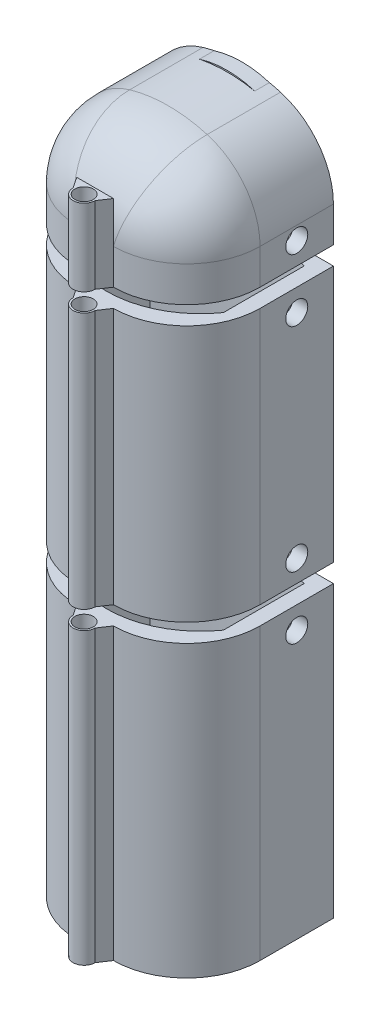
ISO-10303-21;
HEADER;
FILE_DESCRIPTION(('STEP AP214'),'2;1');
FILE_NAME('part.step','',(''),(''),'','','');
FILE_SCHEMA(('AUTOMOTIVE_DESIGN { 1 0 10303 214 1 1 1 1 }'));
ENDSEC;
DATA;
#1=APPLICATION_CONTEXT('core data for automotive mechanical design processes');
#2=APPLICATION_PROTOCOL_DEFINITION('international standard','automotive_design',2000,#1);
#3=PRODUCT_CONTEXT('',#1,'mechanical');
#4=PRODUCT('Part','Part','',(#3));
#5=PRODUCT_RELATED_PRODUCT_CATEGORY('part','',(#4));
#6=PRODUCT_DEFINITION_FORMATION('','',#4);
#7=PRODUCT_DEFINITION_CONTEXT('part definition',#1,'design');
#8=PRODUCT_DEFINITION('design','',#6,#7);
#9=PRODUCT_DEFINITION_SHAPE('','',#8);
#10=(LENGTH_UNIT() NAMED_UNIT(*) SI_UNIT(.MILLI.,.METRE.));
#11=(NAMED_UNIT(*) PLANE_ANGLE_UNIT() SI_UNIT($,.RADIAN.));
#12=(NAMED_UNIT(*) SI_UNIT($,.STERADIAN.) SOLID_ANGLE_UNIT());
#13=UNCERTAINTY_MEASURE_WITH_UNIT(LENGTH_MEASURE(1.E-05),#10,'distance_accuracy_value','');
#14=(GEOMETRIC_REPRESENTATION_CONTEXT(3) GLOBAL_UNCERTAINTY_ASSIGNED_CONTEXT((#13)) GLOBAL_UNIT_ASSIGNED_CONTEXT((#10,
#11,#12)) REPRESENTATION_CONTEXT('',''));
#15=CARTESIAN_POINT('',(0.,0.,0.));
#16=DIRECTION('',(0.,0.,1.));
#17=DIRECTION('',(1.,0.,0.));
#18=AXIS2_PLACEMENT_3D('',#15,#16,#17);
#19=CARTESIAN_POINT('',(-7.66812227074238,42.5,-1.5));
#20=DIRECTION('',(-0.832050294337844,0.,-0.554700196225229));
#21=DIRECTION('',(-0.554700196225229,0.,0.832050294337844));
#22=AXIS2_PLACEMENT_3D('',#19,#20,#21);
#23=PLANE('',#22);
#24=DIRECTION('',(0.554700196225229,0.,-0.832050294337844));
#25=VECTOR('',#24,1.);
#26=CARTESIAN_POINT('',(-7.66812227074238,32.023539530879,-1.5));
#27=LINE('',#26,#25);
#28=CARTESIAN_POINT('',(-8.66812227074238,32.023539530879,0.));
#29=VERTEX_POINT('',#28);
#30=CARTESIAN_POINT('',(-7.66812227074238,32.023539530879,-1.5));
#31=VERTEX_POINT('',#30);
#32=EDGE_CURVE('E12',#29,#31,#27,.T.);
#33=ORIENTED_EDGE('',*,*,#32,.F.);
#34=DIRECTION('',(0.,-1.,0.));
#35=VECTOR('',#34,1.);
#36=CARTESIAN_POINT('',(-8.66812227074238,42.5,0.));
#37=LINE('',#36,#35);
#38=CARTESIAN_POINT('',(-8.66812227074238,42.5,0.));
#39=VERTEX_POINT('',#38);
#40=EDGE_CURVE('E102',#39,#29,#37,.T.);
#41=ORIENTED_EDGE('',*,*,#40,.F.);
#42=DIRECTION('',(0.554700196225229,0.,-0.832050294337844));
#43=VECTOR('',#42,1.);
#44=CARTESIAN_POINT('',(-7.66812227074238,42.5,-1.5));
#45=LINE('',#44,#43);
#46=CARTESIAN_POINT('',(-7.66812227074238,42.5,-1.5));
#47=VERTEX_POINT('',#46);
#48=EDGE_CURVE('E119',#39,#47,#45,.T.);
#49=ORIENTED_EDGE('',*,*,#48,.T.);
#50=DIRECTION('',(0.,-1.,0.));
#51=VECTOR('',#50,1.);
#52=CARTESIAN_POINT('',(-7.66812227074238,42.5,-1.5));
#53=LINE('',#52,#51);
#54=EDGE_CURVE('E116',#47,#31,#53,.T.);
#55=ORIENTED_EDGE('',*,*,#54,.T.);
#56=EDGE_LOOP('',(#33,#41,#49,#55));
#57=FACE_BOUND('',#56,.T.);
#58=ADVANCED_FACE('F52',(#57),#23,.T.);
#59=CARTESIAN_POINT('',(-3.66812227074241,42.5,0.));
#60=DIRECTION('',(0.,0.,1.));
#61=DIRECTION('',(1.,0.,0.));
#62=AXIS2_PLACEMENT_3D('',#59,#60,#61);
#63=PLANE('',#62);
#64=DIRECTION('',(-1.,0.,0.));
#65=VECTOR('',#64,1.);
#66=CARTESIAN_POINT('',(-3.66812227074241,32.023539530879,0.));
#67=LINE('',#66,#65);
#68=CARTESIAN_POINT('',(-3.66812227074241,32.023539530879,0.));
#69=VERTEX_POINT('',#68);
#70=EDGE_CURVE('E62',#69,#29,#67,.T.);
#71=ORIENTED_EDGE('',*,*,#70,.F.);
#72=DIRECTION('',(0.,-1.,0.));
#73=VECTOR('',#72,1.);
#74=CARTESIAN_POINT('',(-3.66812227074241,42.5,0.));
#75=LINE('',#74,#73);
#76=CARTESIAN_POINT('',(-3.66812227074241,42.5,0.));
#77=VERTEX_POINT('',#76);
#78=EDGE_CURVE('E100',#77,#69,#75,.T.);
#79=ORIENTED_EDGE('',*,*,#78,.F.);
#80=DIRECTION('',(-1.,0.,0.));
#81=VECTOR('',#80,1.);
#82=CARTESIAN_POINT('',(-3.66812227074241,42.5,0.));
#83=LINE('',#82,#81);
#84=EDGE_CURVE('E115',#77,#39,#83,.T.);
#85=ORIENTED_EDGE('',*,*,#84,.T.);
#86=ORIENTED_EDGE('',*,*,#40,.T.);
#87=EDGE_LOOP('',(#71,#79,#85,#86));
#88=FACE_BOUND('',#87,.T.);
#89=ADVANCED_FACE('F98',(#88),#63,.T.);
#90=CARTESIAN_POINT('',(-4.66812227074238,42.5,-1.5));
#91=DIRECTION('',(0.832050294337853,0.,-0.554700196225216));
#92=DIRECTION('',(-0.554700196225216,0.,-0.832050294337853));
#93=AXIS2_PLACEMENT_3D('',#90,#91,#92);
#94=PLANE('',#93);
#95=DIRECTION('',(0.554700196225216,0.,0.832050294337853));
#96=VECTOR('',#95,1.);
#97=CARTESIAN_POINT('',(-4.66812227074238,32.023539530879,-1.5));
#98=LINE('',#97,#96);
#99=CARTESIAN_POINT('',(-4.66812227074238,32.023539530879,-1.5));
#100=VERTEX_POINT('',#99);
#101=EDGE_CURVE('E89',#100,#69,#98,.T.);
#102=ORIENTED_EDGE('',*,*,#101,.F.);
#103=DIRECTION('',(0.,-1.,0.));
#104=VECTOR('',#103,1.);
#105=CARTESIAN_POINT('',(-4.66812227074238,42.5,-1.5));
#106=LINE('',#105,#104);
#107=CARTESIAN_POINT('',(-4.66812227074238,42.5,-1.5));
#108=VERTEX_POINT('',#107);
#109=EDGE_CURVE('E110',#108,#100,#106,.T.);
#110=ORIENTED_EDGE('',*,*,#109,.F.);
#111=DIRECTION('',(0.554700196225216,0.,0.832050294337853));
#112=VECTOR('',#111,1.);
#113=CARTESIAN_POINT('',(-4.66812227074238,42.5,-1.5));
#114=LINE('',#113,#112);
#115=EDGE_CURVE('E107',#108,#77,#114,.T.);
#116=ORIENTED_EDGE('',*,*,#115,.T.);
#117=ORIENTED_EDGE('',*,*,#78,.T.);
#118=EDGE_LOOP('',(#102,#110,#116,#117));
#119=FACE_BOUND('',#118,.T.);
#120=ADVANCED_FACE('F105',(#119),#94,.T.);
#121=CARTESIAN_POINT('',(-6.16812227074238,42.5,-1.5));
#122=DIRECTION('',(0.,-1.,0.));
#123=DIRECTION('',(0.,0.,-1.));
#124=AXIS2_PLACEMENT_3D('',#121,#122,#123);
#125=CYLINDRICAL_SURFACE('',#124,1.5);
#126=CARTESIAN_POINT('',(-6.16812227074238,32.023539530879,-1.5));
#127=DIRECTION('',(0.,1.,0.));
#128=DIRECTION('',(0.,0.,1.));
#129=AXIS2_PLACEMENT_3D('',#126,#127,#128);
#130=CIRCLE('',#129,1.5);
#131=EDGE_CURVE('E71',#31,#100,#130,.F.);
#132=ORIENTED_EDGE('',*,*,#131,.F.);
#133=ORIENTED_EDGE('',*,*,#54,.F.);
#134=CARTESIAN_POINT('',(-6.16812227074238,42.5,-1.5));
#135=DIRECTION('',(0.,-1.,0.));
#136=DIRECTION('',(0.,0.,1.));
#137=AXIS2_PLACEMENT_3D('',#134,#135,#136);
#138=CIRCLE('',#137,1.5);
#139=EDGE_CURVE('E108',#47,#108,#138,.T.);
#140=ORIENTED_EDGE('',*,*,#139,.T.);
#141=ORIENTED_EDGE('',*,*,#109,.T.);
#142=EDGE_LOOP('',(#132,#133,#140,#141));
#143=FACE_BOUND('',#142,.T.);
#144=ADVANCED_FACE('F54',(#143),#125,.T.);
#145=CARTESIAN_POINT('',(-6.16812227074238,42.5,-1.5));
#146=DIRECTION('',(0.,1.,0.));
#147=DIRECTION('',(0.,0.,1.));
#148=AXIS2_PLACEMENT_3D('',#145,#146,#147);
#149=PLANE('',#148);
#150=CARTESIAN_POINT('',(-6.16812227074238,42.5,-1.5));
#151=DIRECTION('',(0.,1.,0.));
#152=DIRECTION('',(0.,0.,1.));
#153=AXIS2_PLACEMENT_3D('',#150,#151,#152);
#154=CIRCLE('',#153,1.25);
#155=CARTESIAN_POINT('',(-6.16812227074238,42.5,-0.250000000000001));
#156=VERTEX_POINT('',#155);
#157=EDGE_CURVE('E125',#156,#156,#154,.T.);
#158=ORIENTED_EDGE('',*,*,#157,.F.);
#159=EDGE_LOOP('',(#158));
#160=FACE_BOUND('',#159,.T.);
#161=ORIENTED_EDGE('',*,*,#139,.F.);
#162=ORIENTED_EDGE('',*,*,#48,.F.);
#163=ORIENTED_EDGE('',*,*,#84,.F.);
#164=ORIENTED_EDGE('',*,*,#115,.F.);
#165=EDGE_LOOP('',(#161,#162,#163,#164));
#166=FACE_BOUND('',#165,.T.);
#167=ADVANCED_FACE('F139',(#160,#166),#149,.T.);
#168=CARTESIAN_POINT('',(6.33187772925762,32.023539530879,23.));
#169=DIRECTION('',(0.,1.,0.));
#170=DIRECTION('',(0.,0.,1.));
#171=AXIS2_PLACEMENT_3D('',#168,#169,#170);
#172=PLANE('',#171);
#173=CARTESIAN_POINT('',(-6.16812227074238,32.023539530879,-1.5));
#174=DIRECTION('',(0.,1.,0.));
#175=DIRECTION('',(0.,0.,1.));
#176=AXIS2_PLACEMENT_3D('',#173,#174,#175);
#177=CIRCLE('',#176,1.25);
#178=CARTESIAN_POINT('',(-6.16812227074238,32.023539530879,-0.250000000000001));
#179=VERTEX_POINT('',#178);
#180=EDGE_CURVE('E56',#179,#179,#177,.T.);
#181=ORIENTED_EDGE('',*,*,#180,.T.);
#182=EDGE_LOOP('',(#181));
#183=FACE_BOUND('',#182,.T.);
#184=ORIENTED_EDGE('',*,*,#131,.T.);
#185=ORIENTED_EDGE('',*,*,#101,.T.);
#186=ORIENTED_EDGE('',*,*,#70,.T.);
#187=ORIENTED_EDGE('',*,*,#32,.T.);
#188=EDGE_LOOP('',(#184,#185,#186,#187));
#189=FACE_BOUND('',#188,.T.);
#190=ADVANCED_FACE('F91',(#183,#189),#172,.F.);
#191=CARTESIAN_POINT('',(-6.16812227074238,-47.4999999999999,-1.5));
#192=DIRECTION('',(0.,1.,0.));
#193=DIRECTION('',(0.,0.,1.));
#194=AXIS2_PLACEMENT_3D('',#191,#192,#193);
#195=CYLINDRICAL_SURFACE('',#194,1.25);
#196=CARTESIAN_POINT('',(-6.16812227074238,42.5,-0.250000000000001));
#197=CARTESIAN_POINT('',(-6.16812227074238,42.3908702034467,-0.250000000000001));
#198=CARTESIAN_POINT('',(-6.16812227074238,42.2817404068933,-0.250000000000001));
#199=CARTESIAN_POINT('',(-6.16812227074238,42.0634808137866,-0.250000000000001));
#200=CARTESIAN_POINT('',(-6.16812227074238,41.9543510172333,-0.250000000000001));
#201=CARTESIAN_POINT('',(-6.16812227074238,41.7360914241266,-0.250000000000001));
#202=CARTESIAN_POINT('',(-6.16812227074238,41.6269616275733,-0.250000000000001));
#203=CARTESIAN_POINT('',(-6.16812227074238,41.4087020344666,-0.250000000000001));
#204=CARTESIAN_POINT('',(-6.16812227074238,41.2995722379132,-0.250000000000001));
#205=CARTESIAN_POINT('',(-6.16812227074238,41.0813126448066,-0.250000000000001));
#206=CARTESIAN_POINT('',(-6.16812227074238,40.9721828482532,-0.250000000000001));
#207=CARTESIAN_POINT('',(-6.16812227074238,40.7539232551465,-0.250000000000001));
#208=CARTESIAN_POINT('',(-6.16812227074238,40.6447934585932,-0.250000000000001));
#209=CARTESIAN_POINT('',(-6.16812227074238,40.4265338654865,-0.250000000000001));
#210=CARTESIAN_POINT('',(-6.16812227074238,40.3174040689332,-0.250000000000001));
#211=CARTESIAN_POINT('',(-6.16812227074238,40.0991444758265,-0.250000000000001));
#212=CARTESIAN_POINT('',(-6.16812227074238,39.9900146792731,-0.250000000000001));
#213=CARTESIAN_POINT('',(-6.16812227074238,39.7717550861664,-0.250000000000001));
#214=CARTESIAN_POINT('',(-6.16812227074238,39.6626252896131,-0.250000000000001));
#215=CARTESIAN_POINT('',(-6.16812227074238,39.4443656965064,-0.250000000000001));
#216=CARTESIAN_POINT('',(-6.16812227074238,39.3352358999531,-0.250000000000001));
#217=CARTESIAN_POINT('',(-6.16812227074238,39.1169763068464,-0.250000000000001));
#218=CARTESIAN_POINT('',(-6.16812227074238,39.007846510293,-0.250000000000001));
#219=CARTESIAN_POINT('',(-6.16812227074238,38.7895869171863,-0.250000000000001));
#220=CARTESIAN_POINT('',(-6.16812227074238,38.680457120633,-0.250000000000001));
#221=CARTESIAN_POINT('',(-6.16812227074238,38.4621975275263,-0.250000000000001));
#222=CARTESIAN_POINT('',(-6.16812227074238,38.353067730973,-0.250000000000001));
#223=CARTESIAN_POINT('',(-6.16812227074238,38.1348081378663,-0.250000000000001));
#224=CARTESIAN_POINT('',(-6.16812227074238,38.0256783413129,-0.250000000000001));
#225=CARTESIAN_POINT('',(-6.16812227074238,37.8074187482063,-0.250000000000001));
#226=CARTESIAN_POINT('',(-6.16812227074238,37.6982889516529,-0.250000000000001));
#227=CARTESIAN_POINT('',(-6.16812227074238,37.4800293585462,-0.250000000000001));
#228=CARTESIAN_POINT('',(-6.16812227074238,37.3708995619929,-0.250000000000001));
#229=CARTESIAN_POINT('',(-6.16812227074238,37.1526399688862,-0.250000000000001));
#230=CARTESIAN_POINT('',(-6.16812227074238,37.0435101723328,-0.250000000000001));
#231=CARTESIAN_POINT('',(-6.16812227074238,36.8252505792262,-0.250000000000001));
#232=CARTESIAN_POINT('',(-6.16812227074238,36.7161207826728,-0.250000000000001));
#233=CARTESIAN_POINT('',(-6.16812227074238,36.4978611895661,-0.250000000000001));
#234=CARTESIAN_POINT('',(-6.16812227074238,36.3887313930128,-0.250000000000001));
#235=CARTESIAN_POINT('',(-6.16812227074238,36.1704717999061,-0.250000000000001));
#236=CARTESIAN_POINT('',(-6.16812227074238,36.0613420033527,-0.250000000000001));
#237=CARTESIAN_POINT('',(-6.16812227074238,35.8430824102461,-0.250000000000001));
#238=CARTESIAN_POINT('',(-6.16812227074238,35.7339526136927,-0.250000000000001));
#239=CARTESIAN_POINT('',(-6.16812227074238,35.515693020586,-0.250000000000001));
#240=CARTESIAN_POINT('',(-6.16812227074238,35.4065632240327,-0.250000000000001));
#241=CARTESIAN_POINT('',(-6.16812227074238,35.188303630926,-0.250000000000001));
#242=CARTESIAN_POINT('',(-6.16812227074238,35.0791738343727,-0.250000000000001));
#243=CARTESIAN_POINT('',(-6.16812227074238,34.860914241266,-0.250000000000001));
#244=CARTESIAN_POINT('',(-6.16812227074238,34.7517844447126,-0.250000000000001));
#245=CARTESIAN_POINT('',(-6.16812227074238,34.5335248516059,-0.250000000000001));
#246=CARTESIAN_POINT('',(-6.16812227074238,34.4243950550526,-0.250000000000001));
#247=CARTESIAN_POINT('',(-6.16812227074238,34.2061354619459,-0.250000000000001));
#248=CARTESIAN_POINT('',(-6.16812227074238,34.0970056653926,-0.250000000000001));
#249=CARTESIAN_POINT('',(-6.16812227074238,33.8787460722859,-0.250000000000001));
#250=CARTESIAN_POINT('',(-6.16812227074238,33.7696162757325,-0.250000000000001));
#251=CARTESIAN_POINT('',(-6.16812227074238,33.5513566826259,-0.250000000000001));
#252=CARTESIAN_POINT('',(-6.16812227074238,33.4422268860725,-0.250000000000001));
#253=CARTESIAN_POINT('',(-6.16812227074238,33.2239672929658,-0.250000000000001));
#254=CARTESIAN_POINT('',(-6.16812227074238,33.1148374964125,-0.250000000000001));
#255=CARTESIAN_POINT('',(-6.16812227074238,32.8965779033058,-0.250000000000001));
#256=CARTESIAN_POINT('',(-6.16812227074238,32.7874481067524,-0.250000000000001));
#257=CARTESIAN_POINT('',(-6.16812227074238,32.5691885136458,-0.250000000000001));
#258=CARTESIAN_POINT('',(-6.16812227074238,32.4600587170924,-0.250000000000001));
#259=CARTESIAN_POINT('',(-6.16812227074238,32.2417991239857,-0.250000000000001));
#260=CARTESIAN_POINT('',(-6.16812227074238,32.1326693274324,-0.250000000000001));
#261=CARTESIAN_POINT('',(-6.16812227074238,32.023539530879,-0.250000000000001));
#262=B_SPLINE_CURVE_WITH_KNOTS('',3,(#196,#197,#198,#199,#200,#201,#202,#203,#204,#205,#206,
#207,#208,#209,#210,#211,#212,#213,#214,#215,#216,#217,#218,#219,#220,#221,#222,#223,#224,#225,
#226,#227,#228,#229,#230,#231,#232,#233,#234,#235,#236,#237,#238,#239,#240,#241,#242,#243,#244,
#245,#246,#247,#248,#249,#250,#251,#252,#253,#254,#255,#256,#257,#258,#259,#260,#261),
.UNSPECIFIED.,.F.,.F.,(4,2,2,2,2,2,2,2,2,2,2,2,2,2,2,2,2,2,2,2,2,2,2,2,2,2,2,2,2,2,2,2,4),(0.,
0.327389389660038,0.654778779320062,0.982168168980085,1.30955755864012,1.63694694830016,
1.96433633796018,2.29172572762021,2.61911511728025,2.94650450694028,3.27389389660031,
3.60128328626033,3.92867267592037,4.25606206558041,4.58345145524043,4.91084084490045,
5.23823023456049,5.56561962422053,5.89300901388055,6.22039840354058,6.54778779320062,
6.87517718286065,7.20256657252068,7.5299559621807,7.85734535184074,8.18473474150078,
8.5121241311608,8.83951352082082,9.16690291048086,9.4942923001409,9.82168168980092,
10.1490710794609,10.476460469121),.UNSPECIFIED.);
#263=EDGE_CURVE('BSEAM133',#156,#179,#262,.T.);
#264=ORIENTED_EDGE('',*,*,#157,.T.);
#265=ORIENTED_EDGE('',*,*,#180,.F.);
#266=ORIENTED_EDGE('',*,*,#263,.T.);
#267=ORIENTED_EDGE('',*,*,#263,.F.);
#268=EDGE_LOOP('',(#264,#266,#265,#267));
#269=FACE_BOUND('',#268,.T.);
#270=ADVANCED_FACE('F133',(#269),#195,.F.);
#271=CLOSED_SHELL('',(#58,#89,#120,#144,#167,#190,#270));
#272=MANIFOLD_SOLID_BREP('B2',#271);
#273=CARTESIAN_POINT('',(-6.16812227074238,-47.5,-1.5));
#274=DIRECTION('',(0.,1.,0.));
#275=DIRECTION('',(0.,0.,1.));
#276=AXIS2_PLACEMENT_3D('',#273,#274,#275);
#277=PLANE('',#276);
#278=CARTESIAN_POINT('',(-6.16812227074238,-47.5,-1.5));
#279=DIRECTION('',(0.,-1.,0.));
#280=DIRECTION('',(0.,0.,-1.));
#281=AXIS2_PLACEMENT_3D('',#278,#279,#280);
#282=CIRCLE('',#281,1.25);
#283=CARTESIAN_POINT('',(-6.16812227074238,-47.5,-2.75));
#284=VERTEX_POINT('',#283);
#285=EDGE_CURVE('E282',#284,#284,#282,.T.);
#286=ORIENTED_EDGE('',*,*,#285,.F.);
#287=EDGE_LOOP('',(#286));
#288=FACE_BOUND('',#287,.T.);
#289=CARTESIAN_POINT('',(-6.16812227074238,-47.5,-1.5));
#290=DIRECTION('',(0.,-1.,0.));
#291=DIRECTION('',(0.,0.,1.));
#292=AXIS2_PLACEMENT_3D('',#289,#290,#291);
#293=CIRCLE('',#292,1.5);
#294=CARTESIAN_POINT('',(-7.66812227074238,-47.5,-1.5));
#295=VERTEX_POINT('',#294);
#296=CARTESIAN_POINT('',(-4.66812227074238,-47.5,-1.5));
#297=VERTEX_POINT('',#296);
#298=EDGE_CURVE('E260',#295,#297,#293,.T.);
#299=ORIENTED_EDGE('',*,*,#298,.T.);
#300=DIRECTION('',(0.554700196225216,0.,0.832050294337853));
#301=VECTOR('',#300,1.);
#302=CARTESIAN_POINT('',(-4.66812227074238,-47.5,-1.5));
#303=LINE('',#302,#301);
#304=CARTESIAN_POINT('',(-3.66812227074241,-47.5,0.));
#305=VERTEX_POINT('',#304);
#306=EDGE_CURVE('E276',#297,#305,#303,.T.);
#307=ORIENTED_EDGE('',*,*,#306,.T.);
#308=DIRECTION('',(-1.,0.,0.));
#309=VECTOR('',#308,1.);
#310=CARTESIAN_POINT('',(-3.66812227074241,-47.5,0.));
#311=LINE('',#310,#309);
#312=CARTESIAN_POINT('',(-8.66812227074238,-47.5,0.));
#313=VERTEX_POINT('',#312);
#314=EDGE_CURVE('E272',#305,#313,#311,.T.);
#315=ORIENTED_EDGE('',*,*,#314,.T.);
#316=DIRECTION('',(0.554700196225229,0.,-0.832050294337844));
#317=VECTOR('',#316,1.);
#318=CARTESIAN_POINT('',(-7.66812227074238,-47.5,-1.5));
#319=LINE('',#318,#317);
#320=EDGE_CURVE('E267',#313,#295,#319,.T.);
#321=ORIENTED_EDGE('',*,*,#320,.T.);
#322=EDGE_LOOP('',(#299,#307,#315,#321));
#323=FACE_BOUND('',#322,.T.);
#324=ADVANCED_FACE('F207',(#288,#323),#277,.F.);
#325=CARTESIAN_POINT('',(-4.66812227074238,42.5,-1.5));
#326=DIRECTION('',(0.832050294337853,0.,-0.554700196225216));
#327=DIRECTION('',(-0.554700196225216,0.,-0.832050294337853));
#328=AXIS2_PLACEMENT_3D('',#325,#326,#327);
#329=PLANE('',#328);
#330=DIRECTION('',(-0.554700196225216,0.,-0.832050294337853));
#331=VECTOR('',#330,1.);
#332=CARTESIAN_POINT('',(-4.66812227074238,-7.97646046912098,-1.5));
#333=LINE('',#332,#331);
#334=CARTESIAN_POINT('',(-3.66812227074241,-7.97646046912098,0.));
#335=VERTEX_POINT('',#334);
#336=CARTESIAN_POINT('',(-4.66812227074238,-7.97646046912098,-1.5));
#337=VERTEX_POINT('',#336);
#338=EDGE_CURVE('E50',#335,#337,#333,.T.);
#339=ORIENTED_EDGE('',*,*,#338,.F.);
#340=DIRECTION('',(0.,-1.,0.));
#341=VECTOR('',#340,1.);
#342=CARTESIAN_POINT('',(-3.66812227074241,42.5,0.));
#343=LINE('',#342,#341);
#344=EDGE_CURVE('E264',#335,#305,#343,.T.);
#345=ORIENTED_EDGE('',*,*,#344,.T.);
#346=ORIENTED_EDGE('',*,*,#306,.F.);
#347=DIRECTION('',(0.,-1.,0.));
#348=VECTOR('',#347,1.);
#349=CARTESIAN_POINT('',(-4.66812227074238,42.5,-1.5));
#350=LINE('',#349,#348);
#351=EDGE_CURVE('E249',#337,#297,#350,.T.);
#352=ORIENTED_EDGE('',*,*,#351,.F.);
#353=EDGE_LOOP('',(#339,#345,#346,#352));
#354=FACE_BOUND('',#353,.T.);
#355=ADVANCED_FACE('F299',(#354),#329,.T.);
#356=CARTESIAN_POINT('',(-3.66812227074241,42.5,0.));
#357=DIRECTION('',(0.,0.,1.));
#358=DIRECTION('',(1.,0.,0.));
#359=AXIS2_PLACEMENT_3D('',#356,#357,#358);
#360=PLANE('',#359);
#361=DIRECTION('',(1.,0.,0.));
#362=VECTOR('',#361,1.);
#363=CARTESIAN_POINT('',(-3.66812227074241,-7.97646046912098,0.));
#364=LINE('',#363,#362);
#365=CARTESIAN_POINT('',(-8.66812227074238,-7.97646046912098,0.));
#366=VERTEX_POINT('',#365);
#367=EDGE_CURVE('E216',#366,#335,#364,.T.);
#368=ORIENTED_EDGE('',*,*,#367,.F.);
#369=DIRECTION('',(0.,-1.,0.));
#370=VECTOR('',#369,1.);
#371=CARTESIAN_POINT('',(-8.66812227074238,42.5,0.));
#372=LINE('',#371,#370);
#373=EDGE_CURVE('E257',#366,#313,#372,.T.);
#374=ORIENTED_EDGE('',*,*,#373,.T.);
#375=ORIENTED_EDGE('',*,*,#314,.F.);
#376=ORIENTED_EDGE('',*,*,#344,.F.);
#377=EDGE_LOOP('',(#368,#374,#375,#376));
#378=FACE_BOUND('',#377,.T.);
#379=ADVANCED_FACE('F305',(#378),#360,.T.);
#380=CARTESIAN_POINT('',(-7.66812227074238,42.5,-1.5));
#381=DIRECTION('',(-0.832050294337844,0.,-0.554700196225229));
#382=DIRECTION('',(-0.554700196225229,0.,0.832050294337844));
#383=AXIS2_PLACEMENT_3D('',#380,#381,#382);
#384=PLANE('',#383);
#385=DIRECTION('',(-0.554700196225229,0.,0.832050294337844));
#386=VECTOR('',#385,1.);
#387=CARTESIAN_POINT('',(-7.66812227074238,-7.97646046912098,-1.5));
#388=LINE('',#387,#386);
#389=CARTESIAN_POINT('',(-7.66812227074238,-7.97646046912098,-1.5));
#390=VERTEX_POINT('',#389);
#391=EDGE_CURVE('E247',#390,#366,#388,.T.);
#392=ORIENTED_EDGE('',*,*,#391,.F.);
#393=DIRECTION('',(0.,-1.,0.));
#394=VECTOR('',#393,1.);
#395=CARTESIAN_POINT('',(-7.66812227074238,42.5,-1.5));
#396=LINE('',#395,#394);
#397=EDGE_CURVE('E255',#390,#295,#396,.T.);
#398=ORIENTED_EDGE('',*,*,#397,.T.);
#399=ORIENTED_EDGE('',*,*,#320,.F.);
#400=ORIENTED_EDGE('',*,*,#373,.F.);
#401=EDGE_LOOP('',(#392,#398,#399,#400));
#402=FACE_BOUND('',#401,.T.);
#403=ADVANCED_FACE('F253',(#402),#384,.T.);
#404=CARTESIAN_POINT('',(-6.16812227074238,42.5,-1.5));
#405=DIRECTION('',(0.,-1.,0.));
#406=DIRECTION('',(0.,0.,-1.));
#407=AXIS2_PLACEMENT_3D('',#404,#405,#406);
#408=CYLINDRICAL_SURFACE('',#407,1.5);
#409=CARTESIAN_POINT('',(-6.16812227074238,-7.97646046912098,-1.5));
#410=DIRECTION('',(0.,-1.,0.));
#411=DIRECTION('',(0.,0.,-1.));
#412=AXIS2_PLACEMENT_3D('',#409,#410,#411);
#413=CIRCLE('',#412,1.5);
#414=EDGE_CURVE('E224',#337,#390,#413,.F.);
#415=ORIENTED_EDGE('',*,*,#414,.F.);
#416=ORIENTED_EDGE('',*,*,#351,.T.);
#417=ORIENTED_EDGE('',*,*,#298,.F.);
#418=ORIENTED_EDGE('',*,*,#397,.F.);
#419=EDGE_LOOP('',(#415,#416,#417,#418));
#420=FACE_BOUND('',#419,.T.);
#421=ADVANCED_FACE('F209',(#420),#408,.T.);
#422=CARTESIAN_POINT('',(6.33187772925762,-7.97646046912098,23.));
#423=DIRECTION('',(0.,-1.,0.));
#424=DIRECTION('',(0.,0.,-1.));
#425=AXIS2_PLACEMENT_3D('',#422,#423,#424);
#426=PLANE('',#425);
#427=CARTESIAN_POINT('',(-6.16812227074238,-7.97646046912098,-1.5));
#428=DIRECTION('',(0.,-1.,0.));
#429=DIRECTION('',(0.,0.,-1.));
#430=AXIS2_PLACEMENT_3D('',#427,#428,#429);
#431=CIRCLE('',#430,1.25);
#432=CARTESIAN_POINT('',(-6.16812227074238,-7.97646046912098,-2.75));
#433=VERTEX_POINT('',#432);
#434=EDGE_CURVE('E211',#433,#433,#431,.T.);
#435=ORIENTED_EDGE('',*,*,#434,.T.);
#436=EDGE_LOOP('',(#435));
#437=FACE_BOUND('',#436,.T.);
#438=ORIENTED_EDGE('',*,*,#414,.T.);
#439=ORIENTED_EDGE('',*,*,#391,.T.);
#440=ORIENTED_EDGE('',*,*,#367,.T.);
#441=ORIENTED_EDGE('',*,*,#338,.T.);
#442=EDGE_LOOP('',(#438,#439,#440,#441));
#443=FACE_BOUND('',#442,.T.);
#444=ADVANCED_FACE('F246',(#437,#443),#426,.F.);
#445=CARTESIAN_POINT('',(-6.16812227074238,42.5,-1.5));
#446=DIRECTION('',(0.,-1.,0.));
#447=DIRECTION('',(0.,0.,-1.));
#448=AXIS2_PLACEMENT_3D('',#445,#446,#447);
#449=CYLINDRICAL_SURFACE('',#448,1.25);
#450=CARTESIAN_POINT('',(-6.16812227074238,-47.5,-2.75));
#451=CARTESIAN_POINT('',(-6.16812227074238,-47.08829646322,-2.75));
#452=CARTESIAN_POINT('',(-6.16812227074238,-46.67659292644,-2.75));
#453=CARTESIAN_POINT('',(-6.16812227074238,-45.85318585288,-2.75));
#454=CARTESIAN_POINT('',(-6.16812227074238,-45.4414823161,-2.75));
#455=CARTESIAN_POINT('',(-6.16812227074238,-44.6180752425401,-2.75));
#456=CARTESIAN_POINT('',(-6.16812227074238,-44.2063717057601,-2.75));
#457=CARTESIAN_POINT('',(-6.16812227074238,-43.3829646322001,-2.75));
#458=CARTESIAN_POINT('',(-6.16812227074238,-42.9712610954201,-2.75));
#459=CARTESIAN_POINT('',(-6.16812227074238,-42.1478540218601,-2.75));
#460=CARTESIAN_POINT('',(-6.16812227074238,-41.7361504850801,-2.75));
#461=CARTESIAN_POINT('',(-6.16812227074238,-40.9127434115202,-2.75));
#462=CARTESIAN_POINT('',(-6.16812227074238,-40.5010398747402,-2.75));
#463=CARTESIAN_POINT('',(-6.16812227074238,-39.6776328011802,-2.75));
#464=CARTESIAN_POINT('',(-6.16812227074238,-39.2659292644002,-2.75));
#465=CARTESIAN_POINT('',(-6.16812227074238,-38.4425221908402,-2.75));
#466=CARTESIAN_POINT('',(-6.16812227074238,-38.0308186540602,-2.75));
#467=CARTESIAN_POINT('',(-6.16812227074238,-37.2074115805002,-2.75));
#468=CARTESIAN_POINT('',(-6.16812227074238,-36.7957080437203,-2.75));
#469=CARTESIAN_POINT('',(-6.16812227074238,-35.9723009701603,-2.75));
#470=CARTESIAN_POINT('',(-6.16812227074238,-35.5605974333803,-2.75));
#471=CARTESIAN_POINT('',(-6.16812227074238,-34.7371903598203,-2.75));
#472=CARTESIAN_POINT('',(-6.16812227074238,-34.3254868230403,-2.75));
#473=CARTESIAN_POINT('',(-6.16812227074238,-33.5020797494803,-2.75));
#474=CARTESIAN_POINT('',(-6.16812227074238,-33.0903762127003,-2.75));
#475=CARTESIAN_POINT('',(-6.16812227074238,-32.2669691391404,-2.75));
#476=CARTESIAN_POINT('',(-6.16812227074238,-31.8552656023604,-2.75));
#477=CARTESIAN_POINT('',(-6.16812227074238,-31.0318585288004,-2.75));
#478=CARTESIAN_POINT('',(-6.16812227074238,-30.6201549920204,-2.75));
#479=CARTESIAN_POINT('',(-6.16812227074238,-29.7967479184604,-2.75));
#480=CARTESIAN_POINT('',(-6.16812227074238,-29.3850443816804,-2.75));
#481=CARTESIAN_POINT('',(-6.16812227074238,-28.5616373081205,-2.75));
#482=CARTESIAN_POINT('',(-6.16812227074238,-28.1499337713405,-2.75));
#483=CARTESIAN_POINT('',(-6.16812227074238,-27.3265266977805,-2.75));
#484=CARTESIAN_POINT('',(-6.16812227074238,-26.9148231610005,-2.75));
#485=CARTESIAN_POINT('',(-6.16812227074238,-26.0914160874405,-2.75));
#486=CARTESIAN_POINT('',(-6.16812227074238,-25.6797125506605,-2.75));
#487=CARTESIAN_POINT('',(-6.16812227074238,-24.8563054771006,-2.75));
#488=CARTESIAN_POINT('',(-6.16812227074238,-24.4446019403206,-2.75));
#489=CARTESIAN_POINT('',(-6.16812227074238,-23.6211948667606,-2.75));
#490=CARTESIAN_POINT('',(-6.16812227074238,-23.2094913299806,-2.75));
#491=CARTESIAN_POINT('',(-6.16812227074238,-22.3860842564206,-2.75));
#492=CARTESIAN_POINT('',(-6.16812227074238,-21.9743807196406,-2.75));
#493=CARTESIAN_POINT('',(-6.16812227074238,-21.1509736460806,-2.75));
#494=CARTESIAN_POINT('',(-6.16812227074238,-20.7392701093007,-2.75));
#495=CARTESIAN_POINT('',(-6.16812227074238,-19.9158630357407,-2.75));
#496=CARTESIAN_POINT('',(-6.16812227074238,-19.5041594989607,-2.75));
#497=CARTESIAN_POINT('',(-6.16812227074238,-18.6807524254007,-2.75));
#498=CARTESIAN_POINT('',(-6.16812227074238,-18.2690488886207,-2.75));
#499=CARTESIAN_POINT('',(-6.16812227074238,-17.4456418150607,-2.75));
#500=CARTESIAN_POINT('',(-6.16812227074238,-17.0339382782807,-2.75));
#501=CARTESIAN_POINT('',(-6.16812227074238,-16.2105312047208,-2.75));
#502=CARTESIAN_POINT('',(-6.16812227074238,-15.7988276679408,-2.75));
#503=CARTESIAN_POINT('',(-6.16812227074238,-14.9754205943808,-2.75));
#504=CARTESIAN_POINT('',(-6.16812227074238,-14.5637170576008,-2.75));
#505=CARTESIAN_POINT('',(-6.16812227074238,-13.7403099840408,-2.75));
#506=CARTESIAN_POINT('',(-6.16812227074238,-13.3286064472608,-2.75));
#507=CARTESIAN_POINT('',(-6.16812227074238,-12.5051993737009,-2.75));
#508=CARTESIAN_POINT('',(-6.16812227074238,-12.0934958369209,-2.75));
#509=CARTESIAN_POINT('',(-6.16812227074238,-11.2700887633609,-2.75));
#510=CARTESIAN_POINT('',(-6.16812227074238,-10.8583852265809,-2.75));
#511=CARTESIAN_POINT('',(-6.16812227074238,-10.0349781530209,-2.75));
#512=CARTESIAN_POINT('',(-6.16812227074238,-9.62327461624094,-2.75));
#513=CARTESIAN_POINT('',(-6.16812227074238,-8.79986754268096,-2.75));
#514=CARTESIAN_POINT('',(-6.16812227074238,-8.38816400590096,-2.75));
#515=CARTESIAN_POINT('',(-6.16812227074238,-7.97646046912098,-2.75));
#516=B_SPLINE_CURVE_WITH_KNOTS('',3,(#450,#451,#452,#453,#454,#455,#456,#457,#458,#459,#460,
#461,#462,#463,#464,#465,#466,#467,#468,#469,#470,#471,#472,#473,#474,#475,#476,#477,#478,#479,
#480,#481,#482,#483,#484,#485,#486,#487,#488,#489,#490,#491,#492,#493,#494,#495,#496,#497,#498,
#499,#500,#501,#502,#503,#504,#505,#506,#507,#508,#509,#510,#511,#512,#513,#514,#515),
.UNSPECIFIED.,.F.,.F.,(4,2,2,2,2,2,2,2,2,2,2,2,2,2,2,2,2,2,2,2,2,2,2,2,2,2,2,2,2,2,2,2,4),(0.,
1.23511061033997,2.47022122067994,3.70533183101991,4.94044244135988,6.17555305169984,
7.41066366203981,8.64577427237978,9.88088488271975,11.1159954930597,12.3511061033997,
13.5862167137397,14.8213273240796,16.0564379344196,17.2915485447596,18.5266591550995,
19.7617697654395,20.9968803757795,22.2319909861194,23.4671015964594,24.7022122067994,
25.9373228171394,27.1724334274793,28.4075440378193,29.6426546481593,30.8777652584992,
32.1128758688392,33.3479864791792,34.5830970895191,35.8182076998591,37.0533183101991,
38.288428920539,39.523539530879),.UNSPECIFIED.);
#517=EDGE_CURVE('BSEAM290',#284,#433,#516,.T.);
#518=ORIENTED_EDGE('',*,*,#285,.T.);
#519=ORIENTED_EDGE('',*,*,#434,.F.);
#520=ORIENTED_EDGE('',*,*,#517,.T.);
#521=ORIENTED_EDGE('',*,*,#517,.F.);
#522=EDGE_LOOP('',(#518,#520,#519,#521));
#523=FACE_BOUND('',#522,.T.);
#524=ADVANCED_FACE('F290',(#523),#449,.F.);
#525=CLOSED_SHELL('',(#324,#355,#379,#403,#421,#444,#524));
#526=MANIFOLD_SOLID_BREP('B6',#525);
#527=CARTESIAN_POINT('',(-6.16812227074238,35.,13.));
#528=DIRECTION('',(0.,0.,1.));
#529=DIRECTION('',(1.,0.,0.));
#530=AXIS2_PLACEMENT_3D('',#527,#528,#529);
#531=PLANE('',#530);
#532=CARTESIAN_POINT('',(-6.16812227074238,35.,13.));
#533=DIRECTION('',(0.,0.,-1.));
#534=DIRECTION('',(1.,0.,0.));
#535=AXIS2_PLACEMENT_3D('',#532,#533,#534);
#536=CIRCLE('',#535,10.7935165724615);
#537=CARTESIAN_POINT('',(-16.6681222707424,32.5,13.));
#538=VERTEX_POINT('',#537);
#539=CARTESIAN_POINT('',(-16.6681222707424,37.5,13.));
#540=VERTEX_POINT('',#539);
#541=EDGE_CURVE('E690',#538,#540,#536,.T.);
#542=ORIENTED_EDGE('',*,*,#541,.T.);
#543=DIRECTION('',(0.,-1.,0.));
#544=VECTOR('',#543,1.);
#545=CARTESIAN_POINT('',(-16.6681222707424,40.5,13.));
#546=LINE('',#545,#544);
#547=EDGE_CURVE('E516',#540,#538,#546,.T.);
#548=ORIENTED_EDGE('',*,*,#547,.T.);
#549=EDGE_LOOP('',(#542,#548));
#550=FACE_BOUND('',#549,.T.);
#551=ADVANCED_FACE('F362',(#550),#531,.F.);
#552=CARTESIAN_POINT('',(-6.16812227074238,34.7132673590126,2.));
#553=DIRECTION('',(0.,0.,1.));
#554=DIRECTION('',(1.,0.,0.));
#555=AXIS2_PLACEMENT_3D('',#552,#553,#554);
#556=PLANE('',#555);
#557=CARTESIAN_POINT('',(-6.16812227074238,35.,2.));
#558=DIRECTION('',(0.,0.,1.));
#559=DIRECTION('',(1.,0.,0.));
#560=AXIS2_PLACEMENT_3D('',#557,#558,#559);
#561=CIRCLE('',#560,10.7935165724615);
#562=CARTESIAN_POINT('',(-13.9302096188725,42.4999999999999,2.));
#563=VERTEX_POINT('',#562);
#564=CARTESIAN_POINT('',(1.5939650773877,42.4999999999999,2.));
#565=VERTEX_POINT('',#564);
#566=EDGE_CURVE('E834',#563,#565,#561,.F.);
#567=ORIENTED_EDGE('',*,*,#566,.F.);
#568=DIRECTION('',(1.,0.,0.));
#569=VECTOR('',#568,1.);
#570=CARTESIAN_POINT('',(-6.16812227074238,42.4999999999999,2.));
#571=LINE('',#570,#569);
#572=EDGE_CURVE('E370',#563,#565,#571,.T.);
#573=ORIENTED_EDGE('',*,*,#572,.T.);
#574=EDGE_LOOP('',(#567,#573));
#575=FACE_BOUND('',#574,.T.);
#576=ADVANCED_FACE('F785',(#575),#556,.T.);
#577=CARTESIAN_POINT('',(-4.66812227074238,42.5,21.5));
#578=DIRECTION('',(0.832050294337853,0.,0.554700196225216));
#579=DIRECTION('',(0.554700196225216,0.,-0.832050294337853));
#580=AXIS2_PLACEMENT_3D('',#577,#578,#579);
#581=PLANE('',#580);
#582=DIRECTION('',(-0.554700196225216,0.,0.832050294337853));
#583=VECTOR('',#582,1.);
#584=CARTESIAN_POINT('',(-4.66812227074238,32.023539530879,21.5));
#585=LINE('',#584,#583);
#586=CARTESIAN_POINT('',(-3.66812227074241,32.023539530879,20.));
#587=VERTEX_POINT('',#586);
#588=CARTESIAN_POINT('',(-4.66812227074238,32.023539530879,21.5));
#589=VERTEX_POINT('',#588);
#590=EDGE_CURVE('E685',#587,#589,#585,.T.);
#591=ORIENTED_EDGE('',*,*,#590,.F.);
#592=DIRECTION('',(0.,1.,0.));
#593=VECTOR('',#592,1.);
#594=CARTESIAN_POINT('',(-3.66812227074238,28.2194921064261,20.));
#595=LINE('',#594,#593);
#596=CARTESIAN_POINT('',(-3.66812227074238,36.8429020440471,20.));
#597=VERTEX_POINT('',#596);
#598=EDGE_CURVE('E580',#587,#597,#595,.T.);
#599=ORIENTED_EDGE('',*,*,#598,.T.);
#600=DIRECTION('',(0.,-1.,0.));
#601=VECTOR('',#600,1.);
#602=CARTESIAN_POINT('',(-3.66812227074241,42.5,20.));
#603=LINE('',#602,#601);
#604=CARTESIAN_POINT('',(-3.66812227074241,42.5,20.));
#605=VERTEX_POINT('',#604);
#606=EDGE_CURVE('E590',#605,#597,#603,.T.);
#607=ORIENTED_EDGE('',*,*,#606,.F.);
#608=DIRECTION('',(-0.554700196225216,0.,0.832050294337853));
#609=VECTOR('',#608,1.);
#610=CARTESIAN_POINT('',(-4.66812227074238,42.5,21.5));
#611=LINE('',#610,#609);
#612=CARTESIAN_POINT('',(-4.66812227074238,42.5,21.5));
#613=VERTEX_POINT('',#612);
#614=EDGE_CURVE('E595',#605,#613,#611,.T.);
#615=ORIENTED_EDGE('',*,*,#614,.T.);
#616=DIRECTION('',(0.,-1.,0.));
#617=VECTOR('',#616,1.);
#618=CARTESIAN_POINT('',(-4.66812227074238,42.5,21.5));
#619=LINE('',#618,#617);
#620=EDGE_CURVE('E598',#613,#589,#619,.T.);
#621=ORIENTED_EDGE('',*,*,#620,.T.);
#622=EDGE_LOOP('',(#591,#599,#607,#615,#621));
#623=FACE_BOUND('',#622,.T.);
#624=ADVANCED_FACE('F793',(#623),#581,.T.);
#625=CARTESIAN_POINT('',(-7.66812227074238,42.5,21.5));
#626=DIRECTION('',(-0.832050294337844,0.,0.554700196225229));
#627=DIRECTION('',(0.554700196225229,0.,0.832050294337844));
#628=AXIS2_PLACEMENT_3D('',#625,#626,#627);
#629=PLANE('',#628);
#630=DIRECTION('',(-0.554700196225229,0.,-0.832050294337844));
#631=VECTOR('',#630,1.);
#632=CARTESIAN_POINT('',(-7.66812227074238,32.023539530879,21.5));
#633=LINE('',#632,#631);
#634=CARTESIAN_POINT('',(-7.66812227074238,32.023539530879,21.5));
#635=VERTEX_POINT('',#634);
#636=CARTESIAN_POINT('',(-8.66812227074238,32.023539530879,20.));
#637=VERTEX_POINT('',#636);
#638=EDGE_CURVE('E698',#635,#637,#633,.T.);
#639=ORIENTED_EDGE('',*,*,#638,.F.);
#640=DIRECTION('',(0.,-1.,0.));
#641=VECTOR('',#640,1.);
#642=CARTESIAN_POINT('',(-7.66812227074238,42.5,21.5));
#643=LINE('',#642,#641);
#644=CARTESIAN_POINT('',(-7.66812227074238,42.5,21.5));
#645=VERTEX_POINT('',#644);
#646=EDGE_CURVE('E605',#645,#635,#643,.T.);
#647=ORIENTED_EDGE('',*,*,#646,.F.);
#648=DIRECTION('',(-0.554700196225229,0.,-0.832050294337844));
#649=VECTOR('',#648,1.);
#650=CARTESIAN_POINT('',(-7.66812227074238,42.5,21.5));
#651=LINE('',#650,#649);
#652=CARTESIAN_POINT('',(-8.66812227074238,42.5,20.));
#653=VERTEX_POINT('',#652);
#654=EDGE_CURVE('E589',#645,#653,#651,.T.);
#655=ORIENTED_EDGE('',*,*,#654,.T.);
#656=DIRECTION('',(0.,-1.,0.));
#657=VECTOR('',#656,1.);
#658=CARTESIAN_POINT('',(-8.66812227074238,42.5,20.));
#659=LINE('',#658,#657);
#660=CARTESIAN_POINT('',(-8.66812227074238,36.8429020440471,20.));
#661=VERTEX_POINT('',#660);
#662=EDGE_CURVE('E586',#653,#661,#659,.T.);
#663=ORIENTED_EDGE('',*,*,#662,.T.);
#664=DIRECTION('',(0.,-1.,0.));
#665=VECTOR('',#664,1.);
#666=CARTESIAN_POINT('',(-8.66812227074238,28.2194921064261,20.));
#667=LINE('',#666,#665);
#668=EDGE_CURVE('E585',#661,#637,#667,.T.);
#669=ORIENTED_EDGE('',*,*,#668,.T.);
#670=EDGE_LOOP('',(#639,#647,#655,#663,#669));
#671=FACE_BOUND('',#670,.T.);
#672=ADVANCED_FACE('F895',(#671),#629,.T.);
#673=CARTESIAN_POINT('',(-6.16812227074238,42.5,21.5));
#674=DIRECTION('',(0.,-1.,0.));
#675=DIRECTION('',(0.,0.,-1.));
#676=AXIS2_PLACEMENT_3D('',#673,#674,#675);
#677=CYLINDRICAL_SURFACE('',#676,1.25);
#678=CARTESIAN_POINT('',(-6.16812227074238,32.023539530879,21.5));
#679=DIRECTION('',(0.,1.,0.));
#680=DIRECTION('',(0.,0.,1.));
#681=AXIS2_PLACEMENT_3D('',#678,#679,#680);
#682=CIRCLE('',#681,1.25);
#683=CARTESIAN_POINT('',(-6.16812227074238,32.023539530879,22.75));
#684=VERTEX_POINT('',#683);
#685=EDGE_CURVE('E581',#684,#684,#682,.F.);
#686=ORIENTED_EDGE('',*,*,#685,.T.);
#687=EDGE_LOOP('',(#686));
#688=FACE_BOUND('',#687,.T.);
#689=CARTESIAN_POINT('',(-6.16812227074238,42.5,21.5));
#690=DIRECTION('',(0.,-1.,0.));
#691=DIRECTION('',(0.,0.,-1.));
#692=AXIS2_PLACEMENT_3D('',#689,#690,#691);
#693=CIRCLE('',#692,1.25);
#694=CARTESIAN_POINT('',(-6.16812227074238,42.5,20.25));
#695=VERTEX_POINT('',#694);
#696=EDGE_CURVE('E631',#695,#695,#693,.T.);
#697=ORIENTED_EDGE('',*,*,#696,.F.);
#698=EDGE_LOOP('',(#697));
#699=FACE_BOUND('',#698,.T.);
#700=ADVANCED_FACE('F364',(#688,#699),#677,.F.);
#701=CARTESIAN_POINT('',(-3.66812227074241,42.5,20.));
#702=DIRECTION('',(0.,0.,-1.));
#703=DIRECTION('',(-1.,0.,0.));
#704=AXIS2_PLACEMENT_3D('',#701,#702,#703);
#705=PLANE('',#704);
#706=CARTESIAN_POINT('',(-6.16812227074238,28.2194921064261,20.));
#707=DIRECTION('',(0.,0.,-1.));
#708=DIRECTION('',(-1.,0.,0.));
#709=AXIS2_PLACEMENT_3D('',#706,#707,#708);
#710=CIRCLE('',#709,8.97848533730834);
#711=EDGE_CURVE('E584',#597,#661,#710,.F.);
#712=ORIENTED_EDGE('',*,*,#711,.T.);
#713=ORIENTED_EDGE('',*,*,#662,.F.);
#714=DIRECTION('',(1.,0.,0.));
#715=VECTOR('',#714,1.);
#716=CARTESIAN_POINT('',(-3.66812227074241,42.5,20.));
#717=LINE('',#716,#715);
#718=EDGE_CURVE('E594',#653,#605,#717,.T.);
#719=ORIENTED_EDGE('',*,*,#718,.T.);
#720=ORIENTED_EDGE('',*,*,#606,.T.);
#721=EDGE_LOOP('',(#712,#713,#719,#720));
#722=FACE_BOUND('',#721,.T.);
#723=ADVANCED_FACE('F726',(#722),#705,.T.);
#724=CARTESIAN_POINT('',(-6.16812227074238,42.5,21.5));
#725=DIRECTION('',(0.,-1.,0.));
#726=DIRECTION('',(0.,0.,-1.));
#727=AXIS2_PLACEMENT_3D('',#724,#725,#726);
#728=CYLINDRICAL_SURFACE('',#727,1.5);
#729=ORIENTED_EDGE('',*,*,#646,.T.);
#730=CARTESIAN_POINT('',(-6.16812227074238,32.023539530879,21.5));
#731=DIRECTION('',(0.,1.,0.));
#732=DIRECTION('',(0.,0.,1.));
#733=AXIS2_PLACEMENT_3D('',#730,#731,#732);
#734=CIRCLE('',#733,1.5);
#735=EDGE_CURVE('E696',#589,#635,#734,.F.);
#736=ORIENTED_EDGE('',*,*,#735,.F.);
#737=ORIENTED_EDGE('',*,*,#620,.F.);
#738=CARTESIAN_POINT('',(-6.16812227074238,42.5,21.5));
#739=DIRECTION('',(0.,-1.,0.));
#740=DIRECTION('',(0.,0.,-1.));
#741=AXIS2_PLACEMENT_3D('',#738,#739,#740);
#742=CIRCLE('',#741,1.5);
#743=EDGE_CURVE('E593',#613,#645,#742,.T.);
#744=ORIENTED_EDGE('',*,*,#743,.T.);
#745=EDGE_LOOP('',(#729,#736,#737,#744));
#746=FACE_BOUND('',#745,.T.);
#747=ADVANCED_FACE('F729',(#746),#728,.T.);
#748=CARTESIAN_POINT('',(-6.16812227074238,42.5,21.5));
#749=DIRECTION('',(0.,-1.,0.));
#750=DIRECTION('',(0.,0.,-1.));
#751=AXIS2_PLACEMENT_3D('',#748,#749,#750);
#752=PLANE('',#751);
#753=ORIENTED_EDGE('',*,*,#696,.T.);
#754=EDGE_LOOP('',(#753));
#755=FACE_BOUND('',#754,.T.);
#756=ORIENTED_EDGE('',*,*,#743,.F.);
#757=ORIENTED_EDGE('',*,*,#614,.F.);
#758=ORIENTED_EDGE('',*,*,#718,.F.);
#759=ORIENTED_EDGE('',*,*,#654,.F.);
#760=EDGE_LOOP('',(#756,#757,#758,#759));
#761=FACE_BOUND('',#760,.T.);
#762=ADVANCED_FACE('F731',(#755,#761),#752,.F.);
#763=CARTESIAN_POINT('',(-18.6681222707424,-47.5,20.));
#764=DIRECTION('',(1.,0.,0.));
#765=DIRECTION('',(0.,0.,-1.));
#766=AXIS2_PLACEMENT_3D('',#763,#764,#765);
#767=PLANE('',#766);
#768=CARTESIAN_POINT('',(-18.6681222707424,35.023539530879,5.00000000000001));
#769=DIRECTION('',(1.,0.,0.));
#770=DIRECTION('',(0.,0.,-1.));
#771=AXIS2_PLACEMENT_3D('',#768,#769,#770);
#772=CIRCLE('',#771,1.5);
#773=CARTESIAN_POINT('',(-18.6681222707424,35.023539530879,3.50000000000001));
#774=VERTEX_POINT('',#773);
#775=EDGE_CURVE('E577',#774,#774,#772,.T.);
#776=ORIENTED_EDGE('',*,*,#775,.T.);
#777=EDGE_LOOP('',(#776));
#778=FACE_BOUND('',#777,.T.);
#779=DIRECTION('',(0.,0.,-1.));
#780=VECTOR('',#779,1.);
#781=CARTESIAN_POINT('',(-18.6681222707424,36.8429020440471,20.));
#782=LINE('',#781,#780);
#783=CARTESIAN_POINT('',(-18.6681222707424,36.8429020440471,10.));
#784=VERTEX_POINT('',#783);
#785=CARTESIAN_POINT('',(-18.6681222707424,36.842902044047,0.));
#786=VERTEX_POINT('',#785);
#787=EDGE_CURVE('E624',#784,#786,#782,.T.);
#788=ORIENTED_EDGE('',*,*,#787,.T.);
#789=DIRECTION('',(0.,-1.,0.));
#790=VECTOR('',#789,1.);
#791=CARTESIAN_POINT('',(-18.6681222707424,-47.5,0.));
#792=LINE('',#791,#790);
#793=CARTESIAN_POINT('',(-18.6681222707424,32.023539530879,0.));
#794=VERTEX_POINT('',#793);
#795=EDGE_CURVE('E628',#786,#794,#792,.T.);
#796=ORIENTED_EDGE('',*,*,#795,.T.);
#797=DIRECTION('',(0.,0.,1.));
#798=VECTOR('',#797,1.);
#799=CARTESIAN_POINT('',(-18.6681222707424,32.023539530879,0.));
#800=LINE('',#799,#798);
#801=CARTESIAN_POINT('',(-18.6681222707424,32.023539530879,10.));
#802=VERTEX_POINT('',#801);
#803=EDGE_CURVE('E627',#794,#802,#800,.T.);
#804=ORIENTED_EDGE('',*,*,#803,.T.);
#805=DIRECTION('',(0.,-1.,0.));
#806=VECTOR('',#805,1.);
#807=CARTESIAN_POINT('',(-18.6681222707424,-47.5,10.));
#808=LINE('',#807,#806);
#809=EDGE_CURVE('E625',#802,#784,#808,.F.);
#810=ORIENTED_EDGE('',*,*,#809,.T.);
#811=EDGE_LOOP('',(#788,#796,#804,#810));
#812=FACE_BOUND('',#811,.T.);
#813=ADVANCED_FACE('F734',(#778,#812),#767,.F.);
#814=CARTESIAN_POINT('',(6.33187772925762,-47.5,20.));
#815=DIRECTION('',(-1.,0.,0.));
#816=DIRECTION('',(0.,0.,1.));
#817=AXIS2_PLACEMENT_3D('',#814,#815,#816);
#818=PLANE('',#817);
#819=CARTESIAN_POINT('',(6.33187772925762,35.023539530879,5.00000000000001));
#820=DIRECTION('',(1.,0.,0.));
#821=DIRECTION('',(0.,0.,-1.));
#822=AXIS2_PLACEMENT_3D('',#819,#820,#821);
#823=CIRCLE('',#822,1.5);
#824=CARTESIAN_POINT('',(6.33187772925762,35.023539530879,3.50000000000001));
#825=VERTEX_POINT('',#824);
#826=EDGE_CURVE('E570',#825,#825,#823,.T.);
#827=ORIENTED_EDGE('',*,*,#826,.F.);
#828=EDGE_LOOP('',(#827));
#829=FACE_BOUND('',#828,.T.);
#830=DIRECTION('',(0.,1.,0.));
#831=VECTOR('',#830,1.);
#832=CARTESIAN_POINT('',(6.33187772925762,-47.5,10.));
#833=LINE('',#832,#831);
#834=CARTESIAN_POINT('',(6.33187772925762,36.8429020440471,10.));
#835=VERTEX_POINT('',#834);
#836=CARTESIAN_POINT('',(6.33187772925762,32.023539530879,10.));
#837=VERTEX_POINT('',#836);
#838=EDGE_CURVE('E621',#835,#837,#833,.F.);
#839=ORIENTED_EDGE('',*,*,#838,.T.);
#840=DIRECTION('',(0.,0.,1.));
#841=VECTOR('',#840,1.);
#842=CARTESIAN_POINT('',(6.33187772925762,32.023539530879,0.));
#843=LINE('',#842,#841);
#844=CARTESIAN_POINT('',(6.33187772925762,32.023539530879,0.));
#845=VERTEX_POINT('',#844);
#846=EDGE_CURVE('E613',#845,#837,#843,.T.);
#847=ORIENTED_EDGE('',*,*,#846,.F.);
#848=DIRECTION('',(0.,1.,0.));
#849=VECTOR('',#848,1.);
#850=CARTESIAN_POINT('',(6.33187772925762,-47.5,0.));
#851=LINE('',#850,#849);
#852=CARTESIAN_POINT('',(6.33187772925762,36.842902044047,0.));
#853=VERTEX_POINT('',#852);
#854=EDGE_CURVE('E618',#845,#853,#851,.T.);
#855=ORIENTED_EDGE('',*,*,#854,.T.);
#856=DIRECTION('',(0.,0.,-1.));
#857=VECTOR('',#856,1.);
#858=CARTESIAN_POINT('',(6.33187772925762,36.8429020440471,20.));
#859=LINE('',#858,#857);
#860=EDGE_CURVE('E620',#853,#835,#859,.F.);
#861=ORIENTED_EDGE('',*,*,#860,.T.);
#862=EDGE_LOOP('',(#839,#847,#855,#861));
#863=FACE_BOUND('',#862,.T.);
#864=ADVANCED_FACE('F738',(#829,#863),#818,.F.);
#865=CARTESIAN_POINT('',(-6.16812227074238,28.2194921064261,0.));
#866=DIRECTION('',(0.,0.,-1.));
#867=DIRECTION('',(-1.,0.,0.));
#868=AXIS2_PLACEMENT_3D('',#865,#866,#867);
#869=PLANE('',#868);
#870=CARTESIAN_POINT('',(-3.66812227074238,36.8429020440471,0.));
#871=DIRECTION('',(0.,0.,-1.));
#872=DIRECTION('',(-1.,0.,0.));
#873=AXIS2_PLACEMENT_3D('',#870,#871,#872);
#874=CIRCLE('',#873,10.);
#875=CARTESIAN_POINT('',(-0.883688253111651,46.4474284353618,0.));
#876=VERTEX_POINT('',#875);
#877=EDGE_CURVE('E646',#876,#853,#874,.T.);
#878=ORIENTED_EDGE('',*,*,#877,.T.);
#879=ORIENTED_EDGE('',*,*,#854,.F.);
#880=DIRECTION('',(-1.,0.,0.));
#881=VECTOR('',#880,1.);
#882=CARTESIAN_POINT('',(-18.6681222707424,32.023539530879,0.));
#883=LINE('',#882,#881);
#884=EDGE_CURVE('E632',#845,#794,#883,.T.);
#885=ORIENTED_EDGE('',*,*,#884,.T.);
#886=ORIENTED_EDGE('',*,*,#795,.F.);
#887=CARTESIAN_POINT('',(-8.66812227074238,36.8429020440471,0.));
#888=DIRECTION('',(0.,0.,-1.));
#889=DIRECTION('',(-1.,0.,0.));
#890=AXIS2_PLACEMENT_3D('',#887,#888,#889);
#891=CIRCLE('',#890,10.);
#892=CARTESIAN_POINT('',(-11.4525562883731,46.4474284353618,0.));
#893=VERTEX_POINT('',#892);
#894=EDGE_CURVE('E634',#786,#893,#891,.T.);
#895=ORIENTED_EDGE('',*,*,#894,.T.);
#896=CARTESIAN_POINT('',(-6.16812227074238,28.2194921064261,0.));
#897=DIRECTION('',(0.,0.,1.));
#898=DIRECTION('',(-1.,0.,0.));
#899=AXIS2_PLACEMENT_3D('',#896,#897,#898);
#900=CIRCLE('',#899,18.9784853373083);
#901=CARTESIAN_POINT('',(-9.94011755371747,46.8193565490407,0.));
#902=VERTEX_POINT('',#901);
#903=EDGE_CURVE('E644',#902,#893,#900,.T.);
#904=ORIENTED_EDGE('',*,*,#903,.F.);
#905=CARTESIAN_POINT('',(-6.16812227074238,34.7132673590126,0.));
#906=DIRECTION('',(0.,0.,-1.));
#907=DIRECTION('',(1.,0.,0.));
#908=AXIS2_PLACEMENT_3D('',#905,#906,#907);
#909=CIRCLE('',#908,12.6801160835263);
#910=CARTESIAN_POINT('',(-2.39612698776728,46.8193565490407,0.));
#911=VERTEX_POINT('',#910);
#912=EDGE_CURVE('E551',#902,#911,#909,.T.);
#913=ORIENTED_EDGE('',*,*,#912,.T.);
#914=EDGE_CURVE('E641',#876,#911,#900,.T.);
#915=ORIENTED_EDGE('',*,*,#914,.F.);
#916=EDGE_LOOP('',(#878,#879,#885,#886,#895,#904,#913,#915));
#917=FACE_BOUND('',#916,.T.);
#918=ADVANCED_FACE('F742',(#917),#869,.T.);
#919=CARTESIAN_POINT('',(-3.66812227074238,28.2194921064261,10.));
#920=DIRECTION('',(0.,1.,0.));
#921=DIRECTION('',(0.,0.,1.));
#922=AXIS2_PLACEMENT_3D('',#919,#920,#921);
#923=CYLINDRICAL_SURFACE('',#922,10.);
#924=CARTESIAN_POINT('',(-3.66812227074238,32.023539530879,10.));
#925=DIRECTION('',(0.,1.,0.));
#926=DIRECTION('',(0.,0.,1.));
#927=AXIS2_PLACEMENT_3D('',#924,#925,#926);
#928=CIRCLE('',#927,10.);
#929=EDGE_CURVE('E637',#837,#587,#928,.F.);
#930=ORIENTED_EDGE('',*,*,#929,.F.);
#931=ORIENTED_EDGE('',*,*,#838,.F.);
#932=CARTESIAN_POINT('',(-3.66812227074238,36.8429020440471,10.));
#933=DIRECTION('',(0.,1.,0.));
#934=DIRECTION('',(0.,0.,1.));
#935=AXIS2_PLACEMENT_3D('',#932,#933,#934);
#936=CIRCLE('',#935,10.);
#937=EDGE_CURVE('E666',#597,#835,#936,.T.);
#938=ORIENTED_EDGE('',*,*,#937,.F.);
#939=ORIENTED_EDGE('',*,*,#598,.F.);
#940=EDGE_LOOP('',(#930,#931,#938,#939));
#941=FACE_BOUND('',#940,.T.);
#942=ADVANCED_FACE('F746',(#941),#923,.T.);
#943=CARTESIAN_POINT('',(-8.66812227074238,28.2194921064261,10.));
#944=DIRECTION('',(0.,-1.,0.));
#945=DIRECTION('',(0.,0.,-1.));
#946=AXIS2_PLACEMENT_3D('',#943,#944,#945);
#947=CYLINDRICAL_SURFACE('',#946,10.);
#948=CARTESIAN_POINT('',(-8.66812227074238,32.023539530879,10.));
#949=DIRECTION('',(0.,1.,0.));
#950=DIRECTION('',(0.,0.,1.));
#951=AXIS2_PLACEMENT_3D('',#948,#949,#950);
#952=CIRCLE('',#951,10.);
#953=EDGE_CURVE('E640',#637,#802,#952,.F.);
#954=ORIENTED_EDGE('',*,*,#953,.F.);
#955=ORIENTED_EDGE('',*,*,#668,.F.);
#956=CARTESIAN_POINT('',(-8.66812227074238,36.8429020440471,10.));
#957=DIRECTION('',(0.,-1.,0.));
#958=DIRECTION('',(0.,0.,-1.));
#959=AXIS2_PLACEMENT_3D('',#956,#957,#958);
#960=CIRCLE('',#959,10.);
#961=EDGE_CURVE('E649',#661,#784,#960,.T.);
#962=ORIENTED_EDGE('',*,*,#961,.T.);
#963=ORIENTED_EDGE('',*,*,#809,.F.);
#964=EDGE_LOOP('',(#954,#955,#962,#963));
#965=FACE_BOUND('',#964,.T.);
#966=ADVANCED_FACE('F750',(#965),#947,.T.);
#967=CARTESIAN_POINT('',(-6.16812227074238,28.2194921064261,20.));
#968=DIRECTION('',(0.,0.,-1.));
#969=DIRECTION('',(-1.,0.,0.));
#970=AXIS2_PLACEMENT_3D('',#967,#968,#969);
#971=CYLINDRICAL_SURFACE('',#970,18.9784853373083);
#972=ORIENTED_EDGE('',*,*,#914,.T.);
#973=DIRECTION('',(0.,0.,-1.));
#974=VECTOR('',#973,1.);
#975=CARTESIAN_POINT('',(-2.39612698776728,46.8193565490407,1.));
#976=LINE('',#975,#974);
#977=CARTESIAN_POINT('',(-2.39612698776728,46.8193565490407,2.));
#978=VERTEX_POINT('',#977);
#979=EDGE_CURVE('E568',#911,#978,#976,.F.);
#980=ORIENTED_EDGE('',*,*,#979,.T.);
#981=CARTESIAN_POINT('',(-6.16812227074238,28.2194921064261,2.));
#982=DIRECTION('',(0.,0.,1.));
#983=DIRECTION('',(1.,0.,0.));
#984=AXIS2_PLACEMENT_3D('',#981,#982,#983);
#985=CIRCLE('',#984,18.9784853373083);
#986=CARTESIAN_POINT('',(-9.94011755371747,46.8193565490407,2.));
#987=VERTEX_POINT('',#986);
#988=EDGE_CURVE('E563',#978,#987,#985,.T.);
#989=ORIENTED_EDGE('',*,*,#988,.T.);
#990=DIRECTION('',(0.,0.,-1.));
#991=VECTOR('',#990,1.);
#992=CARTESIAN_POINT('',(-9.94011755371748,46.8193565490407,1.));
#993=LINE('',#992,#991);
#994=EDGE_CURVE('E565',#987,#902,#993,.T.);
#995=ORIENTED_EDGE('',*,*,#994,.T.);
#996=ORIENTED_EDGE('',*,*,#903,.T.);
#997=DIRECTION('',(0.,0.,-1.));
#998=VECTOR('',#997,1.);
#999=CARTESIAN_POINT('',(-11.4525562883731,46.4474284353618,20.));
#1000=LINE('',#999,#998);
#1001=CARTESIAN_POINT('',(-11.4525562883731,46.4474284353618,10.));
#1002=VERTEX_POINT('',#1001);
#1003=EDGE_CURVE('E655',#893,#1002,#1000,.F.);
#1004=ORIENTED_EDGE('',*,*,#1003,.T.);
#1005=CARTESIAN_POINT('',(-6.16812227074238,28.2194921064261,10.));
#1006=DIRECTION('',(0.,0.,-1.));
#1007=DIRECTION('',(-1.,0.,0.));
#1008=AXIS2_PLACEMENT_3D('',#1005,#1006,#1007);
#1009=CIRCLE('',#1008,18.9784853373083);
#1010=CARTESIAN_POINT('',(-0.883688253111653,46.4474284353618,10.));
#1011=VERTEX_POINT('',#1010);
#1012=EDGE_CURVE('E654',#1002,#1011,#1009,.T.);
#1013=ORIENTED_EDGE('',*,*,#1012,.T.);
#1014=DIRECTION('',(0.,0.,-1.));
#1015=VECTOR('',#1014,1.);
#1016=CARTESIAN_POINT('',(-0.883688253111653,46.4474284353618,20.));
#1017=LINE('',#1016,#1015);
#1018=EDGE_CURVE('E652',#1011,#876,#1017,.T.);
#1019=ORIENTED_EDGE('',*,*,#1018,.T.);
#1020=EDGE_LOOP('',(#972,#980,#989,#995,#996,#1004,#1013,#1019));
#1021=FACE_BOUND('',#1020,.T.);
#1022=ADVANCED_FACE('F754',(#1021),#971,.T.);
#1023=CARTESIAN_POINT('',(-8.66812227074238,36.8429020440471,20.));
#1024=DIRECTION('',(0.,0.,-1.));
#1025=DIRECTION('',(-1.,0.,0.));
#1026=AXIS2_PLACEMENT_3D('',#1023,#1024,#1025);
#1027=CYLINDRICAL_SURFACE('',#1026,10.);
#1028=ORIENTED_EDGE('',*,*,#787,.F.);
#1029=CARTESIAN_POINT('',(-8.66812227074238,36.8429020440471,10.));
#1030=DIRECTION('',(0.,0.,-1.));
#1031=DIRECTION('',(-1.,0.,0.));
#1032=AXIS2_PLACEMENT_3D('',#1029,#1030,#1031);
#1033=CIRCLE('',#1032,10.);
#1034=EDGE_CURVE('E643',#784,#1002,#1033,.T.);
#1035=ORIENTED_EDGE('',*,*,#1034,.T.);
#1036=ORIENTED_EDGE('',*,*,#1003,.F.);
#1037=ORIENTED_EDGE('',*,*,#894,.F.);
#1038=EDGE_LOOP('',(#1028,#1035,#1036,#1037));
#1039=FACE_BOUND('',#1038,.T.);
#1040=ADVANCED_FACE('F764',(#1039),#1027,.T.);
#1041=CARTESIAN_POINT('',(-3.66812227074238,36.8429020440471,20.));
#1042=DIRECTION('',(0.,0.,-1.));
#1043=DIRECTION('',(-1.,0.,0.));
#1044=AXIS2_PLACEMENT_3D('',#1041,#1042,#1043);
#1045=CYLINDRICAL_SURFACE('',#1044,10.);
#1046=ORIENTED_EDGE('',*,*,#1018,.F.);
#1047=CARTESIAN_POINT('',(-3.66812227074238,36.8429020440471,10.));
#1048=DIRECTION('',(0.,0.,-1.));
#1049=DIRECTION('',(-1.,0.,0.));
#1050=AXIS2_PLACEMENT_3D('',#1047,#1048,#1049);
#1051=CIRCLE('',#1050,10.);
#1052=EDGE_CURVE('E662',#1011,#835,#1051,.T.);
#1053=ORIENTED_EDGE('',*,*,#1052,.T.);
#1054=ORIENTED_EDGE('',*,*,#860,.F.);
#1055=ORIENTED_EDGE('',*,*,#877,.F.);
#1056=EDGE_LOOP('',(#1046,#1053,#1054,#1055));
#1057=FACE_BOUND('',#1056,.T.);
#1058=ADVANCED_FACE('F768',(#1057),#1045,.T.);
#1059=CARTESIAN_POINT('',(-3.66812227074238,36.8429020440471,10.));
#1060=DIRECTION('',(0.,0.,-1.));
#1061=DIRECTION('',(-1.,0.,0.));
#1062=AXIS2_PLACEMENT_3D('',#1059,#1060,#1061);
#1063=SPHERICAL_SURFACE('',#1062,10.);
#1064=ORIENTED_EDGE('',*,*,#937,.T.);
#1065=ORIENTED_EDGE('',*,*,#1052,.F.);
#1066=CARTESIAN_POINT('',(-3.66812227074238,36.8429020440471,10.));
#1067=DIRECTION('',(-0.960452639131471,0.278443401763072,0.));
#1068=DIRECTION('',(-0.278443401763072,-0.960452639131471,0.));
#1069=AXIS2_PLACEMENT_3D('',#1066,#1067,#1068);
#1070=CIRCLE('',#1069,10.);
#1071=EDGE_CURVE('E671',#597,#1011,#1070,.T.);
#1072=ORIENTED_EDGE('',*,*,#1071,.F.);
#1073=EDGE_LOOP('',(#1064,#1065,#1072));
#1074=FACE_BOUND('',#1073,.T.);
#1075=ADVANCED_FACE('F772',(#1074),#1063,.T.);
#1076=CARTESIAN_POINT('',(-6.16812227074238,28.2194921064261,10.));
#1077=DIRECTION('',(0.,0.,-1.));
#1078=DIRECTION('',(-1.,0.,0.));
#1079=AXIS2_PLACEMENT_3D('',#1076,#1077,#1078);
#1080=DEGENERATE_TOROIDAL_SURFACE('',#1079,8.97848533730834,10.,.T.);
#1081=ORIENTED_EDGE('',*,*,#1071,.T.);
#1082=ORIENTED_EDGE('',*,*,#1012,.F.);
#1083=CARTESIAN_POINT('',(-8.66812227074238,36.8429020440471,10.));
#1084=DIRECTION('',(-0.960452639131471,-0.278443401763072,0.));
#1085=DIRECTION('',(0.278443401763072,-0.960452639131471,0.));
#1086=AXIS2_PLACEMENT_3D('',#1083,#1084,#1085);
#1087=CIRCLE('',#1086,10.);
#1088=EDGE_CURVE('E610',#661,#1002,#1087,.T.);
#1089=ORIENTED_EDGE('',*,*,#1088,.F.);
#1090=ORIENTED_EDGE('',*,*,#711,.F.);
#1091=EDGE_LOOP('',(#1081,#1082,#1089,#1090));
#1092=FACE_BOUND('',#1091,.T.);
#1093=ADVANCED_FACE('F776',(#1092),#1080,.T.);
#1094=CARTESIAN_POINT('',(-8.66812227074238,36.8429020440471,10.));
#1095=DIRECTION('',(0.,0.,-1.));
#1096=DIRECTION('',(-1.,0.,0.));
#1097=AXIS2_PLACEMENT_3D('',#1094,#1095,#1096);
#1098=SPHERICAL_SURFACE('',#1097,10.);
#1099=ORIENTED_EDGE('',*,*,#1088,.T.);
#1100=ORIENTED_EDGE('',*,*,#1034,.F.);
#1101=ORIENTED_EDGE('',*,*,#961,.F.);
#1102=EDGE_LOOP('',(#1099,#1100,#1101));
#1103=FACE_BOUND('',#1102,.T.);
#1104=ADVANCED_FACE('F760',(#1103),#1098,.T.);
#1105=CARTESIAN_POINT('',(-18.6681222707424,32.023539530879,0.));
#1106=DIRECTION('',(0.,1.,0.));
#1107=DIRECTION('',(0.,0.,1.));
#1108=AXIS2_PLACEMENT_3D('',#1105,#1106,#1107);
#1109=PLANE('',#1108);
#1110=DIRECTION('',(0.,0.,1.));
#1111=VECTOR('',#1110,1.);
#1112=CARTESIAN_POINT('',(-16.6681222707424,32.023539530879,0.));
#1113=LINE('',#1112,#1111);
#1114=CARTESIAN_POINT('',(-16.6681222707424,32.023539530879,2.));
#1115=VERTEX_POINT('',#1114);
#1116=CARTESIAN_POINT('',(-16.6681222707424,32.023539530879,13.));
#1117=VERTEX_POINT('',#1116);
#1118=EDGE_CURVE('E606',#1115,#1117,#1113,.T.);
#1119=ORIENTED_EDGE('',*,*,#1118,.T.);
#1120=CARTESIAN_POINT('',(-6.16812227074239,32.023539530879,5.62425043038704));
#1121=DIRECTION('',(0.,1.,0.));
#1122=DIRECTION('',(0.,0.,1.));
#1123=AXIS2_PLACEMENT_3D('',#1120,#1121,#1122);
#1124=CIRCLE('',#1123,12.8316671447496);
#1125=CARTESIAN_POINT('',(4.33187772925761,32.023539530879,13.));
#1126=VERTEX_POINT('',#1125);
#1127=EDGE_CURVE('E534',#1117,#1126,#1124,.T.);
#1128=ORIENTED_EDGE('',*,*,#1127,.T.);
#1129=DIRECTION('',(0.,0.,-1.));
#1130=VECTOR('',#1129,1.);
#1131=CARTESIAN_POINT('',(4.33187772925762,32.023539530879,0.));
#1132=LINE('',#1131,#1130);
#1133=CARTESIAN_POINT('',(4.33187772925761,32.023539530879,2.));
#1134=VERTEX_POINT('',#1133);
#1135=EDGE_CURVE('E609',#1126,#1134,#1132,.T.);
#1136=ORIENTED_EDGE('',*,*,#1135,.T.);
#1137=CARTESIAN_POINT('',(-6.16812227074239,32.023539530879,37.7609391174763));
#1138=DIRECTION('',(0.,1.,0.));
#1139=DIRECTION('',(0.,0.,1.));
#1140=AXIS2_PLACEMENT_3D('',#1137,#1138,#1139);
#1141=CIRCLE('',#1140,37.2705616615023);
#1142=EDGE_CURVE('E546',#1134,#1115,#1141,.T.);
#1143=ORIENTED_EDGE('',*,*,#1142,.T.);
#1144=EDGE_LOOP('',(#1119,#1128,#1136,#1143));
#1145=FACE_BOUND('',#1144,.T.);
#1146=ORIENTED_EDGE('',*,*,#953,.T.);
#1147=ORIENTED_EDGE('',*,*,#803,.F.);
#1148=ORIENTED_EDGE('',*,*,#884,.F.);
#1149=ORIENTED_EDGE('',*,*,#846,.T.);
#1150=ORIENTED_EDGE('',*,*,#929,.T.);
#1151=ORIENTED_EDGE('',*,*,#590,.T.);
#1152=ORIENTED_EDGE('',*,*,#735,.T.);
#1153=ORIENTED_EDGE('',*,*,#638,.T.);
#1154=EDGE_LOOP('',(#1146,#1147,#1148,#1149,#1150,#1151,#1152,#1153));
#1155=FACE_BOUND('',#1154,.T.);
#1156=ORIENTED_EDGE('',*,*,#685,.F.);
#1157=EDGE_LOOP('',(#1156));
#1158=FACE_BOUND('',#1157,.T.);
#1159=ADVANCED_FACE('F756',(#1145,#1155,#1158),#1109,.F.);
#1160=CARTESIAN_POINT('',(-16.6681222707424,32.5,13.));
#1161=DIRECTION('',(-1.,0.,0.));
#1162=DIRECTION('',(0.,-1.,0.));
#1163=AXIS2_PLACEMENT_3D('',#1160,#1161,#1162);
#1164=PLANE('',#1163);
#1165=ORIENTED_EDGE('',*,*,#1118,.F.);
#1166=DIRECTION('',(0.,1.,0.));
#1167=VECTOR('',#1166,1.);
#1168=CARTESIAN_POINT('',(-16.6681222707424,32.5,2.));
#1169=LINE('',#1168,#1167);
#1170=CARTESIAN_POINT('',(-16.6681222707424,32.5,2.));
#1171=VERTEX_POINT('',#1170);
#1172=EDGE_CURVE('E560',#1115,#1171,#1169,.T.);
#1173=ORIENTED_EDGE('',*,*,#1172,.T.);
#1174=DIRECTION('',(0.,0.,-1.));
#1175=VECTOR('',#1174,1.);
#1176=CARTESIAN_POINT('',(-16.6681222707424,32.5,13.));
#1177=LINE('',#1176,#1175);
#1178=EDGE_CURVE('E682',#538,#1171,#1177,.T.);
#1179=ORIENTED_EDGE('',*,*,#1178,.F.);
#1180=DIRECTION('',(0.,1.,0.));
#1181=VECTOR('',#1180,1.);
#1182=CARTESIAN_POINT('',(-16.6681222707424,32.5,13.));
#1183=LINE('',#1182,#1181);
#1184=EDGE_CURVE('E681',#1117,#538,#1183,.T.);
#1185=ORIENTED_EDGE('',*,*,#1184,.F.);
#1186=EDGE_LOOP('',(#1165,#1173,#1179,#1185));
#1187=FACE_BOUND('',#1186,.T.);
#1188=ADVANCED_FACE('F759',(#1187),#1164,.F.);
#1189=CARTESIAN_POINT('',(4.33187772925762,37.5,13.));
#1190=DIRECTION('',(1.,0.,0.));
#1191=DIRECTION('',(0.,1.,0.));
#1192=AXIS2_PLACEMENT_3D('',#1189,#1190,#1191);
#1193=PLANE('',#1192);
#1194=CARTESIAN_POINT('',(4.33187772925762,35.023539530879,5.00000000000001));
#1195=DIRECTION('',(1.,0.,0.));
#1196=DIRECTION('',(0.,1.,0.));
#1197=AXIS2_PLACEMENT_3D('',#1194,#1195,#1196);
#1198=CIRCLE('',#1197,1.5);
#1199=CARTESIAN_POINT('',(4.33187772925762,36.523539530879,5.00000000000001));
#1200=VERTEX_POINT('',#1199);
#1201=EDGE_CURVE('E574',#1200,#1200,#1198,.T.);
#1202=ORIENTED_EDGE('',*,*,#1201,.T.);
#1203=EDGE_LOOP('',(#1202));
#1204=FACE_BOUND('',#1203,.T.);
#1205=DIRECTION('',(0.,0.,-1.));
#1206=VECTOR('',#1205,1.);
#1207=CARTESIAN_POINT('',(4.33187772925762,37.5,13.));
#1208=LINE('',#1207,#1206);
#1209=CARTESIAN_POINT('',(4.33187772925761,37.5,13.));
#1210=VERTEX_POINT('',#1209);
#1211=CARTESIAN_POINT('',(4.33187772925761,37.5,2.));
#1212=VERTEX_POINT('',#1211);
#1213=EDGE_CURVE('E678',#1210,#1212,#1208,.T.);
#1214=ORIENTED_EDGE('',*,*,#1213,.T.);
#1215=DIRECTION('',(0.,-1.,0.));
#1216=VECTOR('',#1215,1.);
#1217=CARTESIAN_POINT('',(4.33187772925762,37.5,2.));
#1218=LINE('',#1217,#1216);
#1219=EDGE_CURVE('E555',#1212,#1134,#1218,.T.);
#1220=ORIENTED_EDGE('',*,*,#1219,.T.);
#1221=ORIENTED_EDGE('',*,*,#1135,.F.);
#1222=DIRECTION('',(0.,-1.,0.));
#1223=VECTOR('',#1222,1.);
#1224=CARTESIAN_POINT('',(4.33187772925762,37.5,13.));
#1225=LINE('',#1224,#1223);
#1226=EDGE_CURVE('E686',#1210,#1126,#1225,.T.);
#1227=ORIENTED_EDGE('',*,*,#1226,.F.);
#1228=EDGE_LOOP('',(#1214,#1220,#1221,#1227));
#1229=FACE_BOUND('',#1228,.T.);
#1230=ADVANCED_FACE('F800',(#1204,#1229),#1193,.F.);
#1231=CARTESIAN_POINT('',(-15.4552100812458,40.5,13.));
#1232=VERTEX_POINT('',#1231);
#1233=CARTESIAN_POINT('',(3.118965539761,40.5,13.));
#1234=VERTEX_POINT('',#1233);
#1235=EDGE_CURVE('E810',#1232,#1234,#536,.T.);
#1236=ORIENTED_EDGE('',*,*,#1235,.T.);
#1237=DIRECTION('',(1.,0.,0.));
#1238=VECTOR('',#1237,1.);
#1239=CARTESIAN_POINT('',(-16.6681222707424,40.5,13.));
#1240=LINE('',#1239,#1238);
#1241=EDGE_CURVE('E531',#1232,#1234,#1240,.T.);
#1242=ORIENTED_EDGE('',*,*,#1241,.F.);
#1243=EDGE_LOOP('',(#1236,#1242));
#1244=FACE_BOUND('',#1243,.T.);
#1245=ADVANCED_FACE('F788',(#1244),#531,.F.);
#1246=CARTESIAN_POINT('',(-6.16812227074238,35.,13.));
#1247=DIRECTION('',(0.,0.,-1.));
#1248=DIRECTION('',(-1.,0.,0.));
#1249=AXIS2_PLACEMENT_3D('',#1246,#1247,#1248);
#1250=CYLINDRICAL_SURFACE('',#1249,10.7935165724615);
#1251=CARTESIAN_POINT('',(-16.9616131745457,35.023539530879,3.50000000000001));
#1252=CARTESIAN_POINT('',(-16.9617946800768,34.9397326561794,3.50000350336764));
#1253=CARTESIAN_POINT('',(-16.9609924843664,34.8558733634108,3.507047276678));
#1254=CARTESIAN_POINT('',(-16.9575182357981,34.6904895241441,3.53503397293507));
#1255=CARTESIAN_POINT('',(-16.9548443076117,34.6089674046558,3.55599083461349));
#1256=CARTESIAN_POINT('',(-16.9479421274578,34.4506758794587,3.61117126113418));
#1257=CARTESIAN_POINT('',(-16.9437149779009,34.3739031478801,3.64538541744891));
#1258=CARTESIAN_POINT('',(-16.9341889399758,34.2272003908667,3.72608746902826));
#1259=CARTESIAN_POINT('',(-16.9288902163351,34.1572693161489,3.77257347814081));
#1260=CARTESIAN_POINT('',(-16.9177846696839,34.0257588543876,3.87682776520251));
#1261=CARTESIAN_POINT('',(-16.9119750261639,33.9642313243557,3.9346611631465));
#1262=CARTESIAN_POINT('',(-16.9005339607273,33.8517207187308,4.05982837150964));
#1263=CARTESIAN_POINT('',(-16.8949025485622,33.800738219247,4.12716270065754));
#1264=CARTESIAN_POINT('',(-16.8844376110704,33.7105572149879,4.26977725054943));
#1265=CARTESIAN_POINT('',(-16.8796076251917,33.6714103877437,4.34509043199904));
#1266=CARTESIAN_POINT('',(-16.8713364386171,33.6063397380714,4.501299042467));
#1267=CARTESIAN_POINT('',(-16.867895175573,33.580415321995,4.58219422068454));
#1268=CARTESIAN_POINT('',(-16.8628212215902,33.5426811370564,4.74674243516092));
#1269=CARTESIAN_POINT('',(-16.8611775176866,33.5307853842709,4.83037540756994));
#1270=CARTESIAN_POINT('',(-16.8598535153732,33.5211802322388,4.99846545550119));
#1271=CARTESIAN_POINT('',(-16.8601731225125,33.5234701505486,5.08292249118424));
#1272=CARTESIAN_POINT('',(-16.862728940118,33.5420997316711,5.24964831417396));
#1273=CARTESIAN_POINT('',(-16.8649519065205,33.5583423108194,5.33192818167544));
#1274=CARTESIAN_POINT('',(-16.8710402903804,33.6042644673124,5.49258357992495));
#1275=CARTESIAN_POINT('',(-16.8749057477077,33.6339443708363,5.57095901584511));
#1276=CARTESIAN_POINT('',(-16.8838529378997,33.7060015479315,5.72187903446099));
#1277=CARTESIAN_POINT('',(-16.8889386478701,33.7484204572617,5.79440349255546));
#1278=CARTESIAN_POINT('',(-16.8997425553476,33.8447224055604,5.93134189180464));
#1279=CARTESIAN_POINT('',(-16.9054607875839,33.8986060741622,5.99575538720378));
#1280=CARTESIAN_POINT('',(-16.9169336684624,34.0168407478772,6.11520279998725));
#1281=CARTESIAN_POINT('',(-16.9226882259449,34.081274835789,6.17015452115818));
#1282=CARTESIAN_POINT('',(-16.9335289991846,34.2184970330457,6.26847574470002));
#1283=CARTESIAN_POINT('',(-16.9386152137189,34.2912851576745,6.31184522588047));
#1284=CARTESIAN_POINT('',(-16.9475359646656,34.4432015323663,6.38576506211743));
#1285=CARTESIAN_POINT('',(-16.9513701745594,34.5223314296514,6.4163120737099));
#1286=CARTESIAN_POINT('',(-16.9573369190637,34.6846619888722,6.46366294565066));
#1287=CARTESIAN_POINT('',(-16.9594695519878,34.7678624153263,6.48046760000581));
#1288=CARTESIAN_POINT('',(-16.9617664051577,34.93524354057,6.4997476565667));
#1289=CARTESIAN_POINT('',(-16.9619465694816,35.019410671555,6.50233903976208));
#1290=CARTESIAN_POINT('',(-16.9603445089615,35.1869746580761,6.49342822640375));
#1291=CARTESIAN_POINT('',(-16.9585623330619,35.2703715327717,6.48192638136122));
#1292=CARTESIAN_POINT('',(-16.9532304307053,35.4337015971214,6.44524954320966));
#1293=CARTESIAN_POINT('',(-16.9496875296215,35.5136468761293,6.42012731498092));
#1294=CARTESIAN_POINT('',(-16.9412146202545,35.6681887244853,6.35698046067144));
#1295=CARTESIAN_POINT('',(-16.9362845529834,35.7427850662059,6.31895528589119));
#1296=CARTESIAN_POINT('',(-16.9255299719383,35.8850469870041,6.23079377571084));
#1297=CARTESIAN_POINT('',(-16.9196998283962,35.9526641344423,6.18057998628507));
#1298=CARTESIAN_POINT('',(-16.9078024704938,36.0785522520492,6.06957535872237));
#1299=CARTESIAN_POINT('',(-16.9017352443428,36.1368227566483,6.00878399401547));
#1300=CARTESIAN_POINT('',(-16.8899859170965,36.2427829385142,5.8778319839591));
#1301=CARTESIAN_POINT('',(-16.8843068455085,36.2903948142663,5.80760807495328));
#1302=CARTESIAN_POINT('',(-16.8740186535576,36.3731455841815,5.66008742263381));
#1303=CARTESIAN_POINT('',(-16.8694095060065,36.4082847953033,5.58279085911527));
#1304=CARTESIAN_POINT('',(-16.8617984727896,36.4649606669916,5.42358062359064));
#1305=CARTESIAN_POINT('',(-16.8587911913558,36.4865430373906,5.34168349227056));
#1306=CARTESIAN_POINT('',(-16.8547051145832,36.5156406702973,5.1753818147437));
#1307=CARTESIAN_POINT('',(-16.8536262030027,36.5231567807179,5.09097741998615));
#1308=CARTESIAN_POINT('',(-16.8535215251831,36.5238904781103,4.92285609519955));
#1309=CARTESIAN_POINT('',(-16.8544776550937,36.5172341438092,4.83913969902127));
#1310=CARTESIAN_POINT('',(-16.8582974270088,36.4900806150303,4.6740291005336));
#1311=CARTESIAN_POINT('',(-16.861161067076,36.4695834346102,4.59263489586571));
#1312=CARTESIAN_POINT('',(-16.8684710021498,36.4153723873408,4.4345056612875));
#1313=CARTESIAN_POINT('',(-16.8729163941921,36.3816660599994,4.35776800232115));
#1314=CARTESIAN_POINT('',(-16.8828963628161,36.3020063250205,4.21101725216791));
#1315=CARTESIAN_POINT('',(-16.8884309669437,36.2560526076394,4.14100433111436));
#1316=CARTESIAN_POINT('',(-16.9000328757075,36.1527410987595,4.00904852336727));
#1317=CARTESIAN_POINT('',(-16.9061043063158,36.0952897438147,3.94717924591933));
#1318=CARTESIAN_POINT('',(-16.918072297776,35.9708118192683,3.83391378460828));
#1319=CARTESIAN_POINT('',(-16.9239688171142,35.9037829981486,3.78252007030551));
#1320=CARTESIAN_POINT('',(-16.9349680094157,35.7616649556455,3.69143908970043));
#1321=CARTESIAN_POINT('',(-16.9400665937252,35.6865373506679,3.65181123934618));
#1322=CARTESIAN_POINT('',(-16.9488675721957,35.5306602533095,3.58579439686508));
#1323=CARTESIAN_POINT('',(-16.9525714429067,35.4499168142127,3.55939139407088));
#1324=CARTESIAN_POINT('',(-16.9572981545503,35.3112450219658,3.52671152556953));
#1325=CARTESIAN_POINT('',(-16.9587984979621,35.2541824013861,3.5167097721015));
#1326=CARTESIAN_POINT('',(-16.9608933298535,35.1392680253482,3.50335283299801));
#1327=CARTESIAN_POINT('',(-16.961487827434,35.0814162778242,3.49999758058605));
#1328=CARTESIAN_POINT('',(-16.9616131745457,35.023539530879,3.50000000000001));
#1329=B_SPLINE_CURVE_WITH_KNOTS('',3,(#1251,#1252,#1253,#1254,#1255,#1256,#1257,#1258,#1259,
#1260,#1261,#1262,#1263,#1264,#1265,#1266,#1267,#1268,#1269,#1270,#1271,#1272,#1273,#1274,#1275,
#1276,#1277,#1278,#1279,#1280,#1281,#1282,#1283,#1284,#1285,#1286,#1287,#1288,#1289,#1290,#1291,
#1292,#1293,#1294,#1295,#1296,#1297,#1298,#1299,#1300,#1301,#1302,#1303,#1304,#1305,#1306,#1307,
#1308,#1309,#1310,#1311,#1312,#1313,#1314,#1315,#1316,#1317,#1318,#1319,#1320,#1321,#1322,#1323,
#1324,#1325,#1326,#1327,#1328),.UNSPECIFIED.,.T.,.F.,(4,2,2,2,2,2,2,2,2,2,2,2,2,2,2,2,2,2,2,2,2,
2,2,2,2,2,2,2,2,2,2,2,2,2,2,2,2,2,4),(0.,0.251209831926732,0.502671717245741,0.753955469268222,
1.00520062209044,1.25793216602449,1.51067751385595,1.76451098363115,2.0183330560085,
2.27059119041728,2.5228371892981,2.77334212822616,3.02385314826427,3.27519200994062,
3.52654467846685,3.77998136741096,4.03341852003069,4.28692171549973,4.54041026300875,
4.79182721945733,5.04323790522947,5.29368152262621,5.54413579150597,5.79622530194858,
6.04832736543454,6.30221361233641,6.55609340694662,6.80911252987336,7.06211640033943,
7.31287894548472,7.56364123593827,7.81426060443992,8.0648863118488,8.31764113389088,
8.57045547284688,8.82452558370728,9.0783259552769,9.25181236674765,9.42529703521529),.UNSPECIFIED.);
#1330=CARTESIAN_POINT('',(-16.9616131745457,35.023539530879,3.50000000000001));
#1331=VERTEX_POINT('',#1330);
#1332=EDGE_CURVE('E573',#1331,#1331,#1329,.T.);
#1333=ORIENTED_EDGE('',*,*,#1332,.T.);
#1334=EDGE_LOOP('',(#1333));
#1335=FACE_BOUND('',#1334,.T.);
#1336=ORIENTED_EDGE('',*,*,#1178,.T.);
#1337=CARTESIAN_POINT('',(-16.6681222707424,37.5,2.));
#1338=VERTEX_POINT('',#1337);
#1339=EDGE_CURVE('E712',#1171,#1338,#561,.F.);
#1340=ORIENTED_EDGE('',*,*,#1339,.T.);
#1341=EDGE_CURVE('E832',#1338,#563,#561,.F.);
#1342=ORIENTED_EDGE('',*,*,#1341,.T.);
#1343=ORIENTED_EDGE('',*,*,#566,.T.);
#1344=EDGE_CURVE('E700',#565,#1212,#561,.F.);
#1345=ORIENTED_EDGE('',*,*,#1344,.T.);
#1346=ORIENTED_EDGE('',*,*,#1213,.F.);
#1347=EDGE_CURVE('E688',#1234,#1210,#536,.T.);
#1348=ORIENTED_EDGE('',*,*,#1347,.F.);
#1349=ORIENTED_EDGE('',*,*,#1235,.F.);
#1350=EDGE_CURVE('E530',#540,#1232,#536,.T.);
#1351=ORIENTED_EDGE('',*,*,#1350,.F.);
#1352=ORIENTED_EDGE('',*,*,#541,.F.);
#1353=EDGE_LOOP('',(#1336,#1340,#1342,#1343,#1345,#1346,#1348,#1349,#1351,#1352));
#1354=FACE_BOUND('',#1353,.T.);
#1355=ADVANCED_FACE('F713',(#1335,#1354),#1250,.F.);
#1356=CARTESIAN_POINT('',(-26.6681222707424,35.023539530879,5.00000000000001));
#1357=DIRECTION('',(1.,0.,0.));
#1358=DIRECTION('',(0.,0.,-1.));
#1359=AXIS2_PLACEMENT_3D('',#1356,#1357,#1358);
#1360=CYLINDRICAL_SURFACE('',#1359,1.5);
#1361=ORIENTED_EDGE('',*,*,#1332,.F.);
#1362=EDGE_LOOP('',(#1361));
#1363=FACE_BOUND('',#1362,.T.);
#1364=ORIENTED_EDGE('',*,*,#775,.F.);
#1365=EDGE_LOOP('',(#1364));
#1366=FACE_BOUND('',#1365,.T.);
#1367=ADVANCED_FACE('F717',(#1363,#1366),#1360,.F.);
#1368=ORIENTED_EDGE('',*,*,#826,.T.);
#1369=EDGE_LOOP('',(#1368));
#1370=FACE_BOUND('',#1369,.T.);
#1371=ORIENTED_EDGE('',*,*,#1201,.F.);
#1372=EDGE_LOOP('',(#1371));
#1373=FACE_BOUND('',#1372,.T.);
#1374=ADVANCED_FACE('F722',(#1370,#1373),#1360,.F.);
#1375=DIRECTION('',(0.,-1.,0.));
#1376=VECTOR('',#1375,1.);
#1377=CARTESIAN_POINT('',(-16.6681222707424,42.4999999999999,2.));
#1378=LINE('',#1377,#1376);
#1379=EDGE_CURVE('E205',#1338,#1171,#1378,.T.);
#1380=ORIENTED_EDGE('',*,*,#1379,.F.);
#1381=ORIENTED_EDGE('',*,*,#1339,.F.);
#1382=EDGE_LOOP('',(#1380,#1381));
#1383=FACE_BOUND('',#1382,.T.);
#1384=ADVANCED_FACE('F795',(#1383),#556,.T.);
#1385=CARTESIAN_POINT('',(-6.16812227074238,34.7132673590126,2.));
#1386=DIRECTION('',(0.,0.,-1.));
#1387=DIRECTION('',(-1.,0.,0.));
#1388=AXIS2_PLACEMENT_3D('',#1385,#1386,#1387);
#1389=CYLINDRICAL_SURFACE('',#1388,12.6801160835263);
#1390=ORIENTED_EDGE('',*,*,#979,.F.);
#1391=ORIENTED_EDGE('',*,*,#912,.F.);
#1392=ORIENTED_EDGE('',*,*,#994,.F.);
#1393=CARTESIAN_POINT('',(-6.16812227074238,34.7132673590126,2.));
#1394=DIRECTION('',(0.,0.,-1.));
#1395=DIRECTION('',(1.,0.,0.));
#1396=AXIS2_PLACEMENT_3D('',#1393,#1394,#1395);
#1397=CIRCLE('',#1396,12.6801160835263);
#1398=EDGE_CURVE('E552',#987,#978,#1397,.T.);
#1399=ORIENTED_EDGE('',*,*,#1398,.T.);
#1400=EDGE_LOOP('',(#1390,#1391,#1392,#1399));
#1401=FACE_BOUND('',#1400,.T.);
#1402=ADVANCED_FACE('F724',(#1401),#1389,.T.);
#1403=ORIENTED_EDGE('',*,*,#988,.F.);
#1404=ORIENTED_EDGE('',*,*,#1398,.F.);
#1405=EDGE_LOOP('',(#1403,#1404));
#1406=FACE_BOUND('',#1405,.T.);
#1407=ADVANCED_FACE('F796',(#1406),#556,.T.);
#1408=CARTESIAN_POINT('',(-16.6681222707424,42.4999999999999,2.));
#1409=DIRECTION('',(0.,0.,1.));
#1410=DIRECTION('',(1.,0.,0.));
#1411=AXIS2_PLACEMENT_3D('',#1408,#1409,#1410);
#1412=PLANE('',#1411);
#1413=DIRECTION('',(0.,-1.,0.));
#1414=VECTOR('',#1413,1.);
#1415=CARTESIAN_POINT('',(-16.6681222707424,42.4999999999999,2.));
#1416=LINE('',#1415,#1414);
#1417=CARTESIAN_POINT('',(-16.6681222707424,42.4999999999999,2.));
#1418=VERTEX_POINT('',#1417);
#1419=EDGE_CURVE('E543',#1418,#1338,#1416,.T.);
#1420=ORIENTED_EDGE('',*,*,#1419,.F.);
#1421=DIRECTION('',(-1.,0.,0.));
#1422=VECTOR('',#1421,1.);
#1423=CARTESIAN_POINT('',(-16.6681222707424,42.4999999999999,2.));
#1424=LINE('',#1423,#1422);
#1425=EDGE_CURVE('E540',#563,#1418,#1424,.T.);
#1426=ORIENTED_EDGE('',*,*,#1425,.F.);
#1427=ORIENTED_EDGE('',*,*,#1341,.F.);
#1428=EDGE_LOOP('',(#1420,#1426,#1427));
#1429=FACE_BOUND('',#1428,.T.);
#1430=ADVANCED_FACE('F840',(#1429),#1412,.F.);
#1431=CARTESIAN_POINT('',(4.33187772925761,42.4999999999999,2.));
#1432=VERTEX_POINT('',#1431);
#1433=EDGE_CURVE('E385',#1432,#565,#1424,.T.);
#1434=ORIENTED_EDGE('',*,*,#1433,.F.);
#1435=DIRECTION('',(0.,-1.,0.));
#1436=VECTOR('',#1435,1.);
#1437=CARTESIAN_POINT('',(4.33187772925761,42.4999999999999,2.));
#1438=LINE('',#1437,#1436);
#1439=EDGE_CURVE('E542',#1432,#1212,#1438,.T.);
#1440=ORIENTED_EDGE('',*,*,#1439,.T.);
#1441=ORIENTED_EDGE('',*,*,#1344,.F.);
#1442=EDGE_LOOP('',(#1434,#1440,#1441));
#1443=FACE_BOUND('',#1442,.T.);
#1444=ADVANCED_FACE('F844',(#1443),#1412,.F.);
#1445=CARTESIAN_POINT('',(-6.16812227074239,42.4999999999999,37.7609391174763));
#1446=DIRECTION('',(0.,-1.,0.));
#1447=DIRECTION('',(0.,0.,-1.));
#1448=AXIS2_PLACEMENT_3D('',#1445,#1446,#1447);
#1449=CYLINDRICAL_SURFACE('',#1448,37.2705616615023);
#1450=ORIENTED_EDGE('',*,*,#1219,.F.);
#1451=ORIENTED_EDGE('',*,*,#1439,.F.);
#1452=CARTESIAN_POINT('',(-6.16812227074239,42.4999999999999,37.7609391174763));
#1453=DIRECTION('',(0.,-1.,0.));
#1454=DIRECTION('',(0.,0.,-1.));
#1455=AXIS2_PLACEMENT_3D('',#1452,#1453,#1454);
#1456=CIRCLE('',#1455,37.2705616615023);
#1457=EDGE_CURVE('E538',#1418,#1432,#1456,.T.);
#1458=ORIENTED_EDGE('',*,*,#1457,.F.);
#1459=ORIENTED_EDGE('',*,*,#1419,.T.);
#1460=ORIENTED_EDGE('',*,*,#1379,.T.);
#1461=ORIENTED_EDGE('',*,*,#1172,.F.);
#1462=ORIENTED_EDGE('',*,*,#1142,.F.);
#1463=EDGE_LOOP('',(#1450,#1451,#1458,#1459,#1460,#1461,#1462));
#1464=FACE_BOUND('',#1463,.T.);
#1465=ADVANCED_FACE('F842',(#1464),#1449,.F.);
#1466=CARTESIAN_POINT('',(-6.16812227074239,42.4999999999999,37.7609391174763));
#1467=DIRECTION('',(0.,-1.,0.));
#1468=DIRECTION('',(0.,0.,-1.));
#1469=AXIS2_PLACEMENT_3D('',#1466,#1467,#1468);
#1470=PLANE('',#1469);
#1471=ORIENTED_EDGE('',*,*,#1457,.T.);
#1472=ORIENTED_EDGE('',*,*,#1433,.T.);
#1473=ORIENTED_EDGE('',*,*,#572,.F.);
#1474=ORIENTED_EDGE('',*,*,#1425,.T.);
#1475=EDGE_LOOP('',(#1471,#1472,#1473,#1474));
#1476=FACE_BOUND('',#1475,.T.);
#1477=ADVANCED_FACE('F836',(#1476),#1470,.T.);
#1478=CARTESIAN_POINT('',(-6.16812227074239,40.5,5.62425043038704));
#1479=DIRECTION('',(0.,-1.,0.));
#1480=DIRECTION('',(0.,0.,-1.));
#1481=AXIS2_PLACEMENT_3D('',#1478,#1479,#1480);
#1482=CYLINDRICAL_SURFACE('',#1481,12.8316671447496);
#1483=ORIENTED_EDGE('',*,*,#1184,.T.);
#1484=ORIENTED_EDGE('',*,*,#547,.F.);
#1485=CARTESIAN_POINT('',(-16.6681222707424,40.5,13.));
#1486=VERTEX_POINT('',#1485);
#1487=EDGE_CURVE('E377',#1486,#540,#546,.T.);
#1488=ORIENTED_EDGE('',*,*,#1487,.F.);
#1489=CARTESIAN_POINT('',(-6.16812227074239,40.5,5.62425043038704));
#1490=DIRECTION('',(0.,-1.,0.));
#1491=DIRECTION('',(0.,0.,1.));
#1492=AXIS2_PLACEMENT_3D('',#1489,#1490,#1491);
#1493=CIRCLE('',#1492,12.8316671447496);
#1494=CARTESIAN_POINT('',(4.33187772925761,40.5,13.));
#1495=VERTEX_POINT('',#1494);
#1496=EDGE_CURVE('E514',#1495,#1486,#1493,.T.);
#1497=ORIENTED_EDGE('',*,*,#1496,.F.);
#1498=DIRECTION('',(0.,-1.,0.));
#1499=VECTOR('',#1498,1.);
#1500=CARTESIAN_POINT('',(4.33187772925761,40.5,13.));
#1501=LINE('',#1500,#1499);
#1502=EDGE_CURVE('E518',#1495,#1210,#1501,.T.);
#1503=ORIENTED_EDGE('',*,*,#1502,.T.);
#1504=ORIENTED_EDGE('',*,*,#1226,.T.);
#1505=ORIENTED_EDGE('',*,*,#1127,.F.);
#1506=EDGE_LOOP('',(#1483,#1484,#1488,#1497,#1503,#1504,#1505));
#1507=FACE_BOUND('',#1506,.T.);
#1508=ADVANCED_FACE('F512',(#1507),#1482,.F.);
#1509=CARTESIAN_POINT('',(-16.6681222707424,40.5,13.));
#1510=DIRECTION('',(0.,0.,-1.));
#1511=DIRECTION('',(-1.,0.,0.));
#1512=AXIS2_PLACEMENT_3D('',#1509,#1510,#1511);
#1513=PLANE('',#1512);
#1514=ORIENTED_EDGE('',*,*,#1502,.F.);
#1515=EDGE_CURVE('E526',#1234,#1495,#1240,.T.);
#1516=ORIENTED_EDGE('',*,*,#1515,.F.);
#1517=ORIENTED_EDGE('',*,*,#1347,.T.);
#1518=EDGE_LOOP('',(#1514,#1516,#1517));
#1519=FACE_BOUND('',#1518,.T.);
#1520=ADVANCED_FACE('F814',(#1519),#1513,.F.);
#1521=EDGE_CURVE('E524',#1486,#1232,#1240,.T.);
#1522=ORIENTED_EDGE('',*,*,#1521,.F.);
#1523=ORIENTED_EDGE('',*,*,#1487,.T.);
#1524=ORIENTED_EDGE('',*,*,#1350,.T.);
#1525=EDGE_LOOP('',(#1522,#1523,#1524));
#1526=FACE_BOUND('',#1525,.T.);
#1527=ADVANCED_FACE('F529',(#1526),#1513,.F.);
#1528=CARTESIAN_POINT('',(-6.16812227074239,40.5,5.62425043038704));
#1529=DIRECTION('',(0.,1.,0.));
#1530=DIRECTION('',(0.,0.,1.));
#1531=AXIS2_PLACEMENT_3D('',#1528,#1529,#1530);
#1532=PLANE('',#1531);
#1533=ORIENTED_EDGE('',*,*,#1496,.T.);
#1534=ORIENTED_EDGE('',*,*,#1521,.T.);
#1535=ORIENTED_EDGE('',*,*,#1241,.T.);
#1536=ORIENTED_EDGE('',*,*,#1515,.T.);
#1537=EDGE_LOOP('',(#1533,#1534,#1535,#1536));
#1538=FACE_BOUND('',#1537,.T.);
#1539=ADVANCED_FACE('F522',(#1538),#1532,.F.);
#1540=CLOSED_SHELL('',(#551,#576,#624,#672,#700,#723,#747,#762,#813,#864,#918,#942,#966,#1022,
#1040,#1058,#1075,#1093,#1104,#1159,#1188,#1230,#1245,#1355,#1367,#1374,#1384,#1402,#1407,#1430,
#1444,#1465,#1477,#1508,#1520,#1527,#1539));
#1541=MANIFOLD_SOLID_BREP('B44',#1540);
#1542=CARTESIAN_POINT('',(4.33187772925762,37.5,13.));
#1543=DIRECTION('',(1.,0.,0.));
#1544=DIRECTION('',(0.,1.,0.));
#1545=AXIS2_PLACEMENT_3D('',#1542,#1543,#1544);
#1546=PLANE('',#1545);
#1547=CARTESIAN_POINT('',(4.33187772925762,-10.976460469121,5.));
#1548=DIRECTION('',(1.,0.,0.));
#1549=DIRECTION('',(0.,1.,0.));
#1550=AXIS2_PLACEMENT_3D('',#1547,#1548,#1549);
#1551=CIRCLE('',#1550,1.5);
#1552=CARTESIAN_POINT('',(4.33187772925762,-9.47646046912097,5.));
#1553=VERTEX_POINT('',#1552);
#1554=EDGE_CURVE('E1352',#1553,#1553,#1551,.T.);
#1555=ORIENTED_EDGE('',*,*,#1554,.T.);
#1556=EDGE_LOOP('',(#1555));
#1557=FACE_BOUND('',#1556,.T.);
#1558=DIRECTION('',(0.,0.,1.));
#1559=VECTOR('',#1558,1.);
#1560=CARTESIAN_POINT('',(4.33187772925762,-7.97646046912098,0.));
#1561=LINE('',#1560,#1559);
#1562=CARTESIAN_POINT('',(4.33187772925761,-7.97646046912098,2.));
#1563=VERTEX_POINT('',#1562);
#1564=CARTESIAN_POINT('',(4.33187772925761,-7.97646046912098,13.));
#1565=VERTEX_POINT('',#1564);
#1566=EDGE_CURVE('E1327',#1563,#1565,#1561,.T.);
#1567=ORIENTED_EDGE('',*,*,#1566,.F.);
#1568=DIRECTION('',(0.,-1.,0.));
#1569=VECTOR('',#1568,1.);
#1570=CARTESIAN_POINT('',(4.33187772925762,37.5,2.));
#1571=LINE('',#1570,#1569);
#1572=CARTESIAN_POINT('',(4.33187772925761,-47.5,2.));
#1573=VERTEX_POINT('',#1572);
#1574=EDGE_CURVE('E1431',#1563,#1573,#1571,.T.);
#1575=ORIENTED_EDGE('',*,*,#1574,.T.);
#1576=DIRECTION('',(0.,0.,-1.));
#1577=VECTOR('',#1576,1.);
#1578=CARTESIAN_POINT('',(4.33187772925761,-47.5,13.));
#1579=LINE('',#1578,#1577);
#1580=CARTESIAN_POINT('',(4.33187772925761,-47.5,13.));
#1581=VERTEX_POINT('',#1580);
#1582=EDGE_CURVE('E1305',#1581,#1573,#1579,.T.);
#1583=ORIENTED_EDGE('',*,*,#1582,.F.);
#1584=DIRECTION('',(0.,-1.,0.));
#1585=VECTOR('',#1584,1.);
#1586=CARTESIAN_POINT('',(4.33187772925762,37.5,13.));
#1587=LINE('',#1586,#1585);
#1588=EDGE_CURVE('E1281',#1565,#1581,#1587,.T.);
#1589=ORIENTED_EDGE('',*,*,#1588,.F.);
#1590=EDGE_LOOP('',(#1567,#1575,#1583,#1589));
#1591=FACE_BOUND('',#1590,.T.);
#1592=ADVANCED_FACE('F1165',(#1557,#1591),#1546,.F.);
#1593=CARTESIAN_POINT('',(-6.16812227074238,28.2194921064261,0.));
#1594=DIRECTION('',(0.,0.,-1.));
#1595=DIRECTION('',(-1.,0.,0.));
#1596=AXIS2_PLACEMENT_3D('',#1593,#1594,#1595);
#1597=PLANE('',#1596);
#1598=DIRECTION('',(0.,1.,0.));
#1599=VECTOR('',#1598,1.);
#1600=CARTESIAN_POINT('',(6.33187772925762,-47.5,0.));
#1601=LINE('',#1600,#1599);
#1602=CARTESIAN_POINT('',(6.33187772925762,-47.5,0.));
#1603=VERTEX_POINT('',#1602);
#1604=CARTESIAN_POINT('',(6.33187772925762,-7.97646046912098,0.));
#1605=VERTEX_POINT('',#1604);
#1606=EDGE_CURVE('E1346',#1603,#1605,#1601,.T.);
#1607=ORIENTED_EDGE('',*,*,#1606,.F.);
#1608=DIRECTION('',(1.,0.,0.));
#1609=VECTOR('',#1608,1.);
#1610=CARTESIAN_POINT('',(-18.6681222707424,-47.5,0.));
#1611=LINE('',#1610,#1609);
#1612=CARTESIAN_POINT('',(-18.6681222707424,-47.5,0.));
#1613=VERTEX_POINT('',#1612);
#1614=EDGE_CURVE('E1324',#1613,#1603,#1611,.T.);
#1615=ORIENTED_EDGE('',*,*,#1614,.F.);
#1616=DIRECTION('',(0.,-1.,0.));
#1617=VECTOR('',#1616,1.);
#1618=CARTESIAN_POINT('',(-18.6681222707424,-47.5,0.));
#1619=LINE('',#1618,#1617);
#1620=CARTESIAN_POINT('',(-18.6681222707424,-7.97646046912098,0.));
#1621=VERTEX_POINT('',#1620);
#1622=EDGE_CURVE('E1298',#1621,#1613,#1619,.T.);
#1623=ORIENTED_EDGE('',*,*,#1622,.F.);
#1624=DIRECTION('',(1.,0.,0.));
#1625=VECTOR('',#1624,1.);
#1626=CARTESIAN_POINT('',(6.33187772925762,-7.97646046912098,0.));
#1627=LINE('',#1626,#1625);
#1628=EDGE_CURVE('E1254',#1621,#1605,#1627,.T.);
#1629=ORIENTED_EDGE('',*,*,#1628,.T.);
#1630=EDGE_LOOP('',(#1607,#1615,#1623,#1629));
#1631=FACE_BOUND('',#1630,.T.);
#1632=ADVANCED_FACE('F1376',(#1631),#1597,.T.);
#1633=CARTESIAN_POINT('',(6.33187772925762,-47.5,20.));
#1634=DIRECTION('',(-1.,0.,0.));
#1635=DIRECTION('',(0.,0.,1.));
#1636=AXIS2_PLACEMENT_3D('',#1633,#1634,#1635);
#1637=PLANE('',#1636);
#1638=CARTESIAN_POINT('',(6.33187772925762,-10.976460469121,5.));
#1639=DIRECTION('',(1.,0.,0.));
#1640=DIRECTION('',(0.,0.,-1.));
#1641=AXIS2_PLACEMENT_3D('',#1638,#1639,#1640);
#1642=CIRCLE('',#1641,1.5);
#1643=CARTESIAN_POINT('',(6.33187772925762,-10.976460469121,3.5));
#1644=VERTEX_POINT('',#1643);
#1645=EDGE_CURVE('E1428',#1644,#1644,#1642,.T.);
#1646=ORIENTED_EDGE('',*,*,#1645,.F.);
#1647=EDGE_LOOP('',(#1646));
#1648=FACE_BOUND('',#1647,.T.);
#1649=DIRECTION('',(0.,0.,-1.));
#1650=VECTOR('',#1649,1.);
#1651=CARTESIAN_POINT('',(6.33187772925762,-47.5,20.));
#1652=LINE('',#1651,#1650);
#1653=CARTESIAN_POINT('',(6.33187772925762,-47.5,10.));
#1654=VERTEX_POINT('',#1653);
#1655=EDGE_CURVE('E1235',#1654,#1603,#1652,.T.);
#1656=ORIENTED_EDGE('',*,*,#1655,.T.);
#1657=ORIENTED_EDGE('',*,*,#1606,.T.);
#1658=DIRECTION('',(0.,0.,1.));
#1659=VECTOR('',#1658,1.);
#1660=CARTESIAN_POINT('',(6.33187772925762,-7.97646046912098,0.));
#1661=LINE('',#1660,#1659);
#1662=CARTESIAN_POINT('',(6.33187772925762,-7.97646046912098,10.));
#1663=VERTEX_POINT('',#1662);
#1664=EDGE_CURVE('E1344',#1605,#1663,#1661,.T.);
#1665=ORIENTED_EDGE('',*,*,#1664,.T.);
#1666=DIRECTION('',(0.,1.,0.));
#1667=VECTOR('',#1666,1.);
#1668=CARTESIAN_POINT('',(6.33187772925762,-47.5,10.));
#1669=LINE('',#1668,#1667);
#1670=EDGE_CURVE('E1343',#1663,#1654,#1669,.F.);
#1671=ORIENTED_EDGE('',*,*,#1670,.T.);
#1672=EDGE_LOOP('',(#1656,#1657,#1665,#1671));
#1673=FACE_BOUND('',#1672,.T.);
#1674=ADVANCED_FACE('F1399',(#1648,#1673),#1637,.F.);
#1675=CARTESIAN_POINT('',(-18.6681222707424,-47.5,20.));
#1676=DIRECTION('',(1.,0.,0.));
#1677=DIRECTION('',(0.,0.,-1.));
#1678=AXIS2_PLACEMENT_3D('',#1675,#1676,#1677);
#1679=PLANE('',#1678);
#1680=CARTESIAN_POINT('',(-18.6681222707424,-10.976460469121,5.));
#1681=DIRECTION('',(1.,0.,0.));
#1682=DIRECTION('',(0.,0.,-1.));
#1683=AXIS2_PLACEMENT_3D('',#1680,#1681,#1682);
#1684=CIRCLE('',#1683,1.5);
#1685=CARTESIAN_POINT('',(-18.6681222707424,-10.976460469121,3.5));
#1686=VERTEX_POINT('',#1685);
#1687=EDGE_CURVE('E1425',#1686,#1686,#1684,.T.);
#1688=ORIENTED_EDGE('',*,*,#1687,.T.);
#1689=EDGE_LOOP('',(#1688));
#1690=FACE_BOUND('',#1689,.T.);
#1691=DIRECTION('',(0.,-1.,0.));
#1692=VECTOR('',#1691,1.);
#1693=CARTESIAN_POINT('',(-18.6681222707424,-47.5,10.));
#1694=LINE('',#1693,#1692);
#1695=CARTESIAN_POINT('',(-18.6681222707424,-47.5,10.));
#1696=VERTEX_POINT('',#1695);
#1697=CARTESIAN_POINT('',(-18.6681222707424,-7.97646046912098,10.));
#1698=VERTEX_POINT('',#1697);
#1699=EDGE_CURVE('E1302',#1696,#1698,#1694,.F.);
#1700=ORIENTED_EDGE('',*,*,#1699,.T.);
#1701=DIRECTION('',(0.,0.,1.));
#1702=VECTOR('',#1701,1.);
#1703=CARTESIAN_POINT('',(-18.6681222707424,-7.97646046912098,0.));
#1704=LINE('',#1703,#1702);
#1705=EDGE_CURVE('E1248',#1621,#1698,#1704,.T.);
#1706=ORIENTED_EDGE('',*,*,#1705,.F.);
#1707=ORIENTED_EDGE('',*,*,#1622,.T.);
#1708=DIRECTION('',(0.,0.,-1.));
#1709=VECTOR('',#1708,1.);
#1710=CARTESIAN_POINT('',(-18.6681222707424,-47.5,20.));
#1711=LINE('',#1710,#1709);
#1712=EDGE_CURVE('E1356',#1696,#1613,#1711,.T.);
#1713=ORIENTED_EDGE('',*,*,#1712,.F.);
#1714=EDGE_LOOP('',(#1700,#1706,#1707,#1713));
#1715=FACE_BOUND('',#1714,.T.);
#1716=ADVANCED_FACE('F1371',(#1690,#1715),#1679,.F.);
#1717=CARTESIAN_POINT('',(-16.6681222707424,32.5,13.));
#1718=DIRECTION('',(-1.,0.,0.));
#1719=DIRECTION('',(0.,-1.,0.));
#1720=AXIS2_PLACEMENT_3D('',#1717,#1718,#1719);
#1721=PLANE('',#1720);
#1722=CARTESIAN_POINT('',(-16.6681222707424,-10.976460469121,5.));
#1723=DIRECTION('',(-1.,0.,0.));
#1724=DIRECTION('',(0.,-1.,0.));
#1725=AXIS2_PLACEMENT_3D('',#1722,#1723,#1724);
#1726=CIRCLE('',#1725,1.5);
#1727=CARTESIAN_POINT('',(-16.6681222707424,-12.476460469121,5.));
#1728=VERTEX_POINT('',#1727);
#1729=EDGE_CURVE('E1169',#1728,#1728,#1726,.T.);
#1730=ORIENTED_EDGE('',*,*,#1729,.T.);
#1731=EDGE_LOOP('',(#1730));
#1732=FACE_BOUND('',#1731,.T.);
#1733=DIRECTION('',(0.,0.,-1.));
#1734=VECTOR('',#1733,1.);
#1735=CARTESIAN_POINT('',(-16.6681222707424,-47.5,13.));
#1736=LINE('',#1735,#1734);
#1737=CARTESIAN_POINT('',(-16.6681222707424,-47.5,13.));
#1738=VERTEX_POINT('',#1737);
#1739=CARTESIAN_POINT('',(-16.6681222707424,-47.5,2.));
#1740=VERTEX_POINT('',#1739);
#1741=EDGE_CURVE('E1293',#1738,#1740,#1736,.T.);
#1742=ORIENTED_EDGE('',*,*,#1741,.T.);
#1743=DIRECTION('',(0.,1.,0.));
#1744=VECTOR('',#1743,1.);
#1745=CARTESIAN_POINT('',(-16.6681222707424,32.5,2.));
#1746=LINE('',#1745,#1744);
#1747=CARTESIAN_POINT('',(-16.6681222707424,-7.97646046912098,2.));
#1748=VERTEX_POINT('',#1747);
#1749=EDGE_CURVE('E1433',#1740,#1748,#1746,.T.);
#1750=ORIENTED_EDGE('',*,*,#1749,.T.);
#1751=DIRECTION('',(0.,0.,-1.));
#1752=VECTOR('',#1751,1.);
#1753=CARTESIAN_POINT('',(-16.6681222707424,-7.97646046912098,0.));
#1754=LINE('',#1753,#1752);
#1755=CARTESIAN_POINT('',(-16.6681222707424,-7.97646046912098,13.));
#1756=VERTEX_POINT('',#1755);
#1757=EDGE_CURVE('E1295',#1756,#1748,#1754,.T.);
#1758=ORIENTED_EDGE('',*,*,#1757,.F.);
#1759=DIRECTION('',(0.,1.,0.));
#1760=VECTOR('',#1759,1.);
#1761=CARTESIAN_POINT('',(-16.6681222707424,32.5,13.));
#1762=LINE('',#1761,#1760);
#1763=EDGE_CURVE('E1278',#1738,#1756,#1762,.T.);
#1764=ORIENTED_EDGE('',*,*,#1763,.F.);
#1765=EDGE_LOOP('',(#1742,#1750,#1758,#1764));
#1766=FACE_BOUND('',#1765,.T.);
#1767=ADVANCED_FACE('F1291',(#1732,#1766),#1721,.F.);
#1768=CARTESIAN_POINT('',(-3.66812227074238,28.2194921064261,10.));
#1769=DIRECTION('',(0.,1.,0.));
#1770=DIRECTION('',(0.,0.,1.));
#1771=AXIS2_PLACEMENT_3D('',#1768,#1769,#1770);
#1772=CYLINDRICAL_SURFACE('',#1771,10.);
#1773=CARTESIAN_POINT('',(-3.66812227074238,-7.97646046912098,10.));
#1774=DIRECTION('',(0.,-1.,0.));
#1775=DIRECTION('',(1.,0.,0.));
#1776=AXIS2_PLACEMENT_3D('',#1773,#1774,#1775);
#1777=CIRCLE('',#1776,10.);
#1778=CARTESIAN_POINT('',(-3.66812227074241,-7.97646046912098,20.));
#1779=VERTEX_POINT('',#1778);
#1780=EDGE_CURVE('E1332',#1779,#1663,#1777,.F.);
#1781=ORIENTED_EDGE('',*,*,#1780,.F.);
#1782=DIRECTION('',(0.,1.,0.));
#1783=VECTOR('',#1782,1.);
#1784=CARTESIAN_POINT('',(-3.66812227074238,28.2194921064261,20.));
#1785=LINE('',#1784,#1783);
#1786=CARTESIAN_POINT('',(-3.66812227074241,-47.5,20.));
#1787=VERTEX_POINT('',#1786);
#1788=EDGE_CURVE('E1326',#1787,#1779,#1785,.T.);
#1789=ORIENTED_EDGE('',*,*,#1788,.F.);
#1790=CARTESIAN_POINT('',(-3.66812227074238,-47.5,10.));
#1791=DIRECTION('',(0.,1.,0.));
#1792=DIRECTION('',(0.,0.,1.));
#1793=AXIS2_PLACEMENT_3D('',#1790,#1791,#1792);
#1794=CIRCLE('',#1793,10.);
#1795=EDGE_CURVE('E1312',#1654,#1787,#1794,.F.);
#1796=ORIENTED_EDGE('',*,*,#1795,.F.);
#1797=ORIENTED_EDGE('',*,*,#1670,.F.);
#1798=EDGE_LOOP('',(#1781,#1789,#1796,#1797));
#1799=FACE_BOUND('',#1798,.T.);
#1800=ADVANCED_FACE('F1382',(#1799),#1772,.T.);
#1801=CARTESIAN_POINT('',(6.33187772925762,-7.97646046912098,0.));
#1802=DIRECTION('',(0.,-1.,0.));
#1803=DIRECTION('',(1.,0.,0.));
#1804=AXIS2_PLACEMENT_3D('',#1801,#1802,#1803);
#1805=PLANE('',#1804);
#1806=ORIENTED_EDGE('',*,*,#1566,.T.);
#1807=CARTESIAN_POINT('',(-6.16812227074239,-7.97646046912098,5.62425043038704));
#1808=DIRECTION('',(0.,-1.,0.));
#1809=DIRECTION('',(1.,0.,0.));
#1810=AXIS2_PLACEMENT_3D('',#1807,#1808,#1809);
#1811=CIRCLE('',#1810,12.8316671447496);
#1812=EDGE_CURVE('E1286',#1565,#1756,#1811,.T.);
#1813=ORIENTED_EDGE('',*,*,#1812,.T.);
#1814=ORIENTED_EDGE('',*,*,#1757,.T.);
#1815=CARTESIAN_POINT('',(-6.16812227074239,-7.97646046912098,37.7609391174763));
#1816=DIRECTION('',(0.,-1.,0.));
#1817=DIRECTION('',(1.,0.,0.));
#1818=AXIS2_PLACEMENT_3D('',#1815,#1816,#1817);
#1819=CIRCLE('',#1818,37.2705616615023);
#1820=EDGE_CURVE('E1435',#1748,#1563,#1819,.T.);
#1821=ORIENTED_EDGE('',*,*,#1820,.T.);
#1822=EDGE_LOOP('',(#1806,#1813,#1814,#1821));
#1823=FACE_BOUND('',#1822,.T.);
#1824=ORIENTED_EDGE('',*,*,#1780,.T.);
#1825=ORIENTED_EDGE('',*,*,#1664,.F.);
#1826=ORIENTED_EDGE('',*,*,#1628,.F.);
#1827=ORIENTED_EDGE('',*,*,#1705,.T.);
#1828=CARTESIAN_POINT('',(-8.66812227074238,-7.97646046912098,10.));
#1829=DIRECTION('',(0.,-1.,0.));
#1830=DIRECTION('',(1.,0.,0.));
#1831=AXIS2_PLACEMENT_3D('',#1828,#1829,#1830);
#1832=CIRCLE('',#1831,10.);
#1833=CARTESIAN_POINT('',(-8.66812227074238,-7.97646046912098,20.));
#1834=VERTEX_POINT('',#1833);
#1835=EDGE_CURVE('E1337',#1698,#1834,#1832,.F.);
#1836=ORIENTED_EDGE('',*,*,#1835,.T.);
#1837=DIRECTION('',(0.554700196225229,0.,0.832050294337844));
#1838=VECTOR('',#1837,1.);
#1839=CARTESIAN_POINT('',(-7.66812227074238,-7.97646046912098,21.5));
#1840=LINE('',#1839,#1838);
#1841=CARTESIAN_POINT('',(-7.66812227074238,-7.97646046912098,21.5));
#1842=VERTEX_POINT('',#1841);
#1843=EDGE_CURVE('E1200',#1834,#1842,#1840,.T.);
#1844=ORIENTED_EDGE('',*,*,#1843,.T.);
#1845=CARTESIAN_POINT('',(-6.16812227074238,-7.97646046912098,21.5));
#1846=DIRECTION('',(0.,-1.,0.));
#1847=DIRECTION('',(0.,0.,-1.));
#1848=AXIS2_PLACEMENT_3D('',#1845,#1846,#1847);
#1849=CIRCLE('',#1848,1.5);
#1850=CARTESIAN_POINT('',(-4.66812227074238,-7.97646046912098,21.5));
#1851=VERTEX_POINT('',#1850);
#1852=EDGE_CURVE('E1174',#1842,#1851,#1849,.F.);
#1853=ORIENTED_EDGE('',*,*,#1852,.T.);
#1854=DIRECTION('',(0.554700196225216,0.,-0.832050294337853));
#1855=VECTOR('',#1854,1.);
#1856=CARTESIAN_POINT('',(-4.66812227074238,-7.97646046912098,21.5));
#1857=LINE('',#1856,#1855);
#1858=EDGE_CURVE('E360',#1851,#1779,#1857,.T.);
#1859=ORIENTED_EDGE('',*,*,#1858,.T.);
#1860=EDGE_LOOP('',(#1824,#1825,#1826,#1827,#1836,#1844,#1853,#1859));
#1861=FACE_BOUND('',#1860,.T.);
#1862=CARTESIAN_POINT('',(-6.16812227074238,-7.97646046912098,21.5));
#1863=DIRECTION('',(0.,-1.,0.));
#1864=DIRECTION('',(0.,0.,-1.));
#1865=AXIS2_PLACEMENT_3D('',#1862,#1863,#1864);
#1866=CIRCLE('',#1865,1.25);
#1867=CARTESIAN_POINT('',(-6.16812227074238,-7.97646046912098,20.25));
#1868=VERTEX_POINT('',#1867);
#1869=EDGE_CURVE('E1320',#1868,#1868,#1866,.F.);
#1870=ORIENTED_EDGE('',*,*,#1869,.F.);
#1871=EDGE_LOOP('',(#1870));
#1872=FACE_BOUND('',#1871,.T.);
#1873=ADVANCED_FACE('F1361',(#1823,#1861,#1872),#1805,.F.);
#1874=CARTESIAN_POINT('',(-8.66812227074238,28.2194921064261,10.));
#1875=DIRECTION('',(0.,-1.,0.));
#1876=DIRECTION('',(0.,0.,-1.));
#1877=AXIS2_PLACEMENT_3D('',#1874,#1875,#1876);
#1878=CYLINDRICAL_SURFACE('',#1877,10.);
#1879=ORIENTED_EDGE('',*,*,#1835,.F.);
#1880=ORIENTED_EDGE('',*,*,#1699,.F.);
#1881=CARTESIAN_POINT('',(-8.66812227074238,-47.5,10.));
#1882=DIRECTION('',(0.,1.,0.));
#1883=DIRECTION('',(0.,0.,1.));
#1884=AXIS2_PLACEMENT_3D('',#1881,#1882,#1883);
#1885=CIRCLE('',#1884,10.);
#1886=CARTESIAN_POINT('',(-8.66812227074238,-47.5,20.));
#1887=VERTEX_POINT('',#1886);
#1888=EDGE_CURVE('E1315',#1887,#1696,#1885,.F.);
#1889=ORIENTED_EDGE('',*,*,#1888,.F.);
#1890=DIRECTION('',(0.,-1.,0.));
#1891=VECTOR('',#1890,1.);
#1892=CARTESIAN_POINT('',(-8.66812227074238,28.2194921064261,20.));
#1893=LINE('',#1892,#1891);
#1894=EDGE_CURVE('E1223',#1834,#1887,#1893,.T.);
#1895=ORIENTED_EDGE('',*,*,#1894,.F.);
#1896=EDGE_LOOP('',(#1879,#1880,#1889,#1895));
#1897=FACE_BOUND('',#1896,.T.);
#1898=ADVANCED_FACE('F1366',(#1897),#1878,.T.);
#1899=CARTESIAN_POINT('',(-4.66812227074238,42.5,21.5));
#1900=DIRECTION('',(0.832050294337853,0.,0.554700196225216));
#1901=DIRECTION('',(0.554700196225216,0.,-0.832050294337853));
#1902=AXIS2_PLACEMENT_3D('',#1899,#1900,#1901);
#1903=PLANE('',#1902);
#1904=ORIENTED_EDGE('',*,*,#1858,.F.);
#1905=DIRECTION('',(0.,-1.,0.));
#1906=VECTOR('',#1905,1.);
#1907=CARTESIAN_POINT('',(-4.66812227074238,42.5,21.5));
#1908=LINE('',#1907,#1906);
#1909=CARTESIAN_POINT('',(-4.66812227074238,-47.5,21.5));
#1910=VERTEX_POINT('',#1909);
#1911=EDGE_CURVE('E1325',#1851,#1910,#1908,.T.);
#1912=ORIENTED_EDGE('',*,*,#1911,.T.);
#1913=DIRECTION('',(-0.554700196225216,0.,0.832050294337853));
#1914=VECTOR('',#1913,1.);
#1915=CARTESIAN_POINT('',(-4.66812227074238,-47.5,21.5));
#1916=LINE('',#1915,#1914);
#1917=EDGE_CURVE('E1308',#1787,#1910,#1916,.T.);
#1918=ORIENTED_EDGE('',*,*,#1917,.F.);
#1919=ORIENTED_EDGE('',*,*,#1788,.T.);
#1920=EDGE_LOOP('',(#1904,#1912,#1918,#1919));
#1921=FACE_BOUND('',#1920,.T.);
#1922=ADVANCED_FACE('F1383',(#1921),#1903,.T.);
#1923=CARTESIAN_POINT('',(-7.66812227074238,42.5,21.5));
#1924=DIRECTION('',(-0.832050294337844,0.,0.554700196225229));
#1925=DIRECTION('',(0.554700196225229,0.,0.832050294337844));
#1926=AXIS2_PLACEMENT_3D('',#1923,#1924,#1925);
#1927=PLANE('',#1926);
#1928=ORIENTED_EDGE('',*,*,#1843,.F.);
#1929=ORIENTED_EDGE('',*,*,#1894,.T.);
#1930=DIRECTION('',(-0.554700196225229,0.,-0.832050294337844));
#1931=VECTOR('',#1930,1.);
#1932=CARTESIAN_POINT('',(-7.66812227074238,-47.5,21.5));
#1933=LINE('',#1932,#1931);
#1934=CARTESIAN_POINT('',(-7.66812227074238,-47.5,21.5));
#1935=VERTEX_POINT('',#1934);
#1936=EDGE_CURVE('E1313',#1935,#1887,#1933,.T.);
#1937=ORIENTED_EDGE('',*,*,#1936,.F.);
#1938=DIRECTION('',(0.,-1.,0.));
#1939=VECTOR('',#1938,1.);
#1940=CARTESIAN_POINT('',(-7.66812227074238,42.5,21.5));
#1941=LINE('',#1940,#1939);
#1942=EDGE_CURVE('E1228',#1842,#1935,#1941,.T.);
#1943=ORIENTED_EDGE('',*,*,#1942,.F.);
#1944=EDGE_LOOP('',(#1928,#1929,#1937,#1943));
#1945=FACE_BOUND('',#1944,.T.);
#1946=ADVANCED_FACE('F1384',(#1945),#1927,.T.);
#1947=CARTESIAN_POINT('',(-6.16812227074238,42.5,21.5));
#1948=DIRECTION('',(0.,-1.,0.));
#1949=DIRECTION('',(0.,0.,-1.));
#1950=AXIS2_PLACEMENT_3D('',#1947,#1948,#1949);
#1951=CYLINDRICAL_SURFACE('',#1950,1.5);
#1952=ORIENTED_EDGE('',*,*,#1911,.F.);
#1953=ORIENTED_EDGE('',*,*,#1852,.F.);
#1954=ORIENTED_EDGE('',*,*,#1942,.T.);
#1955=CARTESIAN_POINT('',(-6.16812227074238,-47.5,21.5));
#1956=DIRECTION('',(0.,-1.,0.));
#1957=DIRECTION('',(0.,0.,-1.));
#1958=AXIS2_PLACEMENT_3D('',#1955,#1956,#1957);
#1959=CIRCLE('',#1958,1.5);
#1960=EDGE_CURVE('E1311',#1910,#1935,#1959,.T.);
#1961=ORIENTED_EDGE('',*,*,#1960,.F.);
#1962=EDGE_LOOP('',(#1952,#1953,#1954,#1961));
#1963=FACE_BOUND('',#1962,.T.);
#1964=ADVANCED_FACE('F1167',(#1963),#1951,.T.);
#1965=CARTESIAN_POINT('',(-18.6681222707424,-47.5,20.));
#1966=DIRECTION('',(0.,1.,0.));
#1967=DIRECTION('',(0.,0.,1.));
#1968=AXIS2_PLACEMENT_3D('',#1965,#1966,#1967);
#1969=PLANE('',#1968);
#1970=ORIENTED_EDGE('',*,*,#1614,.T.);
#1971=ORIENTED_EDGE('',*,*,#1655,.F.);
#1972=ORIENTED_EDGE('',*,*,#1795,.T.);
#1973=ORIENTED_EDGE('',*,*,#1917,.T.);
#1974=ORIENTED_EDGE('',*,*,#1960,.T.);
#1975=ORIENTED_EDGE('',*,*,#1936,.T.);
#1976=ORIENTED_EDGE('',*,*,#1888,.T.);
#1977=ORIENTED_EDGE('',*,*,#1712,.T.);
#1978=EDGE_LOOP('',(#1970,#1971,#1972,#1973,#1974,#1975,#1976,#1977));
#1979=FACE_BOUND('',#1978,.T.);
#1980=CARTESIAN_POINT('',(-6.16812227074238,-47.5,21.5));
#1981=DIRECTION('',(0.,-1.,0.));
#1982=DIRECTION('',(0.,0.,-1.));
#1983=AXIS2_PLACEMENT_3D('',#1980,#1981,#1982);
#1984=CIRCLE('',#1983,1.25);
#1985=CARTESIAN_POINT('',(-6.16812227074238,-47.5,20.25));
#1986=VERTEX_POINT('',#1985);
#1987=EDGE_CURVE('E1318',#1986,#1986,#1984,.T.);
#1988=ORIENTED_EDGE('',*,*,#1987,.F.);
#1989=EDGE_LOOP('',(#1988));
#1990=FACE_BOUND('',#1989,.T.);
#1991=ORIENTED_EDGE('',*,*,#1741,.F.);
#1992=CARTESIAN_POINT('',(-6.16812227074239,-47.5,5.62425043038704));
#1993=DIRECTION('',(0.,-1.,0.));
#1994=DIRECTION('',(0.,0.,1.));
#1995=AXIS2_PLACEMENT_3D('',#1992,#1993,#1994);
#1996=CIRCLE('',#1995,12.8316671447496);
#1997=EDGE_CURVE('E1275',#1581,#1738,#1996,.T.);
#1998=ORIENTED_EDGE('',*,*,#1997,.F.);
#1999=ORIENTED_EDGE('',*,*,#1582,.T.);
#2000=CARTESIAN_POINT('',(-6.16812227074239,-47.5,37.7609391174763));
#2001=DIRECTION('',(0.,-1.,0.));
#2002=DIRECTION('',(0.,0.,-1.));
#2003=AXIS2_PLACEMENT_3D('',#2000,#2001,#2002);
#2004=CIRCLE('',#2003,37.2705616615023);
#2005=EDGE_CURVE('E1182',#1740,#1573,#2004,.T.);
#2006=ORIENTED_EDGE('',*,*,#2005,.F.);
#2007=EDGE_LOOP('',(#1991,#1998,#1999,#2006));
#2008=FACE_BOUND('',#2007,.T.);
#2009=ADVANCED_FACE('F1297',(#1979,#1990,#2008),#1969,.F.);
#2010=CARTESIAN_POINT('',(-6.16812227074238,42.5,21.5));
#2011=DIRECTION('',(0.,-1.,0.));
#2012=DIRECTION('',(0.,0.,-1.));
#2013=AXIS2_PLACEMENT_3D('',#2010,#2011,#2012);
#2014=CYLINDRICAL_SURFACE('',#2013,1.25);
#2015=ORIENTED_EDGE('',*,*,#1869,.T.);
#2016=EDGE_LOOP('',(#2015));
#2017=FACE_BOUND('',#2016,.T.);
#2018=ORIENTED_EDGE('',*,*,#1987,.T.);
#2019=EDGE_LOOP('',(#2018));
#2020=FACE_BOUND('',#2019,.T.);
#2021=ADVANCED_FACE('F1408',(#2017,#2020),#2014,.F.);
#2022=CARTESIAN_POINT('',(-26.6681222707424,-10.976460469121,5.));
#2023=DIRECTION('',(1.,0.,0.));
#2024=DIRECTION('',(0.,0.,-1.));
#2025=AXIS2_PLACEMENT_3D('',#2022,#2023,#2024);
#2026=CYLINDRICAL_SURFACE('',#2025,1.5);
#2027=ORIENTED_EDGE('',*,*,#1729,.F.);
#2028=EDGE_LOOP('',(#2027));
#2029=FACE_BOUND('',#2028,.T.);
#2030=ORIENTED_EDGE('',*,*,#1687,.F.);
#2031=EDGE_LOOP('',(#2030));
#2032=FACE_BOUND('',#2031,.T.);
#2033=ADVANCED_FACE('F1410',(#2029,#2032),#2026,.F.);
#2034=ORIENTED_EDGE('',*,*,#1645,.T.);
#2035=EDGE_LOOP('',(#2034));
#2036=FACE_BOUND('',#2035,.T.);
#2037=ORIENTED_EDGE('',*,*,#1554,.F.);
#2038=EDGE_LOOP('',(#2037));
#2039=FACE_BOUND('',#2038,.T.);
#2040=ADVANCED_FACE('F1415',(#2036,#2039),#2026,.F.);
#2041=CARTESIAN_POINT('',(-6.16812227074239,42.4999999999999,37.7609391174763));
#2042=DIRECTION('',(0.,-1.,0.));
#2043=DIRECTION('',(0.,0.,-1.));
#2044=AXIS2_PLACEMENT_3D('',#2041,#2042,#2043);
#2045=CYLINDRICAL_SURFACE('',#2044,37.2705616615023);
#2046=ORIENTED_EDGE('',*,*,#1749,.F.);
#2047=ORIENTED_EDGE('',*,*,#2005,.T.);
#2048=ORIENTED_EDGE('',*,*,#1574,.F.);
#2049=ORIENTED_EDGE('',*,*,#1820,.F.);
#2050=EDGE_LOOP('',(#2046,#2047,#2048,#2049));
#2051=FACE_BOUND('',#2050,.T.);
#2052=ADVANCED_FACE('F1438',(#2051),#2045,.F.);
#2053=CARTESIAN_POINT('',(-6.16812227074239,40.5,5.62425043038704));
#2054=DIRECTION('',(0.,-1.,0.));
#2055=DIRECTION('',(0.,0.,-1.));
#2056=AXIS2_PLACEMENT_3D('',#2053,#2054,#2055);
#2057=CYLINDRICAL_SURFACE('',#2056,12.8316671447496);
#2058=ORIENTED_EDGE('',*,*,#1588,.T.);
#2059=ORIENTED_EDGE('',*,*,#1997,.T.);
#2060=ORIENTED_EDGE('',*,*,#1763,.T.);
#2061=ORIENTED_EDGE('',*,*,#1812,.F.);
#2062=EDGE_LOOP('',(#2058,#2059,#2060,#2061));
#2063=FACE_BOUND('',#2062,.T.);
#2064=ADVANCED_FACE('F1277',(#2063),#2057,.F.);
#2065=CLOSED_SHELL('',(#1592,#1632,#1674,#1716,#1767,#1800,#1873,#1898,#1922,#1946,#1964,#2009,
#2021,#2033,#2040,#2052,#2064));
#2066=MANIFOLD_SOLID_BREP('B199',#2065);
#2067=CARTESIAN_POINT('',(-4.66812227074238,42.5,-1.5));
#2068=DIRECTION('',(0.832050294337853,0.,-0.554700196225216));
#2069=DIRECTION('',(-0.554700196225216,0.,-0.832050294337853));
#2070=AXIS2_PLACEMENT_3D('',#2067,#2068,#2069);
#2071=PLANE('',#2070);
#2072=DIRECTION('',(-0.554700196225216,0.,-0.832050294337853));
#2073=VECTOR('',#2072,1.);
#2074=CARTESIAN_POINT('',(-4.66812227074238,29.523539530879,-1.5));
#2075=LINE('',#2074,#2073);
#2076=CARTESIAN_POINT('',(-3.66812227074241,29.523539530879,0.));
#2077=VERTEX_POINT('',#2076);
#2078=CARTESIAN_POINT('',(-4.66812227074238,29.523539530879,-1.5));
#2079=VERTEX_POINT('',#2078);
#2080=EDGE_CURVE('E1163',#2077,#2079,#2075,.T.);
#2081=ORIENTED_EDGE('',*,*,#2080,.F.);
#2082=DIRECTION('',(0.,-1.,0.));
#2083=VECTOR('',#2082,1.);
#2084=CARTESIAN_POINT('',(-3.66812227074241,42.5,0.));
#2085=LINE('',#2084,#2083);
#2086=CARTESIAN_POINT('',(-3.66812227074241,-5.47646046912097,0.));
#2087=VERTEX_POINT('',#2086);
#2088=EDGE_CURVE('E1638',#2077,#2087,#2085,.T.);
#2089=ORIENTED_EDGE('',*,*,#2088,.T.);
#2090=DIRECTION('',(0.554700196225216,0.,0.832050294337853));
#2091=VECTOR('',#2090,1.);
#2092=CARTESIAN_POINT('',(-4.66812227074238,-5.47646046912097,-1.5));
#2093=LINE('',#2092,#2091);
#2094=CARTESIAN_POINT('',(-4.66812227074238,-5.47646046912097,-1.5));
#2095=VERTEX_POINT('',#2094);
#2096=EDGE_CURVE('E1594',#2095,#2087,#2093,.T.);
#2097=ORIENTED_EDGE('',*,*,#2096,.F.);
#2098=DIRECTION('',(0.,-1.,0.));
#2099=VECTOR('',#2098,1.);
#2100=CARTESIAN_POINT('',(-4.66812227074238,42.5,-1.5));
#2101=LINE('',#2100,#2099);
#2102=EDGE_CURVE('E1632',#2079,#2095,#2101,.T.);
#2103=ORIENTED_EDGE('',*,*,#2102,.F.);
#2104=EDGE_LOOP('',(#2081,#2089,#2097,#2103));
#2105=FACE_BOUND('',#2104,.T.);
#2106=ADVANCED_FACE('F1585',(#2105),#2071,.T.);
#2107=CARTESIAN_POINT('',(-3.66812227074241,42.5,0.));
#2108=DIRECTION('',(0.,0.,1.));
#2109=DIRECTION('',(1.,0.,0.));
#2110=AXIS2_PLACEMENT_3D('',#2107,#2108,#2109);
#2111=PLANE('',#2110);
#2112=DIRECTION('',(1.,0.,0.));
#2113=VECTOR('',#2112,1.);
#2114=CARTESIAN_POINT('',(-3.66812227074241,29.523539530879,0.));
#2115=LINE('',#2114,#2113);
#2116=CARTESIAN_POINT('',(-8.66812227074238,29.523539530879,0.));
#2117=VERTEX_POINT('',#2116);
#2118=EDGE_CURVE('E1600',#2117,#2077,#2115,.T.);
#2119=ORIENTED_EDGE('',*,*,#2118,.F.);
#2120=DIRECTION('',(0.,-1.,0.));
#2121=VECTOR('',#2120,1.);
#2122=CARTESIAN_POINT('',(-8.66812227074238,42.5,0.));
#2123=LINE('',#2122,#2121);
#2124=CARTESIAN_POINT('',(-8.66812227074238,-5.47646046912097,0.));
#2125=VERTEX_POINT('',#2124);
#2126=EDGE_CURVE('E1640',#2117,#2125,#2123,.T.);
#2127=ORIENTED_EDGE('',*,*,#2126,.T.);
#2128=DIRECTION('',(-1.,0.,0.));
#2129=VECTOR('',#2128,1.);
#2130=CARTESIAN_POINT('',(-3.66812227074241,-5.47646046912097,0.));
#2131=LINE('',#2130,#2129);
#2132=EDGE_CURVE('E1626',#2087,#2125,#2131,.T.);
#2133=ORIENTED_EDGE('',*,*,#2132,.F.);
#2134=ORIENTED_EDGE('',*,*,#2088,.F.);
#2135=EDGE_LOOP('',(#2119,#2127,#2133,#2134));
#2136=FACE_BOUND('',#2135,.T.);
#2137=ADVANCED_FACE('F1637',(#2136),#2111,.T.);
#2138=CARTESIAN_POINT('',(-7.66812227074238,42.5,-1.5));
#2139=DIRECTION('',(-0.832050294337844,0.,-0.554700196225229));
#2140=DIRECTION('',(-0.554700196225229,0.,0.832050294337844));
#2141=AXIS2_PLACEMENT_3D('',#2138,#2139,#2140);
#2142=PLANE('',#2141);
#2143=DIRECTION('',(-0.554700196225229,0.,0.832050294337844));
#2144=VECTOR('',#2143,1.);
#2145=CARTESIAN_POINT('',(-7.66812227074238,29.523539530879,-1.5));
#2146=LINE('',#2145,#2144);
#2147=CARTESIAN_POINT('',(-7.66812227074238,29.523539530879,-1.5));
#2148=VERTEX_POINT('',#2147);
#2149=EDGE_CURVE('E1655',#2148,#2117,#2146,.T.);
#2150=ORIENTED_EDGE('',*,*,#2149,.F.);
#2151=DIRECTION('',(0.,-1.,0.));
#2152=VECTOR('',#2151,1.);
#2153=CARTESIAN_POINT('',(-7.66812227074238,42.5,-1.5));
#2154=LINE('',#2153,#2152);
#2155=CARTESIAN_POINT('',(-7.66812227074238,-5.47646046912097,-1.5));
#2156=VERTEX_POINT('',#2155);
#2157=EDGE_CURVE('E1646',#2148,#2156,#2154,.T.);
#2158=ORIENTED_EDGE('',*,*,#2157,.T.);
#2159=DIRECTION('',(0.554700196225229,0.,-0.832050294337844));
#2160=VECTOR('',#2159,1.);
#2161=CARTESIAN_POINT('',(-7.66812227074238,-5.47646046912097,-1.5));
#2162=LINE('',#2161,#2160);
#2163=EDGE_CURVE('E1641',#2125,#2156,#2162,.T.);
#2164=ORIENTED_EDGE('',*,*,#2163,.F.);
#2165=ORIENTED_EDGE('',*,*,#2126,.F.);
#2166=EDGE_LOOP('',(#2150,#2158,#2164,#2165));
#2167=FACE_BOUND('',#2166,.T.);
#2168=ADVANCED_FACE('F1587',(#2167),#2142,.T.);
#2169=CARTESIAN_POINT('',(-6.16812227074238,42.5,-1.5));
#2170=DIRECTION('',(0.,-1.,0.));
#2171=DIRECTION('',(0.,0.,-1.));
#2172=AXIS2_PLACEMENT_3D('',#2169,#2170,#2171);
#2173=CYLINDRICAL_SURFACE('',#2172,1.5);
#2174=CARTESIAN_POINT('',(-6.16812227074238,29.523539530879,-1.5));
#2175=DIRECTION('',(0.,-1.,0.));
#2176=DIRECTION('',(0.,0.,-1.));
#2177=AXIS2_PLACEMENT_3D('',#2174,#2175,#2176);
#2178=CIRCLE('',#2177,1.5);
#2179=EDGE_CURVE('E1651',#2079,#2148,#2178,.F.);
#2180=ORIENTED_EDGE('',*,*,#2179,.F.);
#2181=ORIENTED_EDGE('',*,*,#2102,.T.);
#2182=CARTESIAN_POINT('',(-6.16812227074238,-5.47646046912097,-1.5));
#2183=DIRECTION('',(0.,1.,0.));
#2184=DIRECTION('',(0.,0.,1.));
#2185=AXIS2_PLACEMENT_3D('',#2182,#2183,#2184);
#2186=CIRCLE('',#2185,1.5);
#2187=EDGE_CURVE('E1608',#2156,#2095,#2186,.F.);
#2188=ORIENTED_EDGE('',*,*,#2187,.F.);
#2189=ORIENTED_EDGE('',*,*,#2157,.F.);
#2190=EDGE_LOOP('',(#2180,#2181,#2188,#2189));
#2191=FACE_BOUND('',#2190,.T.);
#2192=ADVANCED_FACE('F1683',(#2191),#2173,.T.);
#2193=CARTESIAN_POINT('',(6.33187772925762,-5.47646046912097,23.));
#2194=DIRECTION('',(0.,1.,0.));
#2195=DIRECTION('',(0.,0.,1.));
#2196=AXIS2_PLACEMENT_3D('',#2193,#2194,#2195);
#2197=PLANE('',#2196);
#2198=CARTESIAN_POINT('',(-6.16812227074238,-5.47646046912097,-1.5));
#2199=DIRECTION('',(0.,1.,0.));
#2200=DIRECTION('',(0.,0.,1.));
#2201=AXIS2_PLACEMENT_3D('',#2198,#2199,#2200);
#2202=CIRCLE('',#2201,1.25);
#2203=CARTESIAN_POINT('',(-6.16812227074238,-5.47646046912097,-2.75));
#2204=VERTEX_POINT('',#2203);
#2205=EDGE_CURVE('E1642',#2204,#2204,#2202,.T.);
#2206=ORIENTED_EDGE('',*,*,#2205,.T.);
#2207=EDGE_LOOP('',(#2206));
#2208=FACE_BOUND('',#2207,.T.);
#2209=ORIENTED_EDGE('',*,*,#2187,.T.);
#2210=ORIENTED_EDGE('',*,*,#2096,.T.);
#2211=ORIENTED_EDGE('',*,*,#2132,.T.);
#2212=ORIENTED_EDGE('',*,*,#2163,.T.);
#2213=EDGE_LOOP('',(#2209,#2210,#2211,#2212));
#2214=FACE_BOUND('',#2213,.T.);
#2215=ADVANCED_FACE('F1625',(#2208,#2214),#2197,.F.);
#2216=CARTESIAN_POINT('',(6.33187772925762,29.523539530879,23.));
#2217=DIRECTION('',(0.,-1.,0.));
#2218=DIRECTION('',(0.,0.,-1.));
#2219=AXIS2_PLACEMENT_3D('',#2216,#2217,#2218);
#2220=PLANE('',#2219);
#2221=CARTESIAN_POINT('',(-6.16812227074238,29.523539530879,-1.5));
#2222=DIRECTION('',(0.,-1.,0.));
#2223=DIRECTION('',(0.,0.,-1.));
#2224=AXIS2_PLACEMENT_3D('',#2221,#2222,#2223);
#2225=CIRCLE('',#2224,1.25);
#2226=CARTESIAN_POINT('',(-6.16812227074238,29.523539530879,-2.75));
#2227=VERTEX_POINT('',#2226);
#2228=EDGE_CURVE('E1589',#2227,#2227,#2225,.T.);
#2229=ORIENTED_EDGE('',*,*,#2228,.T.);
#2230=EDGE_LOOP('',(#2229));
#2231=FACE_BOUND('',#2230,.T.);
#2232=ORIENTED_EDGE('',*,*,#2179,.T.);
#2233=ORIENTED_EDGE('',*,*,#2149,.T.);
#2234=ORIENTED_EDGE('',*,*,#2118,.T.);
#2235=ORIENTED_EDGE('',*,*,#2080,.T.);
#2236=EDGE_LOOP('',(#2232,#2233,#2234,#2235));
#2237=FACE_BOUND('',#2236,.T.);
#2238=ADVANCED_FACE('F1667',(#2231,#2237),#2220,.F.);
#2239=CARTESIAN_POINT('',(-6.16812227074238,42.5,-1.5));
#2240=DIRECTION('',(0.,-1.,0.));
#2241=DIRECTION('',(0.,0.,-1.));
#2242=AXIS2_PLACEMENT_3D('',#2239,#2240,#2241);
#2243=CYLINDRICAL_SURFACE('',#2242,1.25);
#2244=CARTESIAN_POINT('',(-6.16812227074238,29.523539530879,-2.75));
#2245=CARTESIAN_POINT('',(-6.16812227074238,29.1589561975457,-2.75));
#2246=CARTESIAN_POINT('',(-6.16812227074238,28.7943728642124,-2.75));
#2247=CARTESIAN_POINT('',(-6.16812227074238,28.0652061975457,-2.75));
#2248=CARTESIAN_POINT('',(-6.16812227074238,27.7006228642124,-2.75));
#2249=CARTESIAN_POINT('',(-6.16812227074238,26.9714561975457,-2.75));
#2250=CARTESIAN_POINT('',(-6.16812227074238,26.6068728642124,-2.75));
#2251=CARTESIAN_POINT('',(-6.16812227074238,25.8777061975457,-2.75));
#2252=CARTESIAN_POINT('',(-6.16812227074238,25.5131228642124,-2.75));
#2253=CARTESIAN_POINT('',(-6.16812227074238,24.7839561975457,-2.75));
#2254=CARTESIAN_POINT('',(-6.16812227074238,24.4193728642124,-2.75));
#2255=CARTESIAN_POINT('',(-6.16812227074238,23.6902061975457,-2.75));
#2256=CARTESIAN_POINT('',(-6.16812227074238,23.3256228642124,-2.75));
#2257=CARTESIAN_POINT('',(-6.16812227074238,22.5964561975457,-2.75));
#2258=CARTESIAN_POINT('',(-6.16812227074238,22.2318728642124,-2.75));
#2259=CARTESIAN_POINT('',(-6.16812227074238,21.5027061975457,-2.75));
#2260=CARTESIAN_POINT('',(-6.16812227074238,21.1381228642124,-2.75));
#2261=CARTESIAN_POINT('',(-6.16812227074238,20.4089561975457,-2.75));
#2262=CARTESIAN_POINT('',(-6.16812227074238,20.0443728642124,-2.75));
#2263=CARTESIAN_POINT('',(-6.16812227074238,19.3152061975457,-2.75));
#2264=CARTESIAN_POINT('',(-6.16812227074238,18.9506228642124,-2.75));
#2265=CARTESIAN_POINT('',(-6.16812227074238,18.2214561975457,-2.75));
#2266=CARTESIAN_POINT('',(-6.16812227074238,17.8568728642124,-2.75));
#2267=CARTESIAN_POINT('',(-6.16812227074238,17.1277061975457,-2.75));
#2268=CARTESIAN_POINT('',(-6.16812227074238,16.7631228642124,-2.75));
#2269=CARTESIAN_POINT('',(-6.16812227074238,16.0339561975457,-2.75));
#2270=CARTESIAN_POINT('',(-6.16812227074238,15.6693728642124,-2.75));
#2271=CARTESIAN_POINT('',(-6.16812227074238,14.9402061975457,-2.75));
#2272=CARTESIAN_POINT('',(-6.16812227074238,14.5756228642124,-2.75));
#2273=CARTESIAN_POINT('',(-6.16812227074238,13.8464561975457,-2.75));
#2274=CARTESIAN_POINT('',(-6.16812227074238,13.4818728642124,-2.75));
#2275=CARTESIAN_POINT('',(-6.16812227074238,12.7527061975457,-2.75));
#2276=CARTESIAN_POINT('',(-6.16812227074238,12.3881228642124,-2.75));
#2277=CARTESIAN_POINT('',(-6.16812227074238,11.6589561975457,-2.75));
#2278=CARTESIAN_POINT('',(-6.16812227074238,11.2943728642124,-2.75));
#2279=CARTESIAN_POINT('',(-6.16812227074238,10.5652061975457,-2.75));
#2280=CARTESIAN_POINT('',(-6.16812227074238,10.2006228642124,-2.75));
#2281=CARTESIAN_POINT('',(-6.16812227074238,9.4714561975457,-2.75));
#2282=CARTESIAN_POINT('',(-6.16812227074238,9.10687286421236,-2.75));
#2283=CARTESIAN_POINT('',(-6.16812227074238,8.3777061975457,-2.75));
#2284=CARTESIAN_POINT('',(-6.16812227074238,8.01312286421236,-2.75));
#2285=CARTESIAN_POINT('',(-6.16812227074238,7.2839561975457,-2.75));
#2286=CARTESIAN_POINT('',(-6.16812227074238,6.91937286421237,-2.75));
#2287=CARTESIAN_POINT('',(-6.16812227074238,6.1902061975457,-2.75));
#2288=CARTESIAN_POINT('',(-6.16812227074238,5.82562286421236,-2.75));
#2289=CARTESIAN_POINT('',(-6.16812227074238,5.0964561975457,-2.75));
#2290=CARTESIAN_POINT('',(-6.16812227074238,4.73187286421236,-2.75));
#2291=CARTESIAN_POINT('',(-6.16812227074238,4.0027061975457,-2.75));
#2292=CARTESIAN_POINT('',(-6.16812227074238,3.63812286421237,-2.75));
#2293=CARTESIAN_POINT('',(-6.16812227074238,2.9089561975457,-2.75));
#2294=CARTESIAN_POINT('',(-6.16812227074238,2.54437286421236,-2.75));
#2295=CARTESIAN_POINT('',(-6.16812227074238,1.81520619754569,-2.75));
#2296=CARTESIAN_POINT('',(-6.16812227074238,1.45062286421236,-2.75));
#2297=CARTESIAN_POINT('',(-6.16812227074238,0.721456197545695,-2.75));
#2298=CARTESIAN_POINT('',(-6.16812227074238,0.356872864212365,-2.75));
#2299=CARTESIAN_POINT('',(-6.16812227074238,-0.3722938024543,-2.75));
#2300=CARTESIAN_POINT('',(-6.16812227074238,-0.736877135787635,-2.75));
#2301=CARTESIAN_POINT('',(-6.16812227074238,-1.4660438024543,-2.75));
#2302=CARTESIAN_POINT('',(-6.16812227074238,-1.83062713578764,-2.75));
#2303=CARTESIAN_POINT('',(-6.16812227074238,-2.5597938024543,-2.75));
#2304=CARTESIAN_POINT('',(-6.16812227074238,-2.92437713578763,-2.75));
#2305=CARTESIAN_POINT('',(-6.16812227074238,-3.6535438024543,-2.75));
#2306=CARTESIAN_POINT('',(-6.16812227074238,-4.01812713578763,-2.75));
#2307=CARTESIAN_POINT('',(-6.16812227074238,-4.7472938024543,-2.75));
#2308=CARTESIAN_POINT('',(-6.16812227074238,-5.11187713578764,-2.75));
#2309=CARTESIAN_POINT('',(-6.16812227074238,-5.47646046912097,-2.75));
#2310=B_SPLINE_CURVE_WITH_KNOTS('',3,(#2244,#2245,#2246,#2247,#2248,#2249,#2250,#2251,#2252,
#2253,#2254,#2255,#2256,#2257,#2258,#2259,#2260,#2261,#2262,#2263,#2264,#2265,#2266,#2267,#2268,
#2269,#2270,#2271,#2272,#2273,#2274,#2275,#2276,#2277,#2278,#2279,#2280,#2281,#2282,#2283,#2284,
#2285,#2286,#2287,#2288,#2289,#2290,#2291,#2292,#2293,#2294,#2295,#2296,#2297,#2298,#2299,#2300,
#2301,#2302,#2303,#2304,#2305,#2306,#2307,#2308,#2309),.UNSPECIFIED.,.F.,.F.,(4,2,2,2,2,2,2,2,2,
2,2,2,2,2,2,2,2,2,2,2,2,2,2,2,2,2,2,2,2,2,2,2,4),(0.,1.09375,2.1875,3.28125,4.375,5.46875,
6.5625,7.65625,8.75,9.84375,10.9375,12.03125,13.125,14.21875,15.3125,16.40625,17.5,18.59375,
19.6875,20.78125,21.875,22.96875,24.0625,25.15625,26.25,27.34375,28.4375,29.53125,30.625,
31.71875,32.8125,33.90625,35.),.UNSPECIFIED.);
#2311=EDGE_CURVE('BSEAM1669',#2227,#2204,#2310,.T.);
#2312=ORIENTED_EDGE('',*,*,#2228,.F.);
#2313=ORIENTED_EDGE('',*,*,#2205,.F.);
#2314=ORIENTED_EDGE('',*,*,#2311,.T.);
#2315=ORIENTED_EDGE('',*,*,#2311,.F.);
#2316=EDGE_LOOP('',(#2312,#2314,#2313,#2315));
#2317=FACE_BOUND('',#2316,.T.);
#2318=ADVANCED_FACE('F1669',(#2317),#2243,.F.);
#2319=CLOSED_SHELL('',(#2106,#2137,#2168,#2192,#2215,#2238,#2318));
#2320=MANIFOLD_SOLID_BREP('B354',#2319);
#2321=CARTESIAN_POINT('',(-6.16812227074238,42.5,21.5));
#2322=DIRECTION('',(0.,-1.,0.));
#2323=DIRECTION('',(0.,0.,-1.));
#2324=AXIS2_PLACEMENT_3D('',#2321,#2322,#2323);
#2325=CYLINDRICAL_SURFACE('',#2324,1.25);
#2326=CARTESIAN_POINT('',(-6.16812227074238,29.523539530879,21.5));
#2327=DIRECTION('',(0.,-1.,0.));
#2328=DIRECTION('',(0.,0.,-1.));
#2329=AXIS2_PLACEMENT_3D('',#2326,#2327,#2328);
#2330=CIRCLE('',#2329,1.25);
#2331=CARTESIAN_POINT('',(-6.16812227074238,29.523539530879,20.25));
#2332=VERTEX_POINT('',#2331);
#2333=EDGE_CURVE('E1904',#2332,#2332,#2330,.F.);
#2334=ORIENTED_EDGE('',*,*,#2333,.T.);
#2335=EDGE_LOOP('',(#2334));
#2336=FACE_BOUND('',#2335,.T.);
#2337=CARTESIAN_POINT('',(-6.16812227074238,-5.47646046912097,21.5));
#2338=DIRECTION('',(0.,1.,0.));
#2339=DIRECTION('',(0.,0.,1.));
#2340=AXIS2_PLACEMENT_3D('',#2337,#2338,#2339);
#2341=CIRCLE('',#2340,1.25);
#2342=CARTESIAN_POINT('',(-6.16812227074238,-5.47646046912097,22.75));
#2343=VERTEX_POINT('',#2342);
#2344=EDGE_CURVE('E1899',#2343,#2343,#2341,.F.);
#2345=ORIENTED_EDGE('',*,*,#2344,.T.);
#2346=EDGE_LOOP('',(#2345));
#2347=FACE_BOUND('',#2346,.T.);
#2348=ADVANCED_FACE('F1730',(#2336,#2347),#2325,.F.);
#2349=CARTESIAN_POINT('',(-18.6681222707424,-47.5,20.));
#2350=DIRECTION('',(1.,0.,0.));
#2351=DIRECTION('',(0.,0.,-1.));
#2352=AXIS2_PLACEMENT_3D('',#2349,#2350,#2351);
#2353=PLANE('',#2352);
#2354=CARTESIAN_POINT('',(-18.6681222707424,26.523539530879,5.00000000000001));
#2355=DIRECTION('',(1.,0.,0.));
#2356=DIRECTION('',(0.,0.,-1.));
#2357=AXIS2_PLACEMENT_3D('',#2354,#2355,#2356);
#2358=CIRCLE('',#2357,1.5);
#2359=CARTESIAN_POINT('',(-18.6681222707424,26.523539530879,3.50000000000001));
#2360=VERTEX_POINT('',#2359);
#2361=EDGE_CURVE('E1903',#2360,#2360,#2358,.T.);
#2362=ORIENTED_EDGE('',*,*,#2361,.T.);
#2363=EDGE_LOOP('',(#2362));
#2364=FACE_BOUND('',#2363,.T.);
#2365=CARTESIAN_POINT('',(-18.6681222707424,-2.47646046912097,5.00000000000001));
#2366=DIRECTION('',(1.,0.,0.));
#2367=DIRECTION('',(0.,0.,-1.));
#2368=AXIS2_PLACEMENT_3D('',#2365,#2366,#2367);
#2369=CIRCLE('',#2368,1.5);
#2370=CARTESIAN_POINT('',(-18.6681222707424,-2.47646046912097,3.5));
#2371=VERTEX_POINT('',#2370);
#2372=EDGE_CURVE('E1916',#2371,#2371,#2369,.T.);
#2373=ORIENTED_EDGE('',*,*,#2372,.T.);
#2374=EDGE_LOOP('',(#2373));
#2375=FACE_BOUND('',#2374,.T.);
#2376=DIRECTION('',(0.,-1.,0.));
#2377=VECTOR('',#2376,1.);
#2378=CARTESIAN_POINT('',(-18.6681222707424,-47.5,10.));
#2379=LINE('',#2378,#2377);
#2380=CARTESIAN_POINT('',(-18.6681222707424,-5.47646046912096,10.));
#2381=VERTEX_POINT('',#2380);
#2382=CARTESIAN_POINT('',(-18.6681222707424,29.523539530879,10.));
#2383=VERTEX_POINT('',#2382);
#2384=EDGE_CURVE('E1878',#2381,#2383,#2379,.F.);
#2385=ORIENTED_EDGE('',*,*,#2384,.T.);
#2386=DIRECTION('',(0.,0.,1.));
#2387=VECTOR('',#2386,1.);
#2388=CARTESIAN_POINT('',(-18.6681222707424,29.523539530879,0.));
#2389=LINE('',#2388,#2387);
#2390=CARTESIAN_POINT('',(-18.6681222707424,29.523539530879,0.));
#2391=VERTEX_POINT('',#2390);
#2392=EDGE_CURVE('E1851',#2391,#2383,#2389,.T.);
#2393=ORIENTED_EDGE('',*,*,#2392,.F.);
#2394=DIRECTION('',(0.,-1.,0.));
#2395=VECTOR('',#2394,1.);
#2396=CARTESIAN_POINT('',(-18.6681222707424,-47.5,0.));
#2397=LINE('',#2396,#2395);
#2398=CARTESIAN_POINT('',(-18.6681222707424,-5.47646046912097,0.));
#2399=VERTEX_POINT('',#2398);
#2400=EDGE_CURVE('E1866',#2391,#2399,#2397,.T.);
#2401=ORIENTED_EDGE('',*,*,#2400,.T.);
#2402=DIRECTION('',(0.,0.,1.));
#2403=VECTOR('',#2402,1.);
#2404=CARTESIAN_POINT('',(-18.6681222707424,-5.47646046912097,0.));
#2405=LINE('',#2404,#2403);
#2406=EDGE_CURVE('E1836',#2399,#2381,#2405,.T.);
#2407=ORIENTED_EDGE('',*,*,#2406,.T.);
#2408=EDGE_LOOP('',(#2385,#2393,#2401,#2407));
#2409=FACE_BOUND('',#2408,.T.);
#2410=ADVANCED_FACE('F1955',(#2364,#2375,#2409),#2353,.F.);
#2411=CARTESIAN_POINT('',(6.33187772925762,-47.5,20.));
#2412=DIRECTION('',(-1.,0.,0.));
#2413=DIRECTION('',(0.,0.,1.));
#2414=AXIS2_PLACEMENT_3D('',#2411,#2412,#2413);
#2415=PLANE('',#2414);
#2416=CARTESIAN_POINT('',(6.33187772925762,26.523539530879,5.00000000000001));
#2417=DIRECTION('',(1.,0.,0.));
#2418=DIRECTION('',(0.,0.,-1.));
#2419=AXIS2_PLACEMENT_3D('',#2416,#2417,#2418);
#2420=CIRCLE('',#2419,1.5);
#2421=CARTESIAN_POINT('',(6.33187772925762,26.523539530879,3.50000000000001));
#2422=VERTEX_POINT('',#2421);
#2423=EDGE_CURVE('E1912',#2422,#2422,#2420,.T.);
#2424=ORIENTED_EDGE('',*,*,#2423,.F.);
#2425=EDGE_LOOP('',(#2424));
#2426=FACE_BOUND('',#2425,.T.);
#2427=CARTESIAN_POINT('',(6.33187772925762,-2.47646046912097,5.00000000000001));
#2428=DIRECTION('',(1.,0.,0.));
#2429=DIRECTION('',(0.,0.,-1.));
#2430=AXIS2_PLACEMENT_3D('',#2427,#2428,#2429);
#2431=CIRCLE('',#2430,1.5);
#2432=CARTESIAN_POINT('',(6.33187772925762,-2.47646046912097,3.5));
#2433=VERTEX_POINT('',#2432);
#2434=EDGE_CURVE('E2100',#2433,#2433,#2431,.T.);
#2435=ORIENTED_EDGE('',*,*,#2434,.F.);
#2436=EDGE_LOOP('',(#2435));
#2437=FACE_BOUND('',#2436,.T.);
#2438=DIRECTION('',(0.,1.,0.));
#2439=VECTOR('',#2438,1.);
#2440=CARTESIAN_POINT('',(6.33187772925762,-47.5,10.));
#2441=LINE('',#2440,#2439);
#2442=CARTESIAN_POINT('',(6.33187772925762,29.523539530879,10.));
#2443=VERTEX_POINT('',#2442);
#2444=CARTESIAN_POINT('',(6.33187772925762,-5.47646046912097,10.));
#2445=VERTEX_POINT('',#2444);
#2446=EDGE_CURVE('E1881',#2443,#2445,#2441,.F.);
#2447=ORIENTED_EDGE('',*,*,#2446,.T.);
#2448=DIRECTION('',(0.,0.,1.));
#2449=VECTOR('',#2448,1.);
#2450=CARTESIAN_POINT('',(6.33187772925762,-5.47646046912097,0.));
#2451=LINE('',#2450,#2449);
#2452=CARTESIAN_POINT('',(6.33187772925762,-5.47646046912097,0.));
#2453=VERTEX_POINT('',#2452);
#2454=EDGE_CURVE('E1857',#2453,#2445,#2451,.T.);
#2455=ORIENTED_EDGE('',*,*,#2454,.F.);
#2456=DIRECTION('',(0.,1.,0.));
#2457=VECTOR('',#2456,1.);
#2458=CARTESIAN_POINT('',(6.33187772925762,-47.5,0.));
#2459=LINE('',#2458,#2457);
#2460=CARTESIAN_POINT('',(6.33187772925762,29.523539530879,0.));
#2461=VERTEX_POINT('',#2460);
#2462=EDGE_CURVE('E1869',#2453,#2461,#2459,.T.);
#2463=ORIENTED_EDGE('',*,*,#2462,.T.);
#2464=DIRECTION('',(0.,0.,1.));
#2465=VECTOR('',#2464,1.);
#2466=CARTESIAN_POINT('',(6.33187772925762,29.523539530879,0.));
#2467=LINE('',#2466,#2465);
#2468=EDGE_CURVE('E1853',#2461,#2443,#2467,.T.);
#2469=ORIENTED_EDGE('',*,*,#2468,.T.);
#2470=EDGE_LOOP('',(#2447,#2455,#2463,#2469));
#2471=FACE_BOUND('',#2470,.T.);
#2472=ADVANCED_FACE('F1962',(#2426,#2437,#2471),#2415,.F.);
#2473=CARTESIAN_POINT('',(4.33187772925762,37.5,13.));
#2474=DIRECTION('',(1.,0.,0.));
#2475=DIRECTION('',(0.,1.,0.));
#2476=AXIS2_PLACEMENT_3D('',#2473,#2474,#2475);
#2477=PLANE('',#2476);
#2478=CARTESIAN_POINT('',(4.33187772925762,26.523539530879,5.00000000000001));
#2479=DIRECTION('',(1.,0.,0.));
#2480=DIRECTION('',(0.,1.,0.));
#2481=AXIS2_PLACEMENT_3D('',#2478,#2479,#2480);
#2482=CIRCLE('',#2481,1.5);
#2483=CARTESIAN_POINT('',(4.33187772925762,28.023539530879,5.00000000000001));
#2484=VERTEX_POINT('',#2483);
#2485=EDGE_CURVE('E1915',#2484,#2484,#2482,.T.);
#2486=ORIENTED_EDGE('',*,*,#2485,.T.);
#2487=EDGE_LOOP('',(#2486));
#2488=FACE_BOUND('',#2487,.T.);
#2489=CARTESIAN_POINT('',(4.33187772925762,-2.47646046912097,5.00000000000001));
#2490=DIRECTION('',(1.,0.,0.));
#2491=DIRECTION('',(0.,1.,0.));
#2492=AXIS2_PLACEMENT_3D('',#2489,#2490,#2491);
#2493=CIRCLE('',#2492,1.5);
#2494=CARTESIAN_POINT('',(4.33187772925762,-0.976460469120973,5.00000000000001));
#2495=VERTEX_POINT('',#2494);
#2496=EDGE_CURVE('E1911',#2495,#2495,#2493,.T.);
#2497=ORIENTED_EDGE('',*,*,#2496,.T.);
#2498=EDGE_LOOP('',(#2497));
#2499=FACE_BOUND('',#2498,.T.);
#2500=DIRECTION('',(0.,0.,1.));
#2501=VECTOR('',#2500,1.);
#2502=CARTESIAN_POINT('',(4.33187772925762,29.523539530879,0.));
#2503=LINE('',#2502,#2501);
#2504=CARTESIAN_POINT('',(4.33187772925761,29.523539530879,2.));
#2505=VERTEX_POINT('',#2504);
#2506=CARTESIAN_POINT('',(4.33187772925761,29.523539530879,13.));
#2507=VERTEX_POINT('',#2506);
#2508=EDGE_CURVE('E1890',#2505,#2507,#2503,.T.);
#2509=ORIENTED_EDGE('',*,*,#2508,.F.);
#2510=DIRECTION('',(0.,-1.,0.));
#2511=VECTOR('',#2510,1.);
#2512=CARTESIAN_POINT('',(4.33187772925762,37.5,2.));
#2513=LINE('',#2512,#2511);
#2514=CARTESIAN_POINT('',(4.33187772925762,-5.47646046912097,2.));
#2515=VERTEX_POINT('',#2514);
#2516=EDGE_CURVE('E2092',#2505,#2515,#2513,.T.);
#2517=ORIENTED_EDGE('',*,*,#2516,.T.);
#2518=DIRECTION('',(0.,0.,-1.));
#2519=VECTOR('',#2518,1.);
#2520=CARTESIAN_POINT('',(4.33187772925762,-5.47646046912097,0.));
#2521=LINE('',#2520,#2519);
#2522=CARTESIAN_POINT('',(4.33187772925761,-5.47646046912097,13.));
#2523=VERTEX_POINT('',#2522);
#2524=EDGE_CURVE('E1837',#2523,#2515,#2521,.T.);
#2525=ORIENTED_EDGE('',*,*,#2524,.F.);
#2526=DIRECTION('',(0.,-1.,0.));
#2527=VECTOR('',#2526,1.);
#2528=CARTESIAN_POINT('',(4.33187772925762,37.5,13.));
#2529=LINE('',#2528,#2527);
#2530=EDGE_CURVE('E1824',#2507,#2523,#2529,.T.);
#2531=ORIENTED_EDGE('',*,*,#2530,.F.);
#2532=EDGE_LOOP('',(#2509,#2517,#2525,#2531));
#2533=FACE_BOUND('',#2532,.T.);
#2534=ADVANCED_FACE('F1996',(#2488,#2499,#2533),#2477,.F.);
#2535=CARTESIAN_POINT('',(-16.6681222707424,32.5,13.));
#2536=DIRECTION('',(-1.,0.,0.));
#2537=DIRECTION('',(0.,-1.,0.));
#2538=AXIS2_PLACEMENT_3D('',#2535,#2536,#2537);
#2539=PLANE('',#2538);
#2540=CARTESIAN_POINT('',(-16.6681222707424,26.523539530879,5.00000000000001));
#2541=DIRECTION('',(-1.,0.,0.));
#2542=DIRECTION('',(0.,-1.,0.));
#2543=AXIS2_PLACEMENT_3D('',#2540,#2541,#2542);
#2544=CIRCLE('',#2543,1.5);
#2545=CARTESIAN_POINT('',(-16.6681222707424,25.023539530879,5.00000000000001));
#2546=VERTEX_POINT('',#2545);
#2547=EDGE_CURVE('E1913',#2546,#2546,#2544,.T.);
#2548=ORIENTED_EDGE('',*,*,#2547,.T.);
#2549=EDGE_LOOP('',(#2548));
#2550=FACE_BOUND('',#2549,.T.);
#2551=CARTESIAN_POINT('',(-16.6681222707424,-2.47646046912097,5.00000000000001));
#2552=DIRECTION('',(-1.,0.,0.));
#2553=DIRECTION('',(0.,-1.,0.));
#2554=AXIS2_PLACEMENT_3D('',#2551,#2552,#2553);
#2555=CIRCLE('',#2554,1.5);
#2556=CARTESIAN_POINT('',(-16.6681222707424,-3.97646046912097,5.00000000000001));
#2557=VERTEX_POINT('',#2556);
#2558=EDGE_CURVE('E1909',#2557,#2557,#2555,.T.);
#2559=ORIENTED_EDGE('',*,*,#2558,.T.);
#2560=EDGE_LOOP('',(#2559));
#2561=FACE_BOUND('',#2560,.T.);
#2562=DIRECTION('',(0.,0.,1.));
#2563=VECTOR('',#2562,1.);
#2564=CARTESIAN_POINT('',(-16.6681222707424,-5.47646046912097,0.));
#2565=LINE('',#2564,#2563);
#2566=CARTESIAN_POINT('',(-16.6681222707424,-5.47646046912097,2.));
#2567=VERTEX_POINT('',#2566);
#2568=CARTESIAN_POINT('',(-16.6681222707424,-5.47646046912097,13.));
#2569=VERTEX_POINT('',#2568);
#2570=EDGE_CURVE('E1831',#2567,#2569,#2565,.T.);
#2571=ORIENTED_EDGE('',*,*,#2570,.F.);
#2572=DIRECTION('',(0.,1.,0.));
#2573=VECTOR('',#2572,1.);
#2574=CARTESIAN_POINT('',(-16.6681222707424,32.5,2.));
#2575=LINE('',#2574,#2573);
#2576=CARTESIAN_POINT('',(-16.6681222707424,29.523539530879,2.));
#2577=VERTEX_POINT('',#2576);
#2578=EDGE_CURVE('E2095',#2567,#2577,#2575,.T.);
#2579=ORIENTED_EDGE('',*,*,#2578,.T.);
#2580=DIRECTION('',(0.,0.,-1.));
#2581=VECTOR('',#2580,1.);
#2582=CARTESIAN_POINT('',(-16.6681222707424,29.523539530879,0.));
#2583=LINE('',#2582,#2581);
#2584=CARTESIAN_POINT('',(-16.6681222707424,29.523539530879,13.));
#2585=VERTEX_POINT('',#2584);
#2586=EDGE_CURVE('E1842',#2585,#2577,#2583,.T.);
#2587=ORIENTED_EDGE('',*,*,#2586,.F.);
#2588=DIRECTION('',(0.,1.,0.));
#2589=VECTOR('',#2588,1.);
#2590=CARTESIAN_POINT('',(-16.6681222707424,32.5,13.));
#2591=LINE('',#2590,#2589);
#2592=EDGE_CURVE('E1822',#2569,#2585,#2591,.T.);
#2593=ORIENTED_EDGE('',*,*,#2592,.F.);
#2594=EDGE_LOOP('',(#2571,#2579,#2587,#2593));
#2595=FACE_BOUND('',#2594,.T.);
#2596=ADVANCED_FACE('F1840',(#2550,#2561,#2595),#2539,.F.);
#2597=CARTESIAN_POINT('',(-6.16812227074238,28.2194921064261,0.));
#2598=DIRECTION('',(0.,0.,-1.));
#2599=DIRECTION('',(-1.,0.,0.));
#2600=AXIS2_PLACEMENT_3D('',#2597,#2598,#2599);
#2601=PLANE('',#2600);
#2602=DIRECTION('',(1.,0.,0.));
#2603=VECTOR('',#2602,1.);
#2604=CARTESIAN_POINT('',(6.33187772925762,29.523539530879,0.));
#2605=LINE('',#2604,#2603);
#2606=EDGE_CURVE('E1849',#2391,#2461,#2605,.T.);
#2607=ORIENTED_EDGE('',*,*,#2606,.T.);
#2608=ORIENTED_EDGE('',*,*,#2462,.F.);
#2609=DIRECTION('',(-1.,0.,0.));
#2610=VECTOR('',#2609,1.);
#2611=CARTESIAN_POINT('',(6.33187772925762,-5.47646046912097,0.));
#2612=LINE('',#2611,#2610);
#2613=EDGE_CURVE('E1852',#2453,#2399,#2612,.T.);
#2614=ORIENTED_EDGE('',*,*,#2613,.T.);
#2615=ORIENTED_EDGE('',*,*,#2400,.F.);
#2616=EDGE_LOOP('',(#2607,#2608,#2614,#2615));
#2617=FACE_BOUND('',#2616,.T.);
#2618=ADVANCED_FACE('F1964',(#2617),#2601,.T.);
#2619=CARTESIAN_POINT('',(-3.66812227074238,28.2194921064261,10.));
#2620=DIRECTION('',(0.,1.,0.));
#2621=DIRECTION('',(0.,0.,1.));
#2622=AXIS2_PLACEMENT_3D('',#2619,#2620,#2621);
#2623=CYLINDRICAL_SURFACE('',#2622,10.);
#2624=CARTESIAN_POINT('',(-3.66812227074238,29.523539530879,10.));
#2625=DIRECTION('',(0.,-1.,0.));
#2626=DIRECTION('',(1.,0.,0.));
#2627=AXIS2_PLACEMENT_3D('',#2624,#2625,#2626);
#2628=CIRCLE('',#2627,10.);
#2629=CARTESIAN_POINT('',(-3.66812227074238,29.523539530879,20.));
#2630=VERTEX_POINT('',#2629);
#2631=EDGE_CURVE('E1863',#2630,#2443,#2628,.F.);
#2632=ORIENTED_EDGE('',*,*,#2631,.F.);
#2633=DIRECTION('',(0.,1.,0.));
#2634=VECTOR('',#2633,1.);
#2635=CARTESIAN_POINT('',(-3.66812227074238,28.2194921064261,20.));
#2636=LINE('',#2635,#2634);
#2637=CARTESIAN_POINT('',(-3.66812227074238,-5.47646046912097,20.));
#2638=VERTEX_POINT('',#2637);
#2639=EDGE_CURVE('E1872',#2638,#2630,#2636,.T.);
#2640=ORIENTED_EDGE('',*,*,#2639,.F.);
#2641=CARTESIAN_POINT('',(-3.66812227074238,-5.47646046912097,10.));
#2642=DIRECTION('',(0.,1.,0.));
#2643=DIRECTION('',(-1.,0.,0.));
#2644=AXIS2_PLACEMENT_3D('',#2641,#2642,#2643);
#2645=CIRCLE('',#2644,10.);
#2646=EDGE_CURVE('E1855',#2445,#2638,#2645,.F.);
#2647=ORIENTED_EDGE('',*,*,#2646,.F.);
#2648=ORIENTED_EDGE('',*,*,#2446,.F.);
#2649=EDGE_LOOP('',(#2632,#2640,#2647,#2648));
#2650=FACE_BOUND('',#2649,.T.);
#2651=ADVANCED_FACE('F1969',(#2650),#2623,.T.);
#2652=CARTESIAN_POINT('',(6.33187772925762,-5.47646046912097,0.));
#2653=DIRECTION('',(0.,1.,0.));
#2654=DIRECTION('',(-1.,0.,0.));
#2655=AXIS2_PLACEMENT_3D('',#2652,#2653,#2654);
#2656=PLANE('',#2655);
#2657=ORIENTED_EDGE('',*,*,#2613,.F.);
#2658=ORIENTED_EDGE('',*,*,#2454,.T.);
#2659=ORIENTED_EDGE('',*,*,#2646,.T.);
#2660=DIRECTION('',(-0.554700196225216,0.,0.832050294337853));
#2661=VECTOR('',#2660,1.);
#2662=CARTESIAN_POINT('',(-4.66812227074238,-5.47646046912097,21.5));
#2663=LINE('',#2662,#2661);
#2664=CARTESIAN_POINT('',(-4.66812227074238,-5.47646046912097,21.5));
#2665=VERTEX_POINT('',#2664);
#2666=EDGE_CURVE('E1902',#2638,#2665,#2663,.T.);
#2667=ORIENTED_EDGE('',*,*,#2666,.T.);
#2668=CARTESIAN_POINT('',(-6.16812227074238,-5.47646046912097,21.5));
#2669=DIRECTION('',(0.,1.,0.));
#2670=DIRECTION('',(0.,0.,1.));
#2671=AXIS2_PLACEMENT_3D('',#2668,#2669,#2670);
#2672=CIRCLE('',#2671,1.5);
#2673=CARTESIAN_POINT('',(-7.66812227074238,-5.47646046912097,21.5));
#2674=VERTEX_POINT('',#2673);
#2675=EDGE_CURVE('E1753',#2665,#2674,#2672,.F.);
#2676=ORIENTED_EDGE('',*,*,#2675,.T.);
#2677=DIRECTION('',(-0.554700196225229,0.,-0.832050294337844));
#2678=VECTOR('',#2677,1.);
#2679=CARTESIAN_POINT('',(-7.66812227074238,-5.47646046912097,21.5));
#2680=LINE('',#2679,#2678);
#2681=CARTESIAN_POINT('',(-8.66812227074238,-5.47646046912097,20.));
#2682=VERTEX_POINT('',#2681);
#2683=EDGE_CURVE('E1908',#2674,#2682,#2680,.T.);
#2684=ORIENTED_EDGE('',*,*,#2683,.T.);
#2685=CARTESIAN_POINT('',(-8.66812227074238,-5.47646046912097,10.));
#2686=DIRECTION('',(0.,1.,0.));
#2687=DIRECTION('',(-1.,0.,0.));
#2688=AXIS2_PLACEMENT_3D('',#2685,#2686,#2687);
#2689=CIRCLE('',#2688,10.);
#2690=EDGE_CURVE('E1884',#2682,#2381,#2689,.F.);
#2691=ORIENTED_EDGE('',*,*,#2690,.T.);
#2692=ORIENTED_EDGE('',*,*,#2406,.F.);
#2693=EDGE_LOOP('',(#2657,#2658,#2659,#2667,#2676,#2684,#2691,#2692));
#2694=FACE_BOUND('',#2693,.T.);
#2695=ORIENTED_EDGE('',*,*,#2570,.T.);
#2696=CARTESIAN_POINT('',(-6.16812227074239,-5.47646046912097,5.62425043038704));
#2697=DIRECTION('',(0.,1.,0.));
#2698=DIRECTION('',(-1.,0.,0.));
#2699=AXIS2_PLACEMENT_3D('',#2696,#2697,#2698);
#2700=CIRCLE('',#2699,12.8316671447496);
#2701=EDGE_CURVE('E1818',#2569,#2523,#2700,.T.);
#2702=ORIENTED_EDGE('',*,*,#2701,.T.);
#2703=ORIENTED_EDGE('',*,*,#2524,.T.);
#2704=CARTESIAN_POINT('',(-6.16812227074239,-5.47646046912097,37.7609391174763));
#2705=DIRECTION('',(0.,1.,0.));
#2706=DIRECTION('',(-1.,0.,0.));
#2707=AXIS2_PLACEMENT_3D('',#2704,#2705,#2706);
#2708=CIRCLE('',#2707,37.2705616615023);
#2709=EDGE_CURVE('E1745',#2515,#2567,#2708,.T.);
#2710=ORIENTED_EDGE('',*,*,#2709,.T.);
#2711=EDGE_LOOP('',(#2695,#2702,#2703,#2710));
#2712=FACE_BOUND('',#2711,.T.);
#2713=ORIENTED_EDGE('',*,*,#2344,.F.);
#2714=EDGE_LOOP('',(#2713));
#2715=FACE_BOUND('',#2714,.T.);
#2716=ADVANCED_FACE('F1832',(#2694,#2712,#2715),#2656,.F.);
#2717=CARTESIAN_POINT('',(6.33187772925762,29.523539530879,0.));
#2718=DIRECTION('',(0.,-1.,0.));
#2719=DIRECTION('',(1.,0.,0.));
#2720=AXIS2_PLACEMENT_3D('',#2717,#2718,#2719);
#2721=PLANE('',#2720);
#2722=ORIENTED_EDGE('',*,*,#2508,.T.);
#2723=CARTESIAN_POINT('',(-6.16812227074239,29.523539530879,5.62425043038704));
#2724=DIRECTION('',(0.,-1.,0.));
#2725=DIRECTION('',(1.,0.,0.));
#2726=AXIS2_PLACEMENT_3D('',#2723,#2724,#2725);
#2727=CIRCLE('',#2726,12.8316671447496);
#2728=EDGE_CURVE('E1583',#2507,#2585,#2727,.T.);
#2729=ORIENTED_EDGE('',*,*,#2728,.T.);
#2730=ORIENTED_EDGE('',*,*,#2586,.T.);
#2731=CARTESIAN_POINT('',(-6.16812227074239,29.523539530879,37.7609391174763));
#2732=DIRECTION('',(0.,-1.,0.));
#2733=DIRECTION('',(1.,0.,0.));
#2734=AXIS2_PLACEMENT_3D('',#2731,#2732,#2733);
#2735=CIRCLE('',#2734,37.2705616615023);
#2736=EDGE_CURVE('E1828',#2577,#2505,#2735,.T.);
#2737=ORIENTED_EDGE('',*,*,#2736,.T.);
#2738=EDGE_LOOP('',(#2722,#2729,#2730,#2737));
#2739=FACE_BOUND('',#2738,.T.);
#2740=ORIENTED_EDGE('',*,*,#2631,.T.);
#2741=ORIENTED_EDGE('',*,*,#2468,.F.);
#2742=ORIENTED_EDGE('',*,*,#2606,.F.);
#2743=ORIENTED_EDGE('',*,*,#2392,.T.);
#2744=CARTESIAN_POINT('',(-8.66812227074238,29.523539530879,10.));
#2745=DIRECTION('',(0.,-1.,0.));
#2746=DIRECTION('',(1.,0.,0.));
#2747=AXIS2_PLACEMENT_3D('',#2744,#2745,#2746);
#2748=CIRCLE('',#2747,10.);
#2749=CARTESIAN_POINT('',(-8.66812227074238,29.523539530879,20.));
#2750=VERTEX_POINT('',#2749);
#2751=EDGE_CURVE('E1887',#2383,#2750,#2748,.F.);
#2752=ORIENTED_EDGE('',*,*,#2751,.T.);
#2753=DIRECTION('',(0.554700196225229,0.,0.832050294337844));
#2754=VECTOR('',#2753,1.);
#2755=CARTESIAN_POINT('',(-7.66812227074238,29.523539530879,21.5));
#2756=LINE('',#2755,#2754);
#2757=CARTESIAN_POINT('',(-7.66812227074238,29.523539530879,21.5));
#2758=VERTEX_POINT('',#2757);
#2759=EDGE_CURVE('E1845',#2750,#2758,#2756,.T.);
#2760=ORIENTED_EDGE('',*,*,#2759,.T.);
#2761=CARTESIAN_POINT('',(-6.16812227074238,29.523539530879,21.5));
#2762=DIRECTION('',(0.,-1.,0.));
#2763=DIRECTION('',(0.,0.,-1.));
#2764=AXIS2_PLACEMENT_3D('',#2761,#2762,#2763);
#2765=CIRCLE('',#2764,1.5);
#2766=CARTESIAN_POINT('',(-4.66812227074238,29.523539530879,21.5));
#2767=VERTEX_POINT('',#2766);
#2768=EDGE_CURVE('E1935',#2758,#2767,#2765,.F.);
#2769=ORIENTED_EDGE('',*,*,#2768,.T.);
#2770=DIRECTION('',(0.554700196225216,0.,-0.832050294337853));
#2771=VECTOR('',#2770,1.);
#2772=CARTESIAN_POINT('',(-4.66812227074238,29.523539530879,21.5));
#2773=LINE('',#2772,#2771);
#2774=EDGE_CURVE('E1907',#2767,#2630,#2773,.T.);
#2775=ORIENTED_EDGE('',*,*,#2774,.T.);
#2776=EDGE_LOOP('',(#2740,#2741,#2742,#2743,#2752,#2760,#2769,#2775));
#2777=FACE_BOUND('',#2776,.T.);
#2778=ORIENTED_EDGE('',*,*,#2333,.F.);
#2779=EDGE_LOOP('',(#2778));
#2780=FACE_BOUND('',#2779,.T.);
#2781=ADVANCED_FACE('F1938',(#2739,#2777,#2780),#2721,.F.);
#2782=CARTESIAN_POINT('',(-8.66812227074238,28.2194921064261,10.));
#2783=DIRECTION('',(0.,-1.,0.));
#2784=DIRECTION('',(0.,0.,-1.));
#2785=AXIS2_PLACEMENT_3D('',#2782,#2783,#2784);
#2786=CYLINDRICAL_SURFACE('',#2785,10.);
#2787=ORIENTED_EDGE('',*,*,#2751,.F.);
#2788=ORIENTED_EDGE('',*,*,#2384,.F.);
#2789=ORIENTED_EDGE('',*,*,#2690,.F.);
#2790=DIRECTION('',(0.,-1.,0.));
#2791=VECTOR('',#2790,1.);
#2792=CARTESIAN_POINT('',(-8.66812227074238,28.2194921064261,20.));
#2793=LINE('',#2792,#2791);
#2794=EDGE_CURVE('E1875',#2750,#2682,#2793,.T.);
#2795=ORIENTED_EDGE('',*,*,#2794,.F.);
#2796=EDGE_LOOP('',(#2787,#2788,#2789,#2795));
#2797=FACE_BOUND('',#2796,.T.);
#2798=ADVANCED_FACE('F1952',(#2797),#2786,.T.);
#2799=CARTESIAN_POINT('',(-4.66812227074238,42.5,21.5));
#2800=DIRECTION('',(0.832050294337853,0.,0.554700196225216));
#2801=DIRECTION('',(0.554700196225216,0.,-0.832050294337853));
#2802=AXIS2_PLACEMENT_3D('',#2799,#2800,#2801);
#2803=PLANE('',#2802);
#2804=ORIENTED_EDGE('',*,*,#2774,.F.);
#2805=DIRECTION('',(0.,-1.,0.));
#2806=VECTOR('',#2805,1.);
#2807=CARTESIAN_POINT('',(-4.66812227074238,42.5,21.5));
#2808=LINE('',#2807,#2806);
#2809=EDGE_CURVE('E1738',#2767,#2665,#2808,.T.);
#2810=ORIENTED_EDGE('',*,*,#2809,.T.);
#2811=ORIENTED_EDGE('',*,*,#2666,.F.);
#2812=ORIENTED_EDGE('',*,*,#2639,.T.);
#2813=EDGE_LOOP('',(#2804,#2810,#2811,#2812));
#2814=FACE_BOUND('',#2813,.T.);
#2815=ADVANCED_FACE('F1971',(#2814),#2803,.T.);
#2816=CARTESIAN_POINT('',(-7.66812227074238,42.5,21.5));
#2817=DIRECTION('',(-0.832050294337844,0.,0.554700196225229));
#2818=DIRECTION('',(0.554700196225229,0.,0.832050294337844));
#2819=AXIS2_PLACEMENT_3D('',#2816,#2817,#2818);
#2820=PLANE('',#2819);
#2821=ORIENTED_EDGE('',*,*,#2759,.F.);
#2822=ORIENTED_EDGE('',*,*,#2794,.T.);
#2823=ORIENTED_EDGE('',*,*,#2683,.F.);
#2824=DIRECTION('',(0.,-1.,0.));
#2825=VECTOR('',#2824,1.);
#2826=CARTESIAN_POINT('',(-7.66812227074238,42.5,21.5));
#2827=LINE('',#2826,#2825);
#2828=EDGE_CURVE('E1894',#2758,#2674,#2827,.T.);
#2829=ORIENTED_EDGE('',*,*,#2828,.F.);
#2830=EDGE_LOOP('',(#2821,#2822,#2823,#2829));
#2831=FACE_BOUND('',#2830,.T.);
#2832=ADVANCED_FACE('F1947',(#2831),#2820,.T.);
#2833=CARTESIAN_POINT('',(-6.16812227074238,42.5,21.5));
#2834=DIRECTION('',(0.,-1.,0.));
#2835=DIRECTION('',(0.,0.,-1.));
#2836=AXIS2_PLACEMENT_3D('',#2833,#2834,#2835);
#2837=CYLINDRICAL_SURFACE('',#2836,1.5);
#2838=ORIENTED_EDGE('',*,*,#2809,.F.);
#2839=ORIENTED_EDGE('',*,*,#2768,.F.);
#2840=ORIENTED_EDGE('',*,*,#2828,.T.);
#2841=ORIENTED_EDGE('',*,*,#2675,.F.);
#2842=EDGE_LOOP('',(#2838,#2839,#2840,#2841));
#2843=FACE_BOUND('',#2842,.T.);
#2844=ADVANCED_FACE('F1732',(#2843),#2837,.T.);
#2845=CARTESIAN_POINT('',(-26.6681222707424,-2.47646046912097,5.00000000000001));
#2846=DIRECTION('',(1.,0.,0.));
#2847=DIRECTION('',(0.,0.,-1.));
#2848=AXIS2_PLACEMENT_3D('',#2845,#2846,#2847);
#2849=CYLINDRICAL_SURFACE('',#2848,1.5);
#2850=ORIENTED_EDGE('',*,*,#2558,.F.);
#2851=EDGE_LOOP('',(#2850));
#2852=FACE_BOUND('',#2851,.T.);
#2853=ORIENTED_EDGE('',*,*,#2372,.F.);
#2854=EDGE_LOOP('',(#2853));
#2855=FACE_BOUND('',#2854,.T.);
#2856=ADVANCED_FACE('F1992',(#2852,#2855),#2849,.F.);
#2857=CARTESIAN_POINT('',(-26.6681222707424,26.523539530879,5.00000000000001));
#2858=DIRECTION('',(1.,0.,0.));
#2859=DIRECTION('',(0.,0.,-1.));
#2860=AXIS2_PLACEMENT_3D('',#2857,#2858,#2859);
#2861=CYLINDRICAL_SURFACE('',#2860,1.5);
#2862=ORIENTED_EDGE('',*,*,#2547,.F.);
#2863=EDGE_LOOP('',(#2862));
#2864=FACE_BOUND('',#2863,.T.);
#2865=ORIENTED_EDGE('',*,*,#2361,.F.);
#2866=EDGE_LOOP('',(#2865));
#2867=FACE_BOUND('',#2866,.T.);
#2868=ADVANCED_FACE('F2071',(#2864,#2867),#2861,.F.);
#2869=ORIENTED_EDGE('',*,*,#2434,.T.);
#2870=EDGE_LOOP('',(#2869));
#2871=FACE_BOUND('',#2870,.T.);
#2872=ORIENTED_EDGE('',*,*,#2496,.F.);
#2873=EDGE_LOOP('',(#2872));
#2874=FACE_BOUND('',#2873,.T.);
#2875=ADVANCED_FACE('F2073',(#2871,#2874),#2849,.F.);
#2876=ORIENTED_EDGE('',*,*,#2423,.T.);
#2877=EDGE_LOOP('',(#2876));
#2878=FACE_BOUND('',#2877,.T.);
#2879=ORIENTED_EDGE('',*,*,#2485,.F.);
#2880=EDGE_LOOP('',(#2879));
#2881=FACE_BOUND('',#2880,.T.);
#2882=ADVANCED_FACE('F2032',(#2878,#2881),#2861,.F.);
#2883=CARTESIAN_POINT('',(-6.16812227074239,42.4999999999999,37.7609391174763));
#2884=DIRECTION('',(0.,-1.,0.));
#2885=DIRECTION('',(0.,0.,-1.));
#2886=AXIS2_PLACEMENT_3D('',#2883,#2884,#2885);
#2887=CYLINDRICAL_SURFACE('',#2886,37.2705616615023);
#2888=ORIENTED_EDGE('',*,*,#2516,.F.);
#2889=ORIENTED_EDGE('',*,*,#2736,.F.);
#2890=ORIENTED_EDGE('',*,*,#2578,.F.);
#2891=ORIENTED_EDGE('',*,*,#2709,.F.);
#2892=EDGE_LOOP('',(#2888,#2889,#2890,#2891));
#2893=FACE_BOUND('',#2892,.T.);
#2894=ADVANCED_FACE('F2057',(#2893),#2887,.F.);
#2895=CARTESIAN_POINT('',(-6.16812227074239,40.5,5.62425043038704));
#2896=DIRECTION('',(0.,-1.,0.));
#2897=DIRECTION('',(0.,0.,-1.));
#2898=AXIS2_PLACEMENT_3D('',#2895,#2896,#2897);
#2899=CYLINDRICAL_SURFACE('',#2898,12.8316671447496);
#2900=ORIENTED_EDGE('',*,*,#2592,.T.);
#2901=ORIENTED_EDGE('',*,*,#2728,.F.);
#2902=ORIENTED_EDGE('',*,*,#2530,.T.);
#2903=ORIENTED_EDGE('',*,*,#2701,.F.);
#2904=EDGE_LOOP('',(#2900,#2901,#2902,#2903));
#2905=FACE_BOUND('',#2904,.T.);
#2906=ADVANCED_FACE('F1820',(#2905),#2899,.F.);
#2907=CLOSED_SHELL('',(#2348,#2410,#2472,#2534,#2596,#2618,#2651,#2716,#2781,#2798,#2815,#2832,
#2844,#2856,#2868,#2875,#2882,#2894,#2906));
#2908=MANIFOLD_SOLID_BREP('B1157',#2907);
#2909=ADVANCED_BREP_SHAPE_REPRESENTATION('',(#18,#272,#526,#1541,#2066,#2320,#2908),#14);
#2910=SHAPE_DEFINITION_REPRESENTATION(#9,#2909);
ENDSEC;
END-ISO-10303-21;
